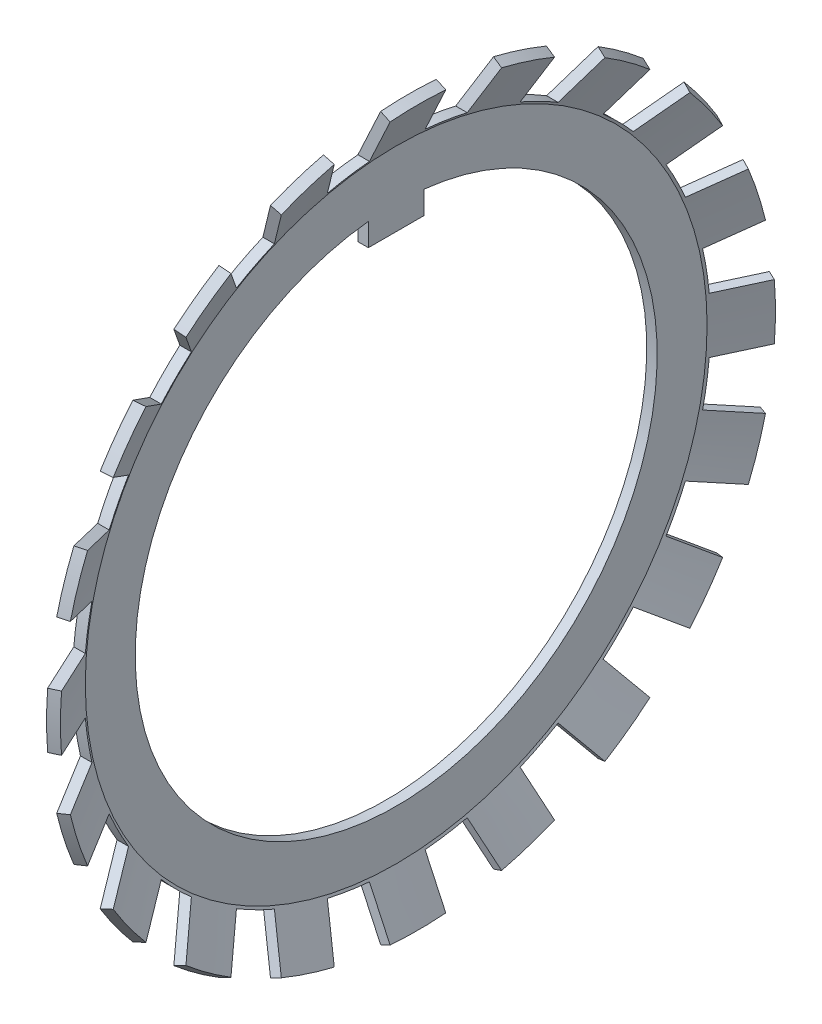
ISO-10303-21;
HEADER;
FILE_DESCRIPTION(('STEP AP214'),'2;1');
FILE_NAME('part.step','',(''),(''),'','','');
FILE_SCHEMA(('AUTOMOTIVE_DESIGN { 1 0 10303 214 1 1 1 1 }'));
ENDSEC;
DATA;
#1=APPLICATION_CONTEXT('core data for automotive mechanical design processes');
#2=APPLICATION_PROTOCOL_DEFINITION('international standard','automotive_design',2000,#1);
#3=PRODUCT_CONTEXT('',#1,'mechanical');
#4=PRODUCT('Part','Part','',(#3));
#5=PRODUCT_RELATED_PRODUCT_CATEGORY('part','',(#4));
#6=PRODUCT_DEFINITION_FORMATION('','',#4);
#7=PRODUCT_DEFINITION_CONTEXT('part definition',#1,'design');
#8=PRODUCT_DEFINITION('design','',#6,#7);
#9=PRODUCT_DEFINITION_SHAPE('','',#8);
#10=(LENGTH_UNIT() NAMED_UNIT(*) SI_UNIT(.MILLI.,.METRE.));
#11=(NAMED_UNIT(*) PLANE_ANGLE_UNIT() SI_UNIT($,.RADIAN.));
#12=(NAMED_UNIT(*) SI_UNIT($,.STERADIAN.) SOLID_ANGLE_UNIT());
#13=UNCERTAINTY_MEASURE_WITH_UNIT(LENGTH_MEASURE(1.E-05),#10,'distance_accuracy_value','');
#14=(GEOMETRIC_REPRESENTATION_CONTEXT(3) GLOBAL_UNCERTAINTY_ASSIGNED_CONTEXT((#13)) GLOBAL_UNIT_ASSIGNED_CONTEXT((#10,
#11,#12)) REPRESENTATION_CONTEXT('',''));
#15=CARTESIAN_POINT('',(0.,0.,0.));
#16=DIRECTION('',(0.,0.,1.));
#17=DIRECTION('',(1.,0.,0.));
#18=AXIS2_PLACEMENT_3D('',#15,#16,#17);
#19=CARTESIAN_POINT('',(3.264153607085,0.,0.));
#20=DIRECTION('',(1.,0.,0.));
#21=DIRECTION('',(0.,0.,-1.));
#22=AXIS2_PLACEMENT_3D('',#19,#20,#21);
#23=CONICAL_SURFACE('',#22,52.,1.13446401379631);
#24=CARTESIAN_POINT('',(0.,0.,0.));
#25=DIRECTION('',(-1.,0.,0.));
#26=DIRECTION('',(0.,0.,1.));
#27=AXIS2_PLACEMENT_3D('',#24,#25,#26);
#28=CIRCLE('',#27,45.);
#29=CARTESIAN_POINT('',(0.,-3.99999999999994,44.8218696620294));
#30=VERTEX_POINT('',#29);
#31=CARTESIAN_POINT('',(0.,4.,44.82186966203));
#32=VERTEX_POINT('',#31);
#33=EDGE_CURVE('E581',#30,#32,#28,.T.);
#34=ORIENTED_EDGE('',*,*,#33,.F.);
#35=CARTESIAN_POINT('',(-6.02088857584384,-4.,31.8378735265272));
#36=CARTESIAN_POINT('',(-5.4801749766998,-4.,33.0065250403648));
#37=CARTESIAN_POINT('',(-4.93910321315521,-4.,34.1750107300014));
#38=CARTESIAN_POINT('',(-3.85639534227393,-4.,36.5117205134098));
#39=CARTESIAN_POINT('',(-3.31475923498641,-4.,37.6799446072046));
#40=CARTESIAN_POINT('',(-1.68923249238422,-4.,41.1843293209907));
#41=CARTESIAN_POINT('',(-0.60472317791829,-4.,43.5202029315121));
#42=CARTESIAN_POINT('',(1.5652924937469,-4.,48.1914863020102));
#43=CARTESIAN_POINT('',(2.65079885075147,-4.,50.5268960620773));
#44=CARTESIAN_POINT('',(4.82249737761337,-4.,55.1973973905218));
#45=CARTESIAN_POINT('',(5.90868954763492,-4.,57.5324889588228));
#46=CARTESIAN_POINT('',(6.99506864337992,-4.,59.8674934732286));
#47=B_SPLINE_CURVE_WITH_KNOTS('',3,(#35,#36,#37,#38,#39,#40,#41,#42,#43,#44,#45,#46),
.UNSPECIFIED.,.F.,.F.,(4,2,2,2,2,4),(0.,3.86303720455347,7.72607407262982,15.4521459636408,
23.1782163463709,30.9042885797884),.UNSPECIFIED.);
#48=CARTESIAN_POINT('',(3.26415360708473,-4.,51.845925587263));
#49=VERTEX_POINT('',#48);
#50=EDGE_CURVE('E556',#30,#49,#47,.T.);
#51=ORIENTED_EDGE('',*,*,#50,.T.);
#52=CARTESIAN_POINT('',(3.264153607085,0.,0.));
#53=DIRECTION('',(-1.,0.,0.));
#54=DIRECTION('',(0.,0.,1.));
#55=AXIS2_PLACEMENT_3D('',#52,#53,#54);
#56=CIRCLE('',#55,52.);
#57=CARTESIAN_POINT('',(3.26415360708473,4.,51.845925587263));
#58=VERTEX_POINT('',#57);
#59=EDGE_CURVE('E1398',#49,#58,#56,.T.);
#60=ORIENTED_EDGE('',*,*,#59,.T.);
#61=CARTESIAN_POINT('',(6.99506864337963,4.,59.8674934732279));
#62=CARTESIAN_POINT('',(5.90868954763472,4.,57.5324889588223));
#63=CARTESIAN_POINT('',(4.82249737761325,4.,55.1973973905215));
#64=CARTESIAN_POINT('',(2.65079885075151,4.,50.5268960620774));
#65=CARTESIAN_POINT('',(1.56529249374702,4.,48.1914863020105));
#66=CARTESIAN_POINT('',(-0.604723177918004,4.,43.5202029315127));
#67=CARTESIAN_POINT('',(-1.68923249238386,4.,41.1843293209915));
#68=CARTESIAN_POINT('',(-3.31475923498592,4.,37.6799446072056));
#69=CARTESIAN_POINT('',(-3.85639534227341,4.,36.511720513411));
#70=CARTESIAN_POINT('',(-4.9391032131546,4.,34.1750107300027));
#71=CARTESIAN_POINT('',(-5.48017497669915,4.,33.0065250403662));
#72=CARTESIAN_POINT('',(-6.02088857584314,4.,31.8378735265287));
#73=B_SPLINE_CURVE_WITH_KNOTS('',3,(#61,#62,#63,#64,#65,#66,#67,#68,#69,#70,#71,#72),
.UNSPECIFIED.,.F.,.F.,(4,2,2,2,2,4),(0.,7.72607223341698,15.4521426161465,23.1782145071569,
27.0412513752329,30.9042885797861),.UNSPECIFIED.);
#74=EDGE_CURVE('E582',#58,#32,#73,.T.);
#75=ORIENTED_EDGE('',*,*,#74,.T.);
#76=EDGE_LOOP('',(#34,#51,#60,#75));
#77=FACE_BOUND('',#76,.T.);
#78=ADVANCED_FACE('F30',(#77),#23,.T.);
#79=CARTESIAN_POINT('',(3.26415360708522,-19.825498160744,48.07233739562));
#80=VERTEX_POINT('',#79);
#81=CARTESIAN_POINT('',(3.26415360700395,-12.2170460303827,50.5444733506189));
#82=VERTEX_POINT('',#81);
#83=EDGE_CURVE('E1394',#80,#82,#56,.T.);
#84=ORIENTED_EDGE('',*,*,#83,.T.);
#85=CARTESIAN_POINT('',(3.26425137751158,-12.2171110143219,50.5446733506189));
#86=CARTESIAN_POINT('',(2.71997088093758,-11.8553625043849,49.4313259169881));
#87=CARTESIAN_POINT('',(2.17580154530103,-11.4935980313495,48.3179293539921));
#88=CARTESIAN_POINT('',(1.08768519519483,-10.7700371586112,46.091037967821));
#89=CARTESIAN_POINT('',(0.543738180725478,-10.4082407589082,44.9775431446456));
#90=CARTESIAN_POINT('',(-9.76728061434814E-05,-10.0464283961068,43.863999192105));
#91=B_SPLINE_CURVE_WITH_KNOTS('',3,(#85,#86,#87,#88,#89,#90),.UNSPECIFIED.,.F.,.F.,(4,2,4),(0.,
3.87295899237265,7.7459179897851),.UNSPECIFIED.);
#92=CARTESIAN_POINT('',(0.,-10.046493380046,43.864199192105));
#93=VERTEX_POINT('',#92);
#94=EDGE_CURVE('E1084',#82,#93,#91,.T.);
#95=ORIENTED_EDGE('',*,*,#94,.T.);
#96=CARTESIAN_POINT('',(0.,-17.6549455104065,41.3920632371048));
#97=VERTEX_POINT('',#96);
#98=EDGE_CURVE('E585',#97,#93,#28,.T.);
#99=ORIENTED_EDGE('',*,*,#98,.F.);
#100=CARTESIAN_POINT('',(-9.76728064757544E-05,-17.6548805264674,41.3918632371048));
#101=CARTESIAN_POINT('',(0.54373818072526,-18.0166928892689,42.5054071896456));
#102=CARTESIAN_POINT('',(1.08768519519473,-18.3784892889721,43.6189020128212));
#103=CARTESIAN_POINT('',(2.17580154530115,-19.1020501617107,45.8457933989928));
#104=CARTESIAN_POINT('',(2.71997088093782,-19.4638146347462,46.959189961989));
#105=CARTESIAN_POINT('',(3.26425137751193,-19.8255631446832,48.07253739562));
#106=B_SPLINE_CURVE_WITH_KNOTS('',3,(#100,#101,#102,#103,#104,#105),.UNSPECIFIED.,.F.,.F.,(4,2,
4),(0.,3.87295899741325,7.74591798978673),.UNSPECIFIED.);
#107=EDGE_CURVE('E1085',#97,#80,#106,.T.);
#108=ORIENTED_EDGE('',*,*,#107,.T.);
#109=EDGE_LOOP('',(#84,#95,#99,#108));
#110=FACE_BOUND('',#109,.T.);
#111=ADVANCED_FACE('F1380',(#110),#23,.T.);
#112=CARTESIAN_POINT('',(3.26415360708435,-33.710338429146,39.593093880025));
#113=VERTEX_POINT('',#112);
#114=CARTESIAN_POINT('',(3.26415360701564,-27.2382024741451,44.2953758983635));
#115=VERTEX_POINT('',#114);
#116=EDGE_CURVE('E1397',#113,#115,#56,.T.);
#117=ORIENTED_EDGE('',*,*,#116,.T.);
#118=CARTESIAN_POINT('',(3.26426854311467,-27.2383477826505,44.2955758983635));
#119=CARTESIAN_POINT('',(2.719982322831,-26.5502539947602,43.3484960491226));
#120=CARTESIAN_POINT('',(2.17580726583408,-25.8621298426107,42.4013744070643));
#121=CARTESIAN_POINT('',(1.08767947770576,-24.4858208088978,40.5070475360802));
#122=CARTESIAN_POINT('',(0.54372674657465,-23.7976359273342,39.5598423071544));
#123=CARTESIAN_POINT('',(-0.000114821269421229,-23.1094206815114,38.612595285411));
#124=B_SPLINE_CURVE_WITH_KNOTS('',3,(#118,#119,#120,#121,#122,#123),.UNSPECIFIED.,.F.,.F.,(4,2,
4),(0.,3.87299970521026,7.74599941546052),.UNSPECIFIED.);
#125=CARTESIAN_POINT('',(0.,-23.109565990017,38.612795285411));
#126=VERTEX_POINT('',#125);
#127=EDGE_CURVE('E1352',#115,#126,#124,.T.);
#128=ORIENTED_EDGE('',*,*,#127,.T.);
#129=CARTESIAN_POINT('',(0.,-29.5817019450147,33.9105132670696));
#130=VERTEX_POINT('',#129);
#131=EDGE_CURVE('E2185',#130,#126,#28,.T.);
#132=ORIENTED_EDGE('',*,*,#131,.F.);
#133=CARTESIAN_POINT('',(-0.000114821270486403,-29.5815566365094,33.9103132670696));
#134=CARTESIAN_POINT('',(0.543726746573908,-30.2697718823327,34.8575602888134));
#135=CARTESIAN_POINT('',(1.08767947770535,-30.9579567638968,35.8047655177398));
#136=CARTESIAN_POINT('',(2.17580726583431,-32.3342657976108,37.6990923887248));
#137=CARTESIAN_POINT('',(2.71998232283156,-33.0223899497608,38.6462140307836));
#138=CARTESIAN_POINT('',(3.26426854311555,-33.7104837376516,39.593293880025));
#139=B_SPLINE_CURVE_WITH_KNOTS('',3,(#133,#134,#135,#136,#137,#138),.UNSPECIFIED.,.F.,.F.,(4,2,
4),(0.,3.87299971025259,7.74599941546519),.UNSPECIFIED.);
#140=EDGE_CURVE('E1345',#130,#113,#139,.T.);
#141=ORIENTED_EDGE('',*,*,#140,.T.);
#142=EDGE_LOOP('',(#117,#128,#132,#141));
#143=FACE_BOUND('',#142,.T.);
#144=ADVANCED_FACE('F1384',(#143),#23,.T.);
#145=CARTESIAN_POINT('',(3.26415360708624,-44.295375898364,27.238202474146));
#146=VERTEX_POINT('',#145);
#147=CARTESIAN_POINT('',(3.26415360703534,-39.5930938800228,33.7103384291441));
#148=VERTEX_POINT('',#147);
#149=EDGE_CURVE('E1400',#146,#148,#56,.T.);
#150=ORIENTED_EDGE('',*,*,#149,.T.);
#151=CARTESIAN_POINT('',(3.26426854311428,-39.5932938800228,33.71048373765));
#152=CARTESIAN_POINT('',(2.71998232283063,-38.646214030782,33.0223899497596));
#153=CARTESIAN_POINT('',(2.17580726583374,-37.6990923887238,32.3342657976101));
#154=CARTESIAN_POINT('',(1.08767947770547,-35.80476551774,30.9579567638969));
#155=CARTESIAN_POINT('',(0.543726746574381,-34.8575602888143,30.2697718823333));
#156=CARTESIAN_POINT('',(-0.000114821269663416,-33.910313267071,29.5815566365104));
#157=B_SPLINE_CURVE_WITH_KNOTS('',3,(#151,#152,#153,#154,#155,#156),.UNSPECIFIED.,.F.,.F.,(4,2,
4),(0.,3.8729997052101,7.7459994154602),.UNSPECIFIED.);
#158=CARTESIAN_POINT('',(0.,-33.910513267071,29.581701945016));
#159=VERTEX_POINT('',#158);
#160=EDGE_CURVE('E1338',#148,#159,#157,.T.);
#161=ORIENTED_EDGE('',*,*,#160,.T.);
#162=CARTESIAN_POINT('',(0.,-38.612795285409,23.1095659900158));
#163=VERTEX_POINT('',#162);
#164=EDGE_CURVE('E2187',#163,#159,#28,.T.);
#165=ORIENTED_EDGE('',*,*,#164,.F.);
#166=CARTESIAN_POINT('',(-0.000114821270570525,-38.612595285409,23.1094206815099));
#167=CARTESIAN_POINT('',(0.543726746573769,-39.5598423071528,23.7976359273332));
#168=CARTESIAN_POINT('',(1.08767947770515,-40.5070475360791,24.4858208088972));
#169=CARTESIAN_POINT('',(2.17580726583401,-42.4013744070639,25.862129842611));
#170=CARTESIAN_POINT('',(2.7199823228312,-43.3484960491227,26.5502539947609));
#171=CARTESIAN_POINT('',(3.26426854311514,-44.295575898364,27.2383477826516));
#172=B_SPLINE_CURVE_WITH_KNOTS('',3,(#166,#167,#168,#169,#170,#171),.UNSPECIFIED.,.F.,.F.,(4,2,
4),(0.,3.87299971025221,7.74599941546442),.UNSPECIFIED.);
#173=EDGE_CURVE('E1331',#163,#146,#172,.T.);
#174=ORIENTED_EDGE('',*,*,#173,.T.);
#175=EDGE_LOOP('',(#150,#161,#165,#174));
#176=FACE_BOUND('',#175,.T.);
#177=ADVANCED_FACE('F1389',(#176),#23,.T.);
#178=CARTESIAN_POINT('',(3.26415360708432,-50.54447335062,12.217046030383));
#179=VERTEX_POINT('',#178);
#180=CARTESIAN_POINT('',(3.26415360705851,-48.0723373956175,19.825498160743));
#181=VERTEX_POINT('',#180);
#182=EDGE_CURVE('E2235',#179,#181,#56,.T.);
#183=ORIENTED_EDGE('',*,*,#182,.T.);
#184=CARTESIAN_POINT('',(3.2642513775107,-48.0725373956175,19.8255631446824));
#185=CARTESIAN_POINT('',(2.71997088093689,-46.9591899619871,19.4638146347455));
#186=CARTESIAN_POINT('',(2.17580154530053,-45.8457933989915,19.1020501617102));
#187=CARTESIAN_POINT('',(1.08768519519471,-43.6189020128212,18.3784892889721));
#188=CARTESIAN_POINT('',(0.543738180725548,-42.5054071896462,18.0166928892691));
#189=CARTESIAN_POINT('',(-9.76728058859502E-05,-41.391863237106,17.6548805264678));
#190=B_SPLINE_CURVE_WITH_KNOTS('',3,(#184,#185,#186,#187,#188,#189),.UNSPECIFIED.,.F.,.F.,(4,2,
4),(0.,3.87295899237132,7.74591798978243),.UNSPECIFIED.);
#191=CARTESIAN_POINT('',(0.,-41.392063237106,17.654945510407));
#192=VERTEX_POINT('',#191);
#193=EDGE_CURVE('E1324',#181,#192,#190,.T.);
#194=ORIENTED_EDGE('',*,*,#193,.T.);
#195=CARTESIAN_POINT('',(0.,-43.8641991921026,10.0464933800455));
#196=VERTEX_POINT('',#195);
#197=EDGE_CURVE('E2188',#196,#192,#28,.T.);
#198=ORIENTED_EDGE('',*,*,#197,.F.);
#199=CARTESIAN_POINT('',(-9.76728073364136E-05,-43.8639991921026,10.046428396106));
#200=CARTESIAN_POINT('',(0.543738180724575,-44.9775431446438,10.4082407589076));
#201=CARTESIAN_POINT('',(1.08768519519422,-46.0910379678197,10.7700371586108));
#202=CARTESIAN_POINT('',(2.17580154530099,-48.3179293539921,11.4935980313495));
#203=CARTESIAN_POINT('',(2.71997088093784,-49.4313259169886,11.8553625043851));
#204=CARTESIAN_POINT('',(3.26425137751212,-50.54467335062,12.2171110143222));
#205=B_SPLINE_CURVE_WITH_KNOTS('',3,(#199,#200,#201,#202,#203,#204),.UNSPECIFIED.,.F.,.F.,(4,2,
4),(0.,3.8729589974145,7.74591798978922),.UNSPECIFIED.);
#206=EDGE_CURVE('E1317',#196,#179,#205,.T.);
#207=ORIENTED_EDGE('',*,*,#206,.T.);
#208=EDGE_LOOP('',(#183,#194,#198,#207));
#209=FACE_BOUND('',#208,.T.);
#210=ADVANCED_FACE('F2365',(#209),#23,.T.);
#211=CARTESIAN_POINT('',(3.26415360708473,-51.845925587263,-4.));
#212=VERTEX_POINT('',#211);
#213=CARTESIAN_POINT('',(3.26415360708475,-51.8459255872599,3.99999999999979));
#214=VERTEX_POINT('',#213);
#215=EDGE_CURVE('E2234',#212,#214,#56,.T.);
#216=ORIENTED_EDGE('',*,*,#215,.T.);
#217=CARTESIAN_POINT('',(9.30085761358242,-64.8224567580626,4.));
#218=CARTESIAN_POINT('',(8.21417816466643,-62.4875922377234,4.));
#219=CARTESIAN_POINT('',(7.12765254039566,-60.1526560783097,4.));
#220=CARTESIAN_POINT('',(4.95512443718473,-55.482540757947,4.));
#221=CARTESIAN_POINT('',(3.86912195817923,-53.1473615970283,4.));
#222=CARTESIAN_POINT('',(1.69785526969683,-48.4766597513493,4.));
#223=CARTESIAN_POINT('',(0.612591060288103,-46.1411370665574,4.));
#224=CARTESIAN_POINT('',(-1.01443586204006,-42.6374491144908,4.));
#225=CARTESIAN_POINT('',(-1.55663330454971,-41.4694857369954,4.));
#226=CARTESIAN_POINT('',(-2.64064710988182,-39.1333821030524,4.));
#227=CARTESIAN_POINT('',(-3.1824634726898,-37.9652418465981,4.));
#228=CARTESIAN_POINT('',(-3.7240436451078,-36.7969920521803,4.));
#229=B_SPLINE_CURVE_WITH_KNOTS('',3,(#217,#218,#219,#220,#221,#222,#223,#224,#225,#226,#227,
#228),.UNSPECIFIED.,.F.,.F.,(4,2,2,2,2,4),(0.,7.72607156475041,15.4521421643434,
23.1782134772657,27.0412496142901,30.904285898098),.UNSPECIFIED.);
#230=CARTESIAN_POINT('',(0.,-44.82186966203,4.));
#231=VERTEX_POINT('',#230);
#232=EDGE_CURVE('E1310',#214,#231,#229,.T.);
#233=ORIENTED_EDGE('',*,*,#232,.T.);
#234=CARTESIAN_POINT('',(0.,-44.8218696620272,-3.99999999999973));
#235=VERTEX_POINT('',#234);
#236=EDGE_CURVE('E2190',#235,#231,#28,.T.);
#237=ORIENTED_EDGE('',*,*,#236,.F.);
#238=CARTESIAN_POINT('',(-3.7240436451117,-36.7969920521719,-4.));
#239=CARTESIAN_POINT('',(-3.18246347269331,-37.9652418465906,-4.));
#240=CARTESIAN_POINT('',(-2.64064710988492,-39.1333821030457,-4.));
#241=CARTESIAN_POINT('',(-1.55663330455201,-41.4694857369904,-4.));
#242=CARTESIAN_POINT('',(-1.01443586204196,-42.6374491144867,-4.));
#243=CARTESIAN_POINT('',(0.612591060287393,-46.1411370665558,-4.));
#244=CARTESIAN_POINT('',(1.69785526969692,-48.4766597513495,-4.));
#245=CARTESIAN_POINT('',(3.86912195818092,-53.1473615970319,-4.));
#246=CARTESIAN_POINT('',(4.95512443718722,-55.4825407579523,-4.));
#247=CARTESIAN_POINT('',(7.12765254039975,-60.1526560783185,-4.));
#248=CARTESIAN_POINT('',(8.21417816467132,-62.4875922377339,-4.));
#249=CARTESIAN_POINT('',(9.30085761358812,-64.8224567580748,-4.));
#250=B_SPLINE_CURVE_WITH_KNOTS('',3,(#238,#239,#240,#241,#242,#243,#244,#245,#246,#247,#248,
#249),.UNSPECIFIED.,.F.,.F.,(4,2,2,2,2,4),(0.,3.86303628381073,7.72607242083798,15.452143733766,
23.1782143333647,30.9042858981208),.UNSPECIFIED.);
#251=EDGE_CURVE('E1303',#235,#212,#250,.T.);
#252=ORIENTED_EDGE('',*,*,#251,.T.);
#253=EDGE_LOOP('',(#216,#233,#237,#252));
#254=FACE_BOUND('',#253,.T.);
#255=ADVANCED_FACE('F2357',(#254),#23,.T.);
#256=CARTESIAN_POINT('',(3.26415360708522,-48.07233739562,-19.825498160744));
#257=VERTEX_POINT('',#256);
#258=CARTESIAN_POINT('',(3.26415360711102,-50.544473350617,-12.2170460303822));
#259=VERTEX_POINT('',#258);
#260=EDGE_CURVE('E2233',#257,#259,#56,.T.);
#261=ORIENTED_EDGE('',*,*,#260,.T.);
#262=CARTESIAN_POINT('',(3.26425137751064,-50.544673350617,-12.2171110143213));
#263=CARTESIAN_POINT('',(2.7199708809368,-49.4313259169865,-11.8553625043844));
#264=CARTESIAN_POINT('',(2.1758015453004,-48.3179293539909,-11.4935980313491));
#265=CARTESIAN_POINT('',(1.08768519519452,-46.0910379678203,-10.770037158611));
#266=CARTESIAN_POINT('',(0.543738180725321,-44.9775431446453,-10.4082407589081));
#267=CARTESIAN_POINT('',(-9.76728061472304E-05,-43.863999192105,-10.0464283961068));
#268=B_SPLINE_CURVE_WITH_KNOTS('',3,(#262,#263,#264,#265,#266,#267),.UNSPECIFIED.,.F.,.F.,(4,2,
4),(0.,3.87295899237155,7.74591798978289),.UNSPECIFIED.);
#269=CARTESIAN_POINT('',(0.,-43.864199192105,-10.046493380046));
#270=VERTEX_POINT('',#269);
#271=EDGE_CURVE('E1296',#259,#270,#268,.T.);
#272=ORIENTED_EDGE('',*,*,#271,.T.);
#273=CARTESIAN_POINT('',(0.,-41.3920632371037,-17.654945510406));
#274=VERTEX_POINT('',#273);
#275=EDGE_CURVE('E2192',#274,#270,#28,.T.);
#276=ORIENTED_EDGE('',*,*,#275,.F.);
#277=CARTESIAN_POINT('',(-9.76728070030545E-05,-41.3918632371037,-17.654880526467));
#278=CARTESIAN_POINT('',(0.543738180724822,-42.5054071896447,-18.0166928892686));
#279=CARTESIAN_POINT('',(1.08768519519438,-43.6189020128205,-18.3784892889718));
#280=CARTESIAN_POINT('',(2.17580154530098,-45.8457933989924,-19.1020501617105));
#281=CARTESIAN_POINT('',(2.71997088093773,-46.9591899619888,-19.4638146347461));
#282=CARTESIAN_POINT('',(3.26425137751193,-48.07253739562,-19.8255631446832));
#283=B_SPLINE_CURVE_WITH_KNOTS('',3,(#277,#278,#279,#280,#281,#282),.UNSPECIFIED.,.F.,.F.,(4,2,
4),(0.,3.87295899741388,7.74591798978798),.UNSPECIFIED.);
#284=EDGE_CURVE('E1289',#274,#257,#283,.T.);
#285=ORIENTED_EDGE('',*,*,#284,.T.);
#286=EDGE_LOOP('',(#261,#272,#276,#285));
#287=FACE_BOUND('',#286,.T.);
#288=ADVANCED_FACE('F2349',(#287),#23,.T.);
#289=CARTESIAN_POINT('',(3.26415360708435,-39.593093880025,-33.710338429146));
#290=VERTEX_POINT('',#289);
#291=CARTESIAN_POINT('',(3.26415360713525,-44.2953758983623,-27.2382024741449));
#292=VERTEX_POINT('',#291);
#293=EDGE_CURVE('E2232',#290,#292,#56,.T.);
#294=ORIENTED_EDGE('',*,*,#293,.T.);
#295=CARTESIAN_POINT('',(3.26426854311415,-44.2955758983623,-27.2383477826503));
#296=CARTESIAN_POINT('',(2.71998232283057,-43.3484960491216,-26.5502539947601));
#297=CARTESIAN_POINT('',(2.17580726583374,-42.4013744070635,-25.8621298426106));
#298=CARTESIAN_POINT('',(1.08767947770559,-40.5070475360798,-24.4858208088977));
#299=CARTESIAN_POINT('',(0.543726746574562,-39.5598423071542,-23.7976359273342));
#300=CARTESIAN_POINT('',(-0.000114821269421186,-38.612595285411,-23.1094206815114));
#301=B_SPLINE_CURVE_WITH_KNOTS('',3,(#295,#296,#297,#298,#299,#300),.UNSPECIFIED.,.F.,.F.,(4,2,
4),(0.,3.87299970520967,7.74599941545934),.UNSPECIFIED.);
#302=CARTESIAN_POINT('',(0.,-38.612795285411,-23.109565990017));
#303=VERTEX_POINT('',#302);
#304=EDGE_CURVE('E1282',#292,#303,#301,.T.);
#305=ORIENTED_EDGE('',*,*,#304,.T.);
#306=CARTESIAN_POINT('',(0.,-33.9105132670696,-29.5817019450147));
#307=VERTEX_POINT('',#306);
#308=EDGE_CURVE('E2194',#307,#303,#28,.T.);
#309=ORIENTED_EDGE('',*,*,#308,.F.);
#310=CARTESIAN_POINT('',(-0.000114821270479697,-33.9103132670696,-29.5815566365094));
#311=CARTESIAN_POINT('',(0.543726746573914,-34.8575602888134,-30.2697718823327));
#312=CARTESIAN_POINT('',(1.08767947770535,-35.8047655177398,-30.9579567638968));
#313=CARTESIAN_POINT('',(2.17580726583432,-37.6990923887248,-32.3342657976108));
#314=CARTESIAN_POINT('',(2.71998232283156,-38.6462140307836,-33.0223899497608));
#315=CARTESIAN_POINT('',(3.26426854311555,-39.593293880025,-33.7104837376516));
#316=B_SPLINE_CURVE_WITH_KNOTS('',3,(#310,#311,#312,#313,#314,#315),.UNSPECIFIED.,.F.,.F.,(4,2,
4),(0.,3.87299971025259,7.74599941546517),.UNSPECIFIED.);
#317=EDGE_CURVE('E1275',#307,#290,#316,.T.);
#318=ORIENTED_EDGE('',*,*,#317,.T.);
#319=EDGE_LOOP('',(#294,#305,#309,#318));
#320=FACE_BOUND('',#319,.T.);
#321=ADVANCED_FACE('F2341',(#320),#23,.T.);
#322=CARTESIAN_POINT('',(3.26415360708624,-27.238202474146,-44.295375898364));
#323=VERTEX_POINT('',#322);
#324=CARTESIAN_POINT('',(3.26415360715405,-33.7103384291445,-39.5930938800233));
#325=VERTEX_POINT('',#324);
#326=EDGE_CURVE('E2231',#323,#325,#56,.T.);
#327=ORIENTED_EDGE('',*,*,#326,.T.);
#328=CARTESIAN_POINT('',(3.26426854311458,-33.7104837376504,-39.5932938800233));
#329=CARTESIAN_POINT('',(2.71998232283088,-33.0223899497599,-38.6462140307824));
#330=CARTESIAN_POINT('',(2.17580726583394,-32.3342657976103,-37.6990923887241));
#331=CARTESIAN_POINT('',(1.08767947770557,-30.9579567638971,-35.8047655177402));
#332=CARTESIAN_POINT('',(0.543726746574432,-30.2697718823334,-34.8575602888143));
#333=CARTESIAN_POINT('',(-0.000114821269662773,-29.5815566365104,-33.910313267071));
#334=B_SPLINE_CURVE_WITH_KNOTS('',3,(#328,#329,#330,#331,#332,#333),.UNSPECIFIED.,.F.,.F.,(4,2,
4),(0.,3.87299970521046,7.74599941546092),.UNSPECIFIED.);
#335=CARTESIAN_POINT('',(0.,-29.581701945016,-33.910513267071));
#336=VERTEX_POINT('',#335);
#337=EDGE_CURVE('E1268',#325,#336,#334,.T.);
#338=ORIENTED_EDGE('',*,*,#337,.T.);
#339=CARTESIAN_POINT('',(0.,-23.1095659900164,-38.61279528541));
#340=VERTEX_POINT('',#339);
#341=EDGE_CURVE('E2196',#340,#336,#28,.T.);
#342=ORIENTED_EDGE('',*,*,#341,.F.);
#343=CARTESIAN_POINT('',(-0.000114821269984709,-23.1094206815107,-38.61259528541));
#344=CARTESIAN_POINT('',(0.543726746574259,-23.7976359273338,-39.5598423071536));
#345=CARTESIAN_POINT('',(1.08767947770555,-24.4858208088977,-40.5070475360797));
#346=CARTESIAN_POINT('',(2.17580726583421,-25.8621298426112,-42.4013744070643));
#347=CARTESIAN_POINT('',(2.7199823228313,-26.550253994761,-43.3484960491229));
#348=CARTESIAN_POINT('',(3.26426854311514,-27.2383477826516,-44.295575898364));
#349=B_SPLINE_CURVE_WITH_KNOTS('',3,(#343,#344,#345,#346,#347,#348),.UNSPECIFIED.,.F.,.F.,(4,2,
4),(0.,3.87299971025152,7.74599941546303),.UNSPECIFIED.);
#350=EDGE_CURVE('E1261',#340,#323,#349,.T.);
#351=ORIENTED_EDGE('',*,*,#350,.T.);
#352=EDGE_LOOP('',(#327,#338,#342,#351));
#353=FACE_BOUND('',#352,.T.);
#354=ADVANCED_FACE('F2333',(#353),#23,.T.);
#355=CARTESIAN_POINT('',(3.26415360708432,-12.217046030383,-50.54447335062));
#356=VERTEX_POINT('',#355);
#357=CARTESIAN_POINT('',(3.2641536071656,-19.8254981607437,-48.0723373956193));
#358=VERTEX_POINT('',#357);
#359=EDGE_CURVE('E2230',#356,#358,#56,.T.);
#360=ORIENTED_EDGE('',*,*,#359,.T.);
#361=CARTESIAN_POINT('',(3.26425137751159,-19.825563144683,-48.0725373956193));
#362=CARTESIAN_POINT('',(2.71997088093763,-19.463814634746,-46.9591899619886));
#363=CARTESIAN_POINT('',(2.17580154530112,-19.1020501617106,-45.8457933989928));
#364=CARTESIAN_POINT('',(1.08768519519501,-18.3784892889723,-43.6189020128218));
#365=CARTESIAN_POINT('',(0.543738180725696,-18.0166928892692,-42.5054071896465));
#366=CARTESIAN_POINT('',(-9.76728058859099E-05,-17.6548805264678,-41.391863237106));
#367=B_SPLINE_CURVE_WITH_KNOTS('',3,(#361,#362,#363,#364,#365,#366),.UNSPECIFIED.,.F.,.F.,(4,2,
4),(0.,3.87295899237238,7.74591798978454),.UNSPECIFIED.);
#368=CARTESIAN_POINT('',(0.,-17.654945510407,-41.392063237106));
#369=VERTEX_POINT('',#368);
#370=EDGE_CURVE('E1254',#358,#369,#367,.T.);
#371=ORIENTED_EDGE('',*,*,#370,.T.);
#372=CARTESIAN_POINT('',(0.,-10.046493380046,-43.8641991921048));
#373=VERTEX_POINT('',#372);
#374=EDGE_CURVE('E2198',#373,#369,#28,.T.);
#375=ORIENTED_EDGE('',*,*,#374,.F.);
#376=CARTESIAN_POINT('',(-9.76728062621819E-05,-10.0464283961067,-43.8639991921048));
#377=CARTESIAN_POINT('',(0.543738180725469,-10.4082407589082,-44.9775431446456));
#378=CARTESIAN_POINT('',(1.08768519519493,-10.7700371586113,-46.0910379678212));
#379=CARTESIAN_POINT('',(2.17580154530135,-11.4935980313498,-48.3179293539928));
#380=CARTESIAN_POINT('',(2.71997088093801,-11.8553625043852,-49.431325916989));
#381=CARTESIAN_POINT('',(3.26425137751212,-12.2171110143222,-50.54467335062));
#382=B_SPLINE_CURVE_WITH_KNOTS('',3,(#376,#377,#378,#379,#380,#381),.UNSPECIFIED.,.F.,.F.,(4,2,
4),(0.,3.87295899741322,7.74591798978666),.UNSPECIFIED.);
#383=EDGE_CURVE('E1247',#373,#356,#382,.T.);
#384=ORIENTED_EDGE('',*,*,#383,.T.);
#385=EDGE_LOOP('',(#360,#371,#375,#384));
#386=FACE_BOUND('',#385,.T.);
#387=ADVANCED_FACE('F2325',(#386),#23,.T.);
#388=CARTESIAN_POINT('',(3.26415360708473,4.,-51.845925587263));
#389=VERTEX_POINT('',#388);
#390=CARTESIAN_POINT('',(3.26415360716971,-4.00000000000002,-51.845925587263));
#391=VERTEX_POINT('',#390);
#392=EDGE_CURVE('E2229',#389,#391,#56,.T.);
#393=ORIENTED_EDGE('',*,*,#392,.T.);
#394=CARTESIAN_POINT('',(9.30085761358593,-4.,-64.8224567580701));
#395=CARTESIAN_POINT('',(8.21417816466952,-4.,-62.4875922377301));
#396=CARTESIAN_POINT('',(7.12765254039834,-4.,-60.1526560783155));
#397=CARTESIAN_POINT('',(4.95512443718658,-4.,-55.4825407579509));
#398=CARTESIAN_POINT('',(3.86912195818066,-4.,-53.1473615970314));
#399=CARTESIAN_POINT('',(1.69785526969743,-4.,-48.4766597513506));
#400=CARTESIAN_POINT('',(0.612591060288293,-4.,-46.1411370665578));
#401=CARTESIAN_POINT('',(-1.01443586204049,-4.,-42.6374491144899));
#402=CARTESIAN_POINT('',(-1.55663330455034,-4.,-41.469485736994));
#403=CARTESIAN_POINT('',(-2.64064710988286,-4.,-39.1333821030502));
#404=CARTESIAN_POINT('',(-3.18246347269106,-4.,-37.9652418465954));
#405=CARTESIAN_POINT('',(-3.72404364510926,-4.,-36.7969920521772));
#406=B_SPLINE_CURVE_WITH_KNOTS('',3,(#394,#395,#396,#397,#398,#399,#400,#401,#402,#403,#404,
#405),.UNSPECIFIED.,.F.,.F.,(4,2,2,2,2,4),(0.,7.72607156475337,15.4521421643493,
23.1782134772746,27.0412496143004,30.9042858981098),.UNSPECIFIED.);
#407=CARTESIAN_POINT('',(0.,-4.,-44.82186966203));
#408=VERTEX_POINT('',#407);
#409=EDGE_CURVE('E1240',#391,#408,#406,.T.);
#410=ORIENTED_EDGE('',*,*,#409,.T.);
#411=CARTESIAN_POINT('',(0.,4.00000000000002,-44.8218696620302));
#412=VERTEX_POINT('',#411);
#413=EDGE_CURVE('E2200',#412,#408,#28,.T.);
#414=ORIENTED_EDGE('',*,*,#413,.F.);
#415=CARTESIAN_POINT('',(-3.72404364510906,4.,-36.7969920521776));
#416=CARTESIAN_POINT('',(-3.18246347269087,4.,-37.9652418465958));
#417=CARTESIAN_POINT('',(-2.6406471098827,4.,-39.1333821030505));
#418=CARTESIAN_POINT('',(-1.55663330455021,4.,-41.4694857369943));
#419=CARTESIAN_POINT('',(-1.01443586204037,4.,-42.6374491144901));
#420=CARTESIAN_POINT('',(0.612591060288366,4.,-46.1411370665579));
#421=CARTESIAN_POINT('',(1.69785526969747,4.,-48.4766597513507));
#422=CARTESIAN_POINT('',(3.86912195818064,4.,-53.1473615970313));
#423=CARTESIAN_POINT('',(4.95512443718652,4.,-55.4825407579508));
#424=CARTESIAN_POINT('',(7.12765254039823,4.,-60.1526560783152));
#425=CARTESIAN_POINT('',(8.21417816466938,4.,-62.4875922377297));
#426=CARTESIAN_POINT('',(9.30085761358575,4.,-64.8224567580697));
#427=B_SPLINE_CURVE_WITH_KNOTS('',3,(#415,#416,#417,#418,#419,#420,#421,#422,#423,#424,#425,
#426),.UNSPECIFIED.,.F.,.F.,(4,2,2,2,2,4),(0.,3.86303628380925,7.726072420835,15.45214373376,
23.1782143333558,30.9042858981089),.UNSPECIFIED.);
#428=EDGE_CURVE('E1233',#412,#389,#427,.T.);
#429=ORIENTED_EDGE('',*,*,#428,.T.);
#430=EDGE_LOOP('',(#393,#410,#414,#429));
#431=FACE_BOUND('',#430,.T.);
#432=ADVANCED_FACE('F2317',(#431),#23,.T.);
#433=CARTESIAN_POINT('',(3.26415360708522,19.825498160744,-48.07233739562));
#434=VERTEX_POINT('',#433);
#435=CARTESIAN_POINT('',(3.2641536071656,12.2170460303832,-50.5444733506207));
#436=VERTEX_POINT('',#435);
#437=EDGE_CURVE('E2228',#434,#436,#56,.T.);
#438=ORIENTED_EDGE('',*,*,#437,.T.);
#439=CARTESIAN_POINT('',(3.26425137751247,12.2171110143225,-50.5446733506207));
#440=CARTESIAN_POINT('',(2.71997088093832,11.8553625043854,-49.4313259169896));
#441=CARTESIAN_POINT('',(2.17580154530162,11.4935980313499,-48.3179293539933));
#442=CARTESIAN_POINT('',(1.08768519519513,10.7700371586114,-46.0910379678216));
#443=CARTESIAN_POINT('',(0.543738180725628,10.4082407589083,-44.9775431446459));
#444=CARTESIAN_POINT('',(-9.76728061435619E-05,10.0464283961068,-43.863999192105));
#445=B_SPLINE_CURVE_WITH_KNOTS('',3,(#439,#440,#441,#442,#443,#444),.UNSPECIFIED.,.F.,.F.,(4,2,
4),(0.,3.87295899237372,7.74591798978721),.UNSPECIFIED.);
#446=CARTESIAN_POINT('',(0.,10.046493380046,-43.864199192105));
#447=VERTEX_POINT('',#446);
#448=EDGE_CURVE('E1226',#436,#447,#445,.T.);
#449=ORIENTED_EDGE('',*,*,#448,.T.);
#450=CARTESIAN_POINT('',(0.,17.6549455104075,-41.3920632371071));
#451=VERTEX_POINT('',#450);
#452=EDGE_CURVE('E2202',#451,#447,#28,.T.);
#453=ORIENTED_EDGE('',*,*,#452,.F.);
#454=CARTESIAN_POINT('',(-9.76728053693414E-05,17.6548805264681,-41.3918632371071));
#455=CARTESIAN_POINT('',(0.543738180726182,18.0166928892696,-42.5054071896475));
#456=CARTESIAN_POINT('',(1.08768519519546,18.3784892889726,-43.6189020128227));
#457=CARTESIAN_POINT('',(2.17580154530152,19.1020501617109,-45.8457933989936));
#458=CARTESIAN_POINT('',(2.719970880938,19.4638146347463,-46.9591899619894));
#459=CARTESIAN_POINT('',(3.26425137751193,19.8255631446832,-48.07253739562));
#460=B_SPLINE_CURVE_WITH_KNOTS('',3,(#454,#455,#456,#457,#458,#459),.UNSPECIFIED.,.F.,.F.,(4,2,
4),(0.,3.87295899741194,7.7459179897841),.UNSPECIFIED.);
#461=EDGE_CURVE('E1219',#451,#434,#460,.T.);
#462=ORIENTED_EDGE('',*,*,#461,.T.);
#463=EDGE_LOOP('',(#438,#449,#453,#462));
#464=FACE_BOUND('',#463,.T.);
#465=ADVANCED_FACE('F2309',(#464),#23,.T.);
#466=CARTESIAN_POINT('',(3.26415360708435,33.710338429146,-39.593093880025));
#467=VERTEX_POINT('',#466);
#468=CARTESIAN_POINT('',(3.26415360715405,27.2382024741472,-44.2953758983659));
#469=VERTEX_POINT('',#468);
#470=EDGE_CURVE('E2227',#467,#469,#56,.T.);
#471=ORIENTED_EDGE('',*,*,#470,.T.);
#472=CARTESIAN_POINT('',(3.26426854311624,27.238347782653,-44.2955758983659));
#473=CARTESIAN_POINT('',(2.7199823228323,26.5502539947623,-43.3484960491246));
#474=CARTESIAN_POINT('',(2.17580726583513,25.8621298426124,-42.4013744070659));
#475=CARTESIAN_POINT('',(1.08767947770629,24.4858208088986,-40.507047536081));
#476=CARTESIAN_POINT('',(0.54372674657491,23.7976359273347,-39.5598423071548));
#477=CARTESIAN_POINT('',(-0.000114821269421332,23.1094206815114,-38.612595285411));
#478=B_SPLINE_CURVE_WITH_KNOTS('',3,(#472,#473,#474,#475,#476,#477),.UNSPECIFIED.,.F.,.F.,(4,2,
4),(0.,3.87299970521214,7.74599941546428),.UNSPECIFIED.);
#479=CARTESIAN_POINT('',(0.,23.109565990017,-38.612795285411));
#480=VERTEX_POINT('',#479);
#481=EDGE_CURVE('E1212',#469,#480,#478,.T.);
#482=ORIENTED_EDGE('',*,*,#481,.T.);
#483=CARTESIAN_POINT('',(0.,29.5817019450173,-33.9105132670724));
#484=VERTEX_POINT('',#483);
#485=EDGE_CURVE('E2204',#484,#480,#28,.T.);
#486=ORIENTED_EDGE('',*,*,#485,.F.);
#487=CARTESIAN_POINT('',(-0.000114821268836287,29.5815566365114,-33.9103132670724));
#488=CARTESIAN_POINT('',(0.543726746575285,30.2697718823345,-34.8575602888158));
#489=CARTESIAN_POINT('',(1.08767947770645,30.9579567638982,-35.8047655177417));
#490=CARTESIAN_POINT('',(2.17580726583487,32.3342657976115,-37.6990923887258));
#491=CARTESIAN_POINT('',(2.71998232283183,33.0223899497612,-38.6462140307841));
#492=CARTESIAN_POINT('',(3.26426854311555,33.7104837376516,-39.593293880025));
#493=B_SPLINE_CURVE_WITH_KNOTS('',3,(#487,#488,#489,#490,#491,#492),.UNSPECIFIED.,.F.,.F.,(4,2,
4),(0.,3.87299971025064,7.74599941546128),.UNSPECIFIED.);
#494=EDGE_CURVE('E1205',#484,#467,#493,.T.);
#495=ORIENTED_EDGE('',*,*,#494,.T.);
#496=EDGE_LOOP('',(#471,#482,#486,#495));
#497=FACE_BOUND('',#496,.T.);
#498=ADVANCED_FACE('F2301',(#497),#23,.T.);
#499=CARTESIAN_POINT('',(3.26415360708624,44.295375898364,-27.238202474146));
#500=VERTEX_POINT('',#499);
#501=CARTESIAN_POINT('',(3.26415360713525,39.5930938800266,-33.7103384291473));
#502=VERTEX_POINT('',#501);
#503=EDGE_CURVE('E2226',#500,#502,#56,.T.);
#504=ORIENTED_EDGE('',*,*,#503,.T.);
#505=CARTESIAN_POINT('',(3.26426854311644,39.5932938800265,-33.7104837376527));
#506=CARTESIAN_POINT('',(2.71998232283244,38.6462140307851,-33.0223899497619));
#507=CARTESIAN_POINT('',(2.17580726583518,37.6990923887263,-32.3342657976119));
#508=CARTESIAN_POINT('',(1.08767947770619,35.8047655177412,-30.9579567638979));
#509=CARTESIAN_POINT('',(0.543726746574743,34.8575602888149,-30.2697718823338));
#510=CARTESIAN_POINT('',(-0.000114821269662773,33.910313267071,-29.5815566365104));
#511=B_SPLINE_CURVE_WITH_KNOTS('',3,(#505,#506,#507,#508,#509,#510),.UNSPECIFIED.,.F.,.F.,(4,2,
4),(0.,3.87299970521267,7.74599941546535),.UNSPECIFIED.);
#512=CARTESIAN_POINT('',(0.,33.910513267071,-29.581701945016));
#513=VERTEX_POINT('',#512);
#514=EDGE_CURVE('E1198',#502,#513,#511,.T.);
#515=ORIENTED_EDGE('',*,*,#514,.T.);
#516=CARTESIAN_POINT('',(0.,38.6127952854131,-23.1095659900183));
#517=VERTEX_POINT('',#516);
#518=EDGE_CURVE('E2206',#517,#513,#28,.T.);
#519=ORIENTED_EDGE('',*,*,#518,.F.);
#520=CARTESIAN_POINT('',(-0.000114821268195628,38.6125952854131,-23.109420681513));
#521=CARTESIAN_POINT('',(0.54372674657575,39.5598423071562,-23.7976359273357));
#522=CARTESIAN_POINT('',(1.08767947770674,40.5070475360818,-24.4858208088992));
#523=CARTESIAN_POINT('',(2.17580726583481,42.4013744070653,-25.862129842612));
#524=CARTESIAN_POINT('',(2.7199823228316,43.3484960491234,-26.5502539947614));
#525=CARTESIAN_POINT('',(3.26426854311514,44.295575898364,-27.2383477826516));
#526=B_SPLINE_CURVE_WITH_KNOTS('',3,(#520,#521,#522,#523,#524,#525),.UNSPECIFIED.,.F.,.F.,(4,2,
4),(0.,3.87299971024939,7.74599941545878),.UNSPECIFIED.);
#527=EDGE_CURVE('E1191',#517,#500,#526,.T.);
#528=ORIENTED_EDGE('',*,*,#527,.T.);
#529=EDGE_LOOP('',(#504,#515,#519,#528));
#530=FACE_BOUND('',#529,.T.);
#531=ADVANCED_FACE('F2293',(#530),#23,.T.);
#532=CARTESIAN_POINT('',(3.26415360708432,50.54447335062,-12.217046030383));
#533=VERTEX_POINT('',#532);
#534=CARTESIAN_POINT('',(3.26415360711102,48.0723373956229,-19.8254981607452));
#535=VERTEX_POINT('',#534);
#536=EDGE_CURVE('E2225',#533,#535,#56,.T.);
#537=ORIENTED_EDGE('',*,*,#536,.T.);
#538=CARTESIAN_POINT('',(3.26425137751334,48.0725373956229,-19.8255631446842));
#539=CARTESIAN_POINT('',(2.71997088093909,46.9591899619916,-19.463814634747));
#540=CARTESIAN_POINT('',(2.17580154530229,45.8457933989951,-19.1020501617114));
#541=CARTESIAN_POINT('',(1.08768519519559,43.618902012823,-18.3784892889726));
#542=CARTESIAN_POINT('',(0.543738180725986,42.5054071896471,-18.0166928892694));
#543=CARTESIAN_POINT('',(-9.76728058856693E-05,41.391863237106,-17.6548805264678));
#544=B_SPLINE_CURVE_WITH_KNOTS('',3,(#538,#539,#540,#541,#542,#543),.UNSPECIFIED.,.F.,.F.,(4,2,
4),(0.,3.87295899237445,7.74591798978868),.UNSPECIFIED.);
#545=CARTESIAN_POINT('',(0.,41.392063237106,-17.654945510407));
#546=VERTEX_POINT('',#545);
#547=EDGE_CURVE('E1184',#535,#546,#544,.T.);
#548=ORIENTED_EDGE('',*,*,#547,.T.);
#549=CARTESIAN_POINT('',(0.,43.8641991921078,-10.0464933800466));
#550=VERTEX_POINT('',#549);
#551=EDGE_CURVE('E2208',#550,#546,#28,.T.);
#552=ORIENTED_EDGE('',*,*,#551,.F.);
#553=CARTESIAN_POINT('',(-9.76728047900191E-05,43.8639991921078,-10.0464283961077));
#554=CARTESIAN_POINT('',(0.543738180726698,44.9775431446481,-10.408240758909));
#555=CARTESIAN_POINT('',(1.08768519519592,46.0910379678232,-10.7700371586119));
#556=CARTESIAN_POINT('',(2.17580154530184,48.3179293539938,-11.4935980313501));
#557=CARTESIAN_POINT('',(2.71997088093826,49.4313259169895,-11.8553625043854));
#558=CARTESIAN_POINT('',(3.26425137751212,50.54467335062,-12.2171110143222));
#559=B_SPLINE_CURVE_WITH_KNOTS('',3,(#553,#554,#555,#556,#557,#558),.UNSPECIFIED.,.F.,.F.,(4,2,
4),(0.,3.87295899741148,7.74591798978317),.UNSPECIFIED.);
#560=EDGE_CURVE('E1177',#550,#533,#559,.T.);
#561=ORIENTED_EDGE('',*,*,#560,.T.);
#562=EDGE_LOOP('',(#537,#548,#552,#561));
#563=FACE_BOUND('',#562,.T.);
#564=ADVANCED_FACE('F2285',(#563),#23,.T.);
#565=CARTESIAN_POINT('',(3.26415360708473,51.845925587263,4.));
#566=VERTEX_POINT('',#565);
#567=CARTESIAN_POINT('',(3.26415360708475,51.845925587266,-4.00000000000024));
#568=VERTEX_POINT('',#567);
#569=EDGE_CURVE('E2224',#566,#568,#56,.T.);
#570=ORIENTED_EDGE('',*,*,#569,.T.);
#571=CARTESIAN_POINT('',(6.99506864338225,59.8674934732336,-4.));
#572=CARTESIAN_POINT('',(5.90868954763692,57.5324889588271,-4.));
#573=CARTESIAN_POINT('',(4.82249737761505,55.1973973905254,-4.));
#574=CARTESIAN_POINT('',(2.65079885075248,50.5268960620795,-4.));
#575=CARTESIAN_POINT('',(1.56529249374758,48.1914863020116,-4.));
#576=CARTESIAN_POINT('',(-0.604723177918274,43.5202029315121,-4.));
#577=CARTESIAN_POINT('',(-1.68923249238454,41.18432932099,-4.));
#578=CARTESIAN_POINT('',(-3.31475923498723,37.6799446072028,-4.));
#579=CARTESIAN_POINT('',(-3.85639534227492,36.5117205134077,-4.));
#580=CARTESIAN_POINT('',(-4.93910321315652,34.1750107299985,-4.));
#581=CARTESIAN_POINT('',(-5.48017497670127,33.0065250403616,-4.));
#582=CARTESIAN_POINT('',(-6.02088857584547,31.8378735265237,-4.));
#583=B_SPLINE_CURVE_WITH_KNOTS('',3,(#571,#572,#573,#574,#575,#576,#577,#578,#579,#580,#581,
#582),.UNSPECIFIED.,.F.,.F.,(4,2,2,2,2,4),(0.,7.72607223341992,15.4521426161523,
23.1782145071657,27.0412513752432,30.9042885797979),.UNSPECIFIED.);
#584=CARTESIAN_POINT('',(0.,44.82186966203,-4.));
#585=VERTEX_POINT('',#584);
#586=EDGE_CURVE('E1170',#568,#585,#583,.T.);
#587=ORIENTED_EDGE('',*,*,#586,.T.);
#588=CARTESIAN_POINT('',(0.,44.8218696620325,4.00000000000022));
#589=VERTEX_POINT('',#588);
#590=EDGE_CURVE('E2210',#589,#585,#28,.T.);
#591=ORIENTED_EDGE('',*,*,#590,.F.);
#592=CARTESIAN_POINT('',(-6.02088857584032,31.8378735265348,4.));
#593=CARTESIAN_POINT('',(-5.48017497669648,33.006525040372,4.));
#594=CARTESIAN_POINT('',(-4.9391032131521,34.1750107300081,4.));
#595=CARTESIAN_POINT('',(-3.85639534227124,36.5117205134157,4.));
#596=CARTESIAN_POINT('',(-3.31475923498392,37.6799446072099,4.));
#597=CARTESIAN_POINT('',(-1.68923249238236,41.1843293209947,4.));
#598=CARTESIAN_POINT('',(-0.604723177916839,43.5202029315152,4.));
#599=CARTESIAN_POINT('',(1.56529249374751,48.1914863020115,4.));
#600=CARTESIAN_POINT('',(2.65079885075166,50.5268960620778,4.));
#601=CARTESIAN_POINT('',(4.82249737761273,55.1973973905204,4.));
#602=CARTESIAN_POINT('',(5.90868954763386,57.5324889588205,4.));
#603=CARTESIAN_POINT('',(6.99506864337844,59.8674934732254,4.));
#604=B_SPLINE_CURVE_WITH_KNOTS('',3,(#592,#593,#594,#595,#596,#597,#598,#599,#600,#601,#602,
#603),.UNSPECIFIED.,.F.,.F.,(4,2,2,2,2,4),(0.,3.86303720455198,7.72607407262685,
15.4521459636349,23.1782163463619,30.9042885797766),.UNSPECIFIED.);
#605=EDGE_CURVE('E1163',#589,#566,#604,.T.);
#606=ORIENTED_EDGE('',*,*,#605,.T.);
#607=EDGE_LOOP('',(#570,#587,#591,#606));
#608=FACE_BOUND('',#607,.T.);
#609=ADVANCED_FACE('F2277',(#608),#23,.T.);
#610=CARTESIAN_POINT('',(3.26415360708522,48.07233739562,19.825498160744));
#611=VERTEX_POINT('',#610);
#612=CARTESIAN_POINT('',(3.26415360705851,50.5444733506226,12.2170460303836));
#613=VERTEX_POINT('',#612);
#614=EDGE_CURVE('E2223',#611,#613,#56,.T.);
#615=ORIENTED_EDGE('',*,*,#614,.T.);
#616=CARTESIAN_POINT('',(3.2642513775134,50.5446733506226,12.2171110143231));
#617=CARTESIAN_POINT('',(2.7199708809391,49.4313259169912,11.8553625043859));
#618=CARTESIAN_POINT('',(2.17580154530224,48.3179293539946,11.4935980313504));
#619=CARTESIAN_POINT('',(1.08768519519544,46.0910379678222,10.7700371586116));
#620=CARTESIAN_POINT('',(0.543738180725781,44.9775431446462,10.4082407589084));
#621=CARTESIAN_POINT('',(-9.76728061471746E-05,43.863999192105,10.0464283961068));
#622=B_SPLINE_CURVE_WITH_KNOTS('',3,(#616,#617,#618,#619,#620,#621),.UNSPECIFIED.,.F.,.F.,(4,2,
4),(0.,3.87295899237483,7.74591798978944),.UNSPECIFIED.);
#623=CARTESIAN_POINT('',(0.,43.864199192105,10.046493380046));
#624=VERTEX_POINT('',#623);
#625=EDGE_CURVE('E1156',#613,#624,#622,.T.);
#626=ORIENTED_EDGE('',*,*,#625,.T.);
#627=CARTESIAN_POINT('',(0.,41.3920632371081,17.6549455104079));
#628=VERTEX_POINT('',#627);
#629=EDGE_CURVE('E2212',#628,#624,#28,.T.);
#630=ORIENTED_EDGE('',*,*,#629,.F.);
#631=CARTESIAN_POINT('',(-9.76728048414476E-05,41.3918632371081,17.6548805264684));
#632=CARTESIAN_POINT('',(0.543738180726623,42.5054071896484,18.0166928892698));
#633=CARTESIAN_POINT('',(1.08768519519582,43.6189020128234,18.3784892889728));
#634=CARTESIAN_POINT('',(2.1758015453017,45.8457933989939,19.102050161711));
#635=CARTESIAN_POINT('',(2.71997088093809,46.9591899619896,19.4638146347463));
#636=CARTESIAN_POINT('',(3.26425137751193,48.07253739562,19.8255631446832));
#637=B_SPLINE_CURVE_WITH_KNOTS('',3,(#631,#632,#633,#634,#635,#636),.UNSPECIFIED.,.F.,.F.,(4,2,
4),(0.,3.87295899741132,7.74591798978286),.UNSPECIFIED.);
#638=EDGE_CURVE('E1149',#628,#611,#637,.T.);
#639=ORIENTED_EDGE('',*,*,#638,.T.);
#640=EDGE_LOOP('',(#615,#626,#630,#639));
#641=FACE_BOUND('',#640,.T.);
#642=ADVANCED_FACE('F2269',(#641),#23,.T.);
#643=CARTESIAN_POINT('',(3.26415360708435,39.593093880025,33.710338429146));
#644=VERTEX_POINT('',#643);
#645=CARTESIAN_POINT('',(3.26415360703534,44.2953758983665,27.2382024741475));
#646=VERTEX_POINT('',#645);
#647=EDGE_CURVE('E2222',#644,#646,#56,.T.);
#648=ORIENTED_EDGE('',*,*,#647,.T.);
#649=CARTESIAN_POINT('',(3.26426854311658,44.2955758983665,27.2383477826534));
#650=CARTESIAN_POINT('',(2.71998232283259,43.3484960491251,26.5502539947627));
#651=CARTESIAN_POINT('',(2.17580726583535,42.4013744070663,25.8621298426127));
#652=CARTESIAN_POINT('',(1.0876794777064,40.5070475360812,24.4858208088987));
#653=CARTESIAN_POINT('',(0.543726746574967,39.5598423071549,23.7976359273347));
#654=CARTESIAN_POINT('',(-0.000114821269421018,38.612595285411,23.1094206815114));
#655=B_SPLINE_CURVE_WITH_KNOTS('',3,(#649,#650,#651,#652,#653,#654),.UNSPECIFIED.,.F.,.F.,(4,2,
4),(0.,3.87299970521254,7.74599941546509),.UNSPECIFIED.);
#656=CARTESIAN_POINT('',(0.,38.612795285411,23.109565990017));
#657=VERTEX_POINT('',#656);
#658=EDGE_CURVE('E1142',#646,#657,#655,.T.);
#659=ORIENTED_EDGE('',*,*,#658,.T.);
#660=CARTESIAN_POINT('',(0.,33.9105132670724,29.5817019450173));
#661=VERTEX_POINT('',#660);
#662=EDGE_CURVE('E2214',#661,#657,#28,.T.);
#663=ORIENTED_EDGE('',*,*,#662,.F.);
#664=CARTESIAN_POINT('',(-0.000114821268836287,33.9103132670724,29.5815566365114));
#665=CARTESIAN_POINT('',(0.543726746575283,34.8575602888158,30.2697718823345));
#666=CARTESIAN_POINT('',(1.08767947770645,35.8047655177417,30.9579567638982));
#667=CARTESIAN_POINT('',(2.17580726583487,37.6990923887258,32.3342657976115));
#668=CARTESIAN_POINT('',(2.71998232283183,38.6462140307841,33.0223899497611));
#669=CARTESIAN_POINT('',(3.26426854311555,39.593293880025,33.7104837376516));
#670=B_SPLINE_CURVE_WITH_KNOTS('',3,(#664,#665,#666,#667,#668,#669),.UNSPECIFIED.,.F.,.F.,(4,2,
4),(0.,3.87299971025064,7.74599941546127),.UNSPECIFIED.);
#671=EDGE_CURVE('E1135',#661,#644,#670,.T.);
#672=ORIENTED_EDGE('',*,*,#671,.T.);
#673=EDGE_LOOP('',(#648,#659,#663,#672));
#674=FACE_BOUND('',#673,.T.);
#675=ADVANCED_FACE('F1504',(#674),#23,.T.);
#676=CARTESIAN_POINT('',(3.26415360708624,27.238202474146,44.295375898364));
#677=VERTEX_POINT('',#676);
#678=CARTESIAN_POINT('',(3.26415360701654,33.7103384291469,39.593093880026));
#679=VERTEX_POINT('',#678);
#680=EDGE_CURVE('E2221',#677,#679,#56,.T.);
#681=ORIENTED_EDGE('',*,*,#680,.T.);
#682=CARTESIAN_POINT('',(3.26426854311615,33.7104837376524,39.593293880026));
#683=CARTESIAN_POINT('',(2.71998232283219,33.0223899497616,38.6462140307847));
#684=CARTESIAN_POINT('',(2.17580726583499,32.3342657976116,37.699092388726));
#685=CARTESIAN_POINT('',(1.08767947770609,30.9579567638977,35.8047655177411));
#686=CARTESIAN_POINT('',(0.543726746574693,30.2697718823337,34.8575602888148));
#687=CARTESIAN_POINT('',(-0.000114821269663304,29.5815566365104,33.910313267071));
#688=B_SPLINE_CURVE_WITH_KNOTS('',3,(#682,#683,#684,#685,#686,#687),.UNSPECIFIED.,.F.,.F.,(4,2,
4),(0.,3.87299970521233,7.74599941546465),.UNSPECIFIED.);
#689=CARTESIAN_POINT('',(0.,29.581701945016,33.910513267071));
#690=VERTEX_POINT('',#689);
#691=EDGE_CURVE('E1128',#679,#690,#688,.T.);
#692=ORIENTED_EDGE('',*,*,#691,.T.);
#693=CARTESIAN_POINT('',(0.,23.1095659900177,38.6127952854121));
#694=VERTEX_POINT('',#693);
#695=EDGE_CURVE('E2216',#694,#690,#28,.T.);
#696=ORIENTED_EDGE('',*,*,#695,.F.);
#697=CARTESIAN_POINT('',(-0.000114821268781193,23.1094206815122,38.6125952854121));
#698=CARTESIAN_POINT('',(0.543726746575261,23.7976359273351,39.5598423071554));
#699=CARTESIAN_POINT('',(1.08767947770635,24.4858208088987,40.5070475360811));
#700=CARTESIAN_POINT('',(2.17580726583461,25.8621298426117,42.401374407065));
#701=CARTESIAN_POINT('',(2.7199823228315,26.5502539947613,43.3484960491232));
#702=CARTESIAN_POINT('',(3.26426854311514,27.2383477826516,44.295575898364));
#703=B_SPLINE_CURVE_WITH_KNOTS('',3,(#697,#698,#699,#700,#701,#702),.UNSPECIFIED.,.F.,.F.,(4,2,
4),(0.,3.87299971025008,7.74599941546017),.UNSPECIFIED.);
#704=EDGE_CURVE('E1121',#694,#677,#703,.T.);
#705=ORIENTED_EDGE('',*,*,#704,.T.);
#706=EDGE_LOOP('',(#681,#692,#696,#705));
#707=FACE_BOUND('',#706,.T.);
#708=ADVANCED_FACE('F1101',(#707),#23,.T.);
#709=CARTESIAN_POINT('',(4.62361528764,0.,0.));
#710=DIRECTION('',(-1.,0.,0.));
#711=DIRECTION('',(0.,0.,1.));
#712=AXIS2_PLACEMENT_3D('',#709,#710,#711);
#713=CONICAL_SURFACE('',#712,51.366072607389,0.436332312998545);
#714=ORIENTED_EDGE('',*,*,#59,.F.);
#715=CARTESIAN_POINT('',(-7.87544966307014,-4.,57.0544372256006));
#716=CARTESIAN_POINT('',(-5.86963914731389,-4.,56.1168152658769));
#717=CARTESIAN_POINT('',(-3.86387099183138,-4.,55.1791026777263));
#718=CARTESIAN_POINT('',(0.1475640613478,-4.,53.3034610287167));
#719=CARTESIAN_POINT('',(2.15323095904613,-4.,52.3655319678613));
#720=CARTESIAN_POINT('',(6.16444703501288,-4.,50.489422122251));
#721=CARTESIAN_POINT('',(8.16999621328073,-4.,49.5512413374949));
#722=CARTESIAN_POINT('',(12.1809538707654,-4.,47.6745789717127));
#723=CARTESIAN_POINT('',(14.1863623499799,-4.,46.7360973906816));
#724=CARTESIAN_POINT('',(16.191688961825,-4.,45.7974408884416));
#725=B_SPLINE_CURVE_WITH_KNOTS('',3,(#715,#716,#717,#718,#719,#720,#721,#722,#723,#724),
.UNSPECIFIED.,.F.,.F.,(4,2,2,2,4),(0.,6.64241649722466,13.2848328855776,19.9272493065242,
26.5696658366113),.UNSPECIFIED.);
#726=CARTESIAN_POINT('',(4.62361528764,-4.,51.2100909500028));
#727=VERTEX_POINT('',#726);
#728=EDGE_CURVE('E561',#49,#727,#725,.T.);
#729=ORIENTED_EDGE('',*,*,#728,.T.);
#730=CARTESIAN_POINT('',(4.62361528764,0.,0.));
#731=DIRECTION('',(-1.,0.,0.));
#732=DIRECTION('',(0.,0.,1.));
#733=AXIS2_PLACEMENT_3D('',#730,#731,#732);
#734=CIRCLE('',#733,51.366072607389);
#735=CARTESIAN_POINT('',(4.62361528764,4.,51.2100909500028));
#736=VERTEX_POINT('',#735);
#737=EDGE_CURVE('E1403',#727,#736,#734,.T.);
#738=ORIENTED_EDGE('',*,*,#737,.T.);
#739=CARTESIAN_POINT('',(16.191688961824,4.,45.797440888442));
#740=CARTESIAN_POINT('',(14.1863623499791,4.,46.736097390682));
#741=CARTESIAN_POINT('',(12.1809538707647,4.,47.674578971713));
#742=CARTESIAN_POINT('',(8.16999621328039,4.,49.551241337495));
#743=CARTESIAN_POINT('',(6.16444703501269,4.,50.4894221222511));
#744=CARTESIAN_POINT('',(2.15323095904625,4.,52.3655319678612));
#745=CARTESIAN_POINT('',(0.147564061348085,4.,53.3034610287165));
#746=CARTESIAN_POINT('',(-3.86387099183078,4.,55.179102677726));
#747=CARTESIAN_POINT('',(-5.86963914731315,4.,56.1168152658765));
#748=CARTESIAN_POINT('',(-7.87544966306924,4.,57.0544372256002));
#749=B_SPLINE_CURVE_WITH_KNOTS('',3,(#739,#740,#741,#742,#743,#744,#745,#746,#747,#748),
.UNSPECIFIED.,.F.,.F.,(4,2,2,2,4),(0.,6.64241653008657,13.2848329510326,19.9272493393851,
26.5696658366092),.UNSPECIFIED.);
#750=EDGE_CURVE('E576',#736,#58,#749,.T.);
#751=ORIENTED_EDGE('',*,*,#750,.T.);
#752=EDGE_LOOP('',(#714,#729,#738,#751));
#753=FACE_BOUND('',#752,.T.);
#754=ADVANCED_FACE('F1492',(#753),#713,.T.);
#755=CARTESIAN_POINT('',(4.62361528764,-19.6290144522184,47.4676227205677));
#756=VERTEX_POINT('',#755);
#757=CARTESIAN_POINT('',(4.62361528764,-12.0205623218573,49.9397586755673));
#758=VERTEX_POINT('',#757);
#759=EDGE_CURVE('E1406',#756,#758,#734,.T.);
#760=ORIENTED_EDGE('',*,*,#759,.T.);
#761=CARTESIAN_POINT('',(4.62381528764,-12.0205334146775,49.9396697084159));
#762=CARTESIAN_POINT('',(4.39717317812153,-12.0532913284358,50.0404882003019));
#763=CARTESIAN_POINT('',(4.17053031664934,-12.0860487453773,50.1413051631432));
#764=CARTESIAN_POINT('',(3.71724308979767,-12.1515625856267,50.3429360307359));
#765=CARTESIAN_POINT('',(3.49059872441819,-12.1843190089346,50.4437499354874));
#766=CARTESIAN_POINT('',(3.263953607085,-12.2170749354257,50.5445623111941));
#767=B_SPLINE_CURVE_WITH_KNOTS('',3,(#761,#762,#763,#764,#765,#766),.UNSPECIFIED.,.F.,.F.,(4,2,
4),(0.,0.75062431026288,1.5012486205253),.UNSPECIFIED.);
#768=EDGE_CURVE('E50',#758,#82,#767,.T.);
#769=ORIENTED_EDGE('',*,*,#768,.T.);
#770=ORIENTED_EDGE('',*,*,#83,.F.);
#771=CARTESIAN_POINT('',(3.263953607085,-19.8255270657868,48.0724263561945));
#772=CARTESIAN_POINT('',(3.49059872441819,-19.7927711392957,47.9716139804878));
#773=CARTESIAN_POINT('',(3.71724308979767,-19.7600147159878,47.8708000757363));
#774=CARTESIAN_POINT('',(4.17053031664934,-19.6945008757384,47.6691692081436));
#775=CARTESIAN_POINT('',(4.39717317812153,-19.6617434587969,47.5683522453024));
#776=CARTESIAN_POINT('',(4.62381528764,-19.6289855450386,47.4675337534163));
#777=B_SPLINE_CURVE_WITH_KNOTS('',3,(#771,#772,#773,#774,#775,#776),.UNSPECIFIED.,.F.,.F.,(4,2,
4),(0.,0.750624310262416,1.5012486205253),.UNSPECIFIED.);
#778=EDGE_CURVE('E1357',#80,#756,#777,.T.);
#779=ORIENTED_EDGE('',*,*,#778,.T.);
#780=EDGE_LOOP('',(#760,#769,#770,#779));
#781=FACE_BOUND('',#780,.T.);
#782=ADVANCED_FACE('F1497',(#781),#713,.T.);
#783=CARTESIAN_POINT('',(4.62361528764,-33.3366042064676,39.0786928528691));
#784=VERTEX_POINT('',#783);
#785=CARTESIAN_POINT('',(4.62361528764,-26.8644682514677,43.7809748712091));
#786=VERTEX_POINT('',#785);
#787=EDGE_CURVE('E1620',#784,#786,#734,.T.);
#788=ORIENTED_EDGE('',*,*,#787,.T.);
#789=CARTESIAN_POINT('',(4.62381528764,-26.8644132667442,43.7808991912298));
#790=CARTESIAN_POINT('',(4.39717317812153,-26.9267225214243,43.8666605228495));
#791=CARTESIAN_POINT('',(4.17053031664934,-26.9890308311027,43.952420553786));
#792=CARTESIAN_POINT('',(3.71724308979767,-27.1136455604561,44.1239380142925));
#793=CARTESIAN_POINT('',(3.49059872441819,-27.1759519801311,44.2096954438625));
#794=CARTESIAN_POINT('',(3.263953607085,-27.2382574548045,44.2954515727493));
#795=B_SPLINE_CURVE_WITH_KNOTS('',3,(#789,#790,#791,#792,#793,#794),.UNSPECIFIED.,.F.,.F.,(4,2,
4),(0.,0.750624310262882,1.5012486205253),.UNSPECIFIED.);
#796=EDGE_CURVE('E58',#786,#115,#795,.T.);
#797=ORIENTED_EDGE('',*,*,#796,.T.);
#798=ORIENTED_EDGE('',*,*,#116,.F.);
#799=CARTESIAN_POINT('',(3.263953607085,-33.7103934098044,39.5931695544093));
#800=CARTESIAN_POINT('',(3.4905987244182,-33.6480879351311,39.5074134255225));
#801=CARTESIAN_POINT('',(3.71724308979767,-33.5857815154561,39.4216559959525));
#802=CARTESIAN_POINT('',(4.17053031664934,-33.4611667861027,39.250138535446));
#803=CARTESIAN_POINT('',(4.39717317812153,-33.3988584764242,39.1643785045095));
#804=CARTESIAN_POINT('',(4.62381528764,-33.3365492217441,39.0786171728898));
#805=B_SPLINE_CURVE_WITH_KNOTS('',3,(#799,#800,#801,#802,#803,#804),.UNSPECIFIED.,.F.,.F.,(4,2,
4),(0.,0.750624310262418,1.5012486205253),.UNSPECIFIED.);
#806=EDGE_CURVE('E2174',#113,#784,#805,.T.);
#807=ORIENTED_EDGE('',*,*,#806,.T.);
#808=EDGE_LOOP('',(#788,#797,#798,#807));
#809=FACE_BOUND('',#808,.T.);
#810=ADVANCED_FACE('F1503',(#809),#713,.T.);
#811=CARTESIAN_POINT('',(4.62361528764,-43.7809748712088,26.8644682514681));
#812=VERTEX_POINT('',#811);
#813=CARTESIAN_POINT('',(4.62361528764,-39.0786928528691,33.3366042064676));
#814=VERTEX_POINT('',#813);
#815=EDGE_CURVE('E1621',#812,#814,#734,.T.);
#816=ORIENTED_EDGE('',*,*,#815,.T.);
#817=CARTESIAN_POINT('',(4.62381528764,-39.0786171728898,33.3365492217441));
#818=CARTESIAN_POINT('',(4.39717317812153,-39.1643785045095,33.3988584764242));
#819=CARTESIAN_POINT('',(4.17053031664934,-39.250138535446,33.4611667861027));
#820=CARTESIAN_POINT('',(3.71724308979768,-39.4216559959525,33.5857815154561));
#821=CARTESIAN_POINT('',(3.4905987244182,-39.5074134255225,33.6480879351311));
#822=CARTESIAN_POINT('',(3.263953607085,-39.5931695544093,33.7103934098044));
#823=B_SPLINE_CURVE_WITH_KNOTS('',3,(#817,#818,#819,#820,#821,#822),.UNSPECIFIED.,.F.,.F.,(4,2,
4),(0.,0.750624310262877,1.50124862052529),.UNSPECIFIED.);
#824=EDGE_CURVE('E2152',#814,#148,#823,.T.);
#825=ORIENTED_EDGE('',*,*,#824,.T.);
#826=ORIENTED_EDGE('',*,*,#149,.F.);
#827=CARTESIAN_POINT('',(3.263953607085,-44.295451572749,27.238257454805));
#828=CARTESIAN_POINT('',(3.49059872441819,-44.2096954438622,27.1759519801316));
#829=CARTESIAN_POINT('',(3.71724308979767,-44.1239380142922,27.1136455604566));
#830=CARTESIAN_POINT('',(4.17053031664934,-43.9524205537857,26.9890308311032));
#831=CARTESIAN_POINT('',(4.39717317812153,-43.8666605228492,26.9267225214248));
#832=CARTESIAN_POINT('',(4.62381528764,-43.7808991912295,26.8644132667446));
#833=B_SPLINE_CURVE_WITH_KNOTS('',3,(#827,#828,#829,#830,#831,#832),.UNSPECIFIED.,.F.,.F.,(4,2,
4),(0.,0.750624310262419,1.5012486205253),.UNSPECIFIED.);
#834=EDGE_CURVE('E2146',#146,#812,#833,.T.);
#835=ORIENTED_EDGE('',*,*,#834,.T.);
#836=EDGE_LOOP('',(#816,#825,#826,#835));
#837=FACE_BOUND('',#836,.T.);
#838=ADVANCED_FACE('F2236',(#837),#713,.T.);
#839=CARTESIAN_POINT('',(4.62361528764,-49.9397586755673,12.0205623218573));
#840=VERTEX_POINT('',#839);
#841=CARTESIAN_POINT('',(4.62361528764,-47.4676227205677,19.6290144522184));
#842=VERTEX_POINT('',#841);
#843=EDGE_CURVE('E1624',#840,#842,#734,.T.);
#844=ORIENTED_EDGE('',*,*,#843,.T.);
#845=CARTESIAN_POINT('',(4.62381528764,-47.4675337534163,19.6289855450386));
#846=CARTESIAN_POINT('',(4.39717317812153,-47.5683522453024,19.6617434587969));
#847=CARTESIAN_POINT('',(4.17053031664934,-47.6691692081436,19.6945008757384));
#848=CARTESIAN_POINT('',(3.71724308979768,-47.8708000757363,19.7600147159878));
#849=CARTESIAN_POINT('',(3.4905987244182,-47.9716139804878,19.7927711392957));
#850=CARTESIAN_POINT('',(3.263953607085,-48.0724263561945,19.8255270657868));
#851=B_SPLINE_CURVE_WITH_KNOTS('',3,(#845,#846,#847,#848,#849,#850),.UNSPECIFIED.,.F.,.F.,(4,2,
4),(0.,0.750624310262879,1.5012486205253),.UNSPECIFIED.);
#852=EDGE_CURVE('E2123',#842,#181,#851,.T.);
#853=ORIENTED_EDGE('',*,*,#852,.T.);
#854=ORIENTED_EDGE('',*,*,#182,.F.);
#855=CARTESIAN_POINT('',(3.263953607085,-50.5445623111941,12.2170749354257));
#856=CARTESIAN_POINT('',(3.49059872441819,-50.4437499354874,12.1843190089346));
#857=CARTESIAN_POINT('',(3.71724308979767,-50.3429360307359,12.1515625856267));
#858=CARTESIAN_POINT('',(4.17053031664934,-50.1413051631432,12.0860487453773));
#859=CARTESIAN_POINT('',(4.39717317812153,-50.0404882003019,12.0532913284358));
#860=CARTESIAN_POINT('',(4.62381528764,-49.9396697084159,12.0205334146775));
#861=B_SPLINE_CURVE_WITH_KNOTS('',3,(#855,#856,#857,#858,#859,#860),.UNSPECIFIED.,.F.,.F.,(4,2,
4),(0.,0.750624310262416,1.50124862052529),.UNSPECIFIED.);
#862=EDGE_CURVE('E2117',#179,#840,#861,.T.);
#863=ORIENTED_EDGE('',*,*,#862,.T.);
#864=EDGE_LOOP('',(#844,#853,#854,#863));
#865=FACE_BOUND('',#864,.T.);
#866=ADVANCED_FACE('F2238',(#865),#713,.T.);
#867=CARTESIAN_POINT('',(4.62361528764,-51.2100909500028,-4.));
#868=VERTEX_POINT('',#867);
#869=CARTESIAN_POINT('',(4.62361528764,-51.2100909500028,4.));
#870=VERTEX_POINT('',#869);
#871=EDGE_CURVE('E1628',#868,#870,#734,.T.);
#872=ORIENTED_EDGE('',*,*,#871,.T.);
#873=CARTESIAN_POINT('',(16.1916889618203,-45.7974408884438,4.));
#874=CARTESIAN_POINT('',(14.1863623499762,-46.7360973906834,4.));
#875=CARTESIAN_POINT('',(12.1809538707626,-47.674578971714,4.));
#876=CARTESIAN_POINT('',(8.16999621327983,-49.5512413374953,4.));
#877=CARTESIAN_POINT('',(6.16444703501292,-50.489422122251,4.));
#878=CARTESIAN_POINT('',(2.15323095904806,-52.3655319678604,4.));
#879=CARTESIAN_POINT('',(0.147564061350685,-53.3034610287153,4.));
#880=CARTESIAN_POINT('',(-3.8638709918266,-55.179102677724,4.));
#881=CARTESIAN_POINT('',(-5.86963914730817,-56.1168152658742,4.));
#882=CARTESIAN_POINT('',(-7.87544966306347,-57.0544372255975,4.));
#883=B_SPLINE_CURVE_WITH_KNOTS('',3,(#873,#874,#875,#876,#877,#878,#879,#880,#881,#882),
.UNSPECIFIED.,.F.,.F.,(4,2,2,2,4),(0.,6.64241653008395,13.2848329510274,19.9272493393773,
26.5696658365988),.UNSPECIFIED.);
#884=EDGE_CURVE('E2094',#870,#214,#883,.T.);
#885=ORIENTED_EDGE('',*,*,#884,.T.);
#886=ORIENTED_EDGE('',*,*,#215,.F.);
#887=CARTESIAN_POINT('',(-7.87544966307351,-57.0544372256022,-4.));
#888=CARTESIAN_POINT('',(-5.86963914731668,-56.1168152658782,-4.));
#889=CARTESIAN_POINT('',(-3.86387099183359,-55.1791026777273,-4.));
#890=CARTESIAN_POINT('',(0.147564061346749,-53.3034610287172,-4.));
#891=CARTESIAN_POINT('',(2.15323095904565,-52.3655319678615,-4.));
#892=CARTESIAN_POINT('',(6.16444703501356,-50.4894221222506,-4.));
#893=CARTESIAN_POINT('',(8.16999621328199,-49.5512413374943,-4.));
#894=CARTESIAN_POINT('',(12.1809538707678,-47.6745789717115,-4.));
#895=CARTESIAN_POINT('',(14.1863623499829,-46.7360973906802,-4.));
#896=CARTESIAN_POINT('',(16.1916889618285,-45.7974408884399,-4.));
#897=B_SPLINE_CURVE_WITH_KNOTS('',3,(#887,#888,#889,#890,#891,#892,#893,#894,#895,#896),
.UNSPECIFIED.,.F.,.F.,(4,2,2,2,4),(0.,6.64241649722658,13.2848328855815,19.92724930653,
26.569665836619),.UNSPECIFIED.);
#898=EDGE_CURVE('E2088',#212,#868,#897,.T.);
#899=ORIENTED_EDGE('',*,*,#898,.T.);
#900=EDGE_LOOP('',(#872,#885,#886,#899));
#901=FACE_BOUND('',#900,.T.);
#902=ADVANCED_FACE('F2243',(#901),#713,.T.);
#903=CARTESIAN_POINT('',(4.62361528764,-47.4676227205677,-19.6290144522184));
#904=VERTEX_POINT('',#903);
#905=CARTESIAN_POINT('',(4.62361528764,-49.9397586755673,-12.0205623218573));
#906=VERTEX_POINT('',#905);
#907=EDGE_CURVE('E1632',#904,#906,#734,.T.);
#908=ORIENTED_EDGE('',*,*,#907,.T.);
#909=CARTESIAN_POINT('',(4.62381528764,-49.9396697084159,-12.0205334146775));
#910=CARTESIAN_POINT('',(4.39717317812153,-50.0404882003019,-12.0532913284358));
#911=CARTESIAN_POINT('',(4.17053031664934,-50.1413051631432,-12.0860487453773));
#912=CARTESIAN_POINT('',(3.71724308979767,-50.3429360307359,-12.1515625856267));
#913=CARTESIAN_POINT('',(3.49059872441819,-50.4437499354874,-12.1843190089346));
#914=CARTESIAN_POINT('',(3.263953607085,-50.5445623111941,-12.2170749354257));
#915=B_SPLINE_CURVE_WITH_KNOTS('',3,(#909,#910,#911,#912,#913,#914),.UNSPECIFIED.,.F.,.F.,(4,2,
4),(0.,0.75062431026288,1.5012486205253),.UNSPECIFIED.);
#916=EDGE_CURVE('E2065',#906,#259,#915,.T.);
#917=ORIENTED_EDGE('',*,*,#916,.T.);
#918=ORIENTED_EDGE('',*,*,#260,.F.);
#919=CARTESIAN_POINT('',(3.263953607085,-48.0724263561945,-19.8255270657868));
#920=CARTESIAN_POINT('',(3.49059872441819,-47.9716139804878,-19.7927711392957));
#921=CARTESIAN_POINT('',(3.71724308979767,-47.8708000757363,-19.7600147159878));
#922=CARTESIAN_POINT('',(4.17053031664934,-47.6691692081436,-19.6945008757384));
#923=CARTESIAN_POINT('',(4.39717317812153,-47.5683522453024,-19.6617434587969));
#924=CARTESIAN_POINT('',(4.62381528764,-47.4675337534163,-19.6289855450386));
#925=B_SPLINE_CURVE_WITH_KNOTS('',3,(#919,#920,#921,#922,#923,#924),.UNSPECIFIED.,.F.,.F.,(4,2,
4),(0.,0.750624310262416,1.5012486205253),.UNSPECIFIED.);
#926=EDGE_CURVE('E2059',#257,#904,#925,.T.);
#927=ORIENTED_EDGE('',*,*,#926,.T.);
#928=EDGE_LOOP('',(#908,#917,#918,#927));
#929=FACE_BOUND('',#928,.T.);
#930=ADVANCED_FACE('F2850',(#929),#713,.T.);
#931=CARTESIAN_POINT('',(4.62361528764,-39.0786928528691,-33.3366042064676));
#932=VERTEX_POINT('',#931);
#933=CARTESIAN_POINT('',(4.62361528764,-43.7809748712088,-26.8644682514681));
#934=VERTEX_POINT('',#933);
#935=EDGE_CURVE('E1636',#932,#934,#734,.T.);
#936=ORIENTED_EDGE('',*,*,#935,.T.);
#937=CARTESIAN_POINT('',(4.62381528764,-43.7808991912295,-26.8644132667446));
#938=CARTESIAN_POINT('',(4.39717317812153,-43.8666605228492,-26.9267225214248));
#939=CARTESIAN_POINT('',(4.17053031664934,-43.9524205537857,-26.9890308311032));
#940=CARTESIAN_POINT('',(3.71724308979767,-44.1239380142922,-27.1136455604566));
#941=CARTESIAN_POINT('',(3.49059872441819,-44.2096954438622,-27.1759519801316));
#942=CARTESIAN_POINT('',(3.263953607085,-44.295451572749,-27.238257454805));
#943=B_SPLINE_CURVE_WITH_KNOTS('',3,(#937,#938,#939,#940,#941,#942),.UNSPECIFIED.,.F.,.F.,(4,2,
4),(0.,0.75062431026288,1.5012486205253),.UNSPECIFIED.);
#944=EDGE_CURVE('E2036',#934,#292,#943,.T.);
#945=ORIENTED_EDGE('',*,*,#944,.T.);
#946=ORIENTED_EDGE('',*,*,#293,.F.);
#947=CARTESIAN_POINT('',(3.263953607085,-39.5931695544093,-33.7103934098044));
#948=CARTESIAN_POINT('',(3.4905987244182,-39.5074134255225,-33.6480879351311));
#949=CARTESIAN_POINT('',(3.71724308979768,-39.4216559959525,-33.5857815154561));
#950=CARTESIAN_POINT('',(4.17053031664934,-39.250138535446,-33.4611667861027));
#951=CARTESIAN_POINT('',(4.39717317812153,-39.1643785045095,-33.3988584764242));
#952=CARTESIAN_POINT('',(4.62381528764,-39.0786171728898,-33.3365492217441));
#953=B_SPLINE_CURVE_WITH_KNOTS('',3,(#947,#948,#949,#950,#951,#952),.UNSPECIFIED.,.F.,.F.,(4,2,
4),(0.,0.750624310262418,1.5012486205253),.UNSPECIFIED.);
#954=EDGE_CURVE('E2030',#290,#932,#953,.T.);
#955=ORIENTED_EDGE('',*,*,#954,.T.);
#956=EDGE_LOOP('',(#936,#945,#946,#955));
#957=FACE_BOUND('',#956,.T.);
#958=ADVANCED_FACE('F2854',(#957),#713,.T.);
#959=CARTESIAN_POINT('',(4.62361528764,-26.8644682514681,-43.7809748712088));
#960=VERTEX_POINT('',#959);
#961=CARTESIAN_POINT('',(4.62361528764,-33.3366042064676,-39.0786928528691));
#962=VERTEX_POINT('',#961);
#963=EDGE_CURVE('E1640',#960,#962,#734,.T.);
#964=ORIENTED_EDGE('',*,*,#963,.T.);
#965=CARTESIAN_POINT('',(4.62381528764,-33.3365492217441,-39.0786171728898));
#966=CARTESIAN_POINT('',(4.39717317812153,-33.3988584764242,-39.1643785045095));
#967=CARTESIAN_POINT('',(4.17053031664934,-33.4611667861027,-39.250138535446));
#968=CARTESIAN_POINT('',(3.71724308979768,-33.5857815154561,-39.4216559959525));
#969=CARTESIAN_POINT('',(3.4905987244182,-33.6480879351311,-39.5074134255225));
#970=CARTESIAN_POINT('',(3.263953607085,-33.7103934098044,-39.5931695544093));
#971=B_SPLINE_CURVE_WITH_KNOTS('',3,(#965,#966,#967,#968,#969,#970),.UNSPECIFIED.,.F.,.F.,(4,2,
4),(0.,0.75062431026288,1.5012486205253),.UNSPECIFIED.);
#972=EDGE_CURVE('E2007',#962,#325,#971,.T.);
#973=ORIENTED_EDGE('',*,*,#972,.T.);
#974=ORIENTED_EDGE('',*,*,#326,.F.);
#975=CARTESIAN_POINT('',(3.263953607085,-27.238257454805,-44.295451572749));
#976=CARTESIAN_POINT('',(3.4905987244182,-27.1759519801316,-44.2096954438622));
#977=CARTESIAN_POINT('',(3.71724308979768,-27.1136455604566,-44.1239380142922));
#978=CARTESIAN_POINT('',(4.17053031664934,-26.9890308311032,-43.9524205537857));
#979=CARTESIAN_POINT('',(4.39717317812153,-26.9267225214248,-43.8666605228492));
#980=CARTESIAN_POINT('',(4.62381528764,-26.8644132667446,-43.7808991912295));
#981=B_SPLINE_CURVE_WITH_KNOTS('',3,(#975,#976,#977,#978,#979,#980),.UNSPECIFIED.,.F.,.F.,(4,2,
4),(0.,0.750624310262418,1.5012486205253),.UNSPECIFIED.);
#982=EDGE_CURVE('E2001',#323,#960,#981,.T.);
#983=ORIENTED_EDGE('',*,*,#982,.T.);
#984=EDGE_LOOP('',(#964,#973,#974,#983));
#985=FACE_BOUND('',#984,.T.);
#986=ADVANCED_FACE('F2858',(#985),#713,.T.);
#987=CARTESIAN_POINT('',(4.62361528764,-12.0205623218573,-49.9397586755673));
#988=VERTEX_POINT('',#987);
#989=CARTESIAN_POINT('',(4.62361528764,-19.6290144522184,-47.4676227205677));
#990=VERTEX_POINT('',#989);
#991=EDGE_CURVE('E1644',#988,#990,#734,.T.);
#992=ORIENTED_EDGE('',*,*,#991,.T.);
#993=CARTESIAN_POINT('',(4.62381528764,-19.6289855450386,-47.4675337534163));
#994=CARTESIAN_POINT('',(4.39717317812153,-19.6617434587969,-47.5683522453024));
#995=CARTESIAN_POINT('',(4.17053031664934,-19.6945008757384,-47.6691692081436));
#996=CARTESIAN_POINT('',(3.71724308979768,-19.7600147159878,-47.8708000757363));
#997=CARTESIAN_POINT('',(3.4905987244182,-19.7927711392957,-47.9716139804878));
#998=CARTESIAN_POINT('',(3.263953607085,-19.8255270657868,-48.0724263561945));
#999=B_SPLINE_CURVE_WITH_KNOTS('',3,(#993,#994,#995,#996,#997,#998),.UNSPECIFIED.,.F.,.F.,(4,2,
4),(0.,0.750624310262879,1.5012486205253),.UNSPECIFIED.);
#1000=EDGE_CURVE('E1978',#990,#358,#999,.T.);
#1001=ORIENTED_EDGE('',*,*,#1000,.T.);
#1002=ORIENTED_EDGE('',*,*,#359,.F.);
#1003=CARTESIAN_POINT('',(3.263953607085,-12.2170749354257,-50.5445623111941));
#1004=CARTESIAN_POINT('',(3.49059872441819,-12.1843190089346,-50.4437499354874));
#1005=CARTESIAN_POINT('',(3.71724308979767,-12.1515625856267,-50.3429360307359));
#1006=CARTESIAN_POINT('',(4.17053031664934,-12.0860487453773,-50.1413051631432));
#1007=CARTESIAN_POINT('',(4.39717317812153,-12.0532913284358,-50.0404882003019));
#1008=CARTESIAN_POINT('',(4.62381528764,-12.0205334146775,-49.9396697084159));
#1009=B_SPLINE_CURVE_WITH_KNOTS('',3,(#1003,#1004,#1005,#1006,#1007,#1008),.UNSPECIFIED.,.F.,
.F.,(4,2,4),(0.,0.750624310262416,1.50124862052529),.UNSPECIFIED.);
#1010=EDGE_CURVE('E1972',#356,#988,#1009,.T.);
#1011=ORIENTED_EDGE('',*,*,#1010,.T.);
#1012=EDGE_LOOP('',(#992,#1001,#1002,#1011));
#1013=FACE_BOUND('',#1012,.T.);
#1014=ADVANCED_FACE('F2862',(#1013),#713,.T.);
#1015=CARTESIAN_POINT('',(4.62361528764,4.,-51.2100909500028));
#1016=VERTEX_POINT('',#1015);
#1017=CARTESIAN_POINT('',(4.62361528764,-4.,-51.2100909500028));
#1018=VERTEX_POINT('',#1017);
#1019=EDGE_CURVE('E1648',#1016,#1018,#734,.T.);
#1020=ORIENTED_EDGE('',*,*,#1019,.T.);
#1021=CARTESIAN_POINT('',(16.191688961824,-4.,-45.797440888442));
#1022=CARTESIAN_POINT('',(14.1863623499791,-4.,-46.736097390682));
#1023=CARTESIAN_POINT('',(12.1809538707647,-4.,-47.674578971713));
#1024=CARTESIAN_POINT('',(8.16999621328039,-4.,-49.551241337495));
#1025=CARTESIAN_POINT('',(6.16444703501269,-4.,-50.4894221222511));
#1026=CARTESIAN_POINT('',(2.15323095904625,-4.,-52.3655319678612));
#1027=CARTESIAN_POINT('',(0.147564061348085,-4.,-53.3034610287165));
#1028=CARTESIAN_POINT('',(-3.86387099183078,-4.,-55.179102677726));
#1029=CARTESIAN_POINT('',(-5.86963914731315,-4.,-56.1168152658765));
#1030=CARTESIAN_POINT('',(-7.87544966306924,-4.,-57.0544372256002));
#1031=B_SPLINE_CURVE_WITH_KNOTS('',3,(#1021,#1022,#1023,#1024,#1025,#1026,#1027,#1028,#1029,
#1030),.UNSPECIFIED.,.F.,.F.,(4,2,2,2,4),(0.,6.64241653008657,13.2848329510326,19.9272493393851,
26.5696658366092),.UNSPECIFIED.);
#1032=EDGE_CURVE('E1949',#1018,#391,#1031,.T.);
#1033=ORIENTED_EDGE('',*,*,#1032,.T.);
#1034=ORIENTED_EDGE('',*,*,#392,.F.);
#1035=CARTESIAN_POINT('',(-7.87544966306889,4.,-57.0544372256));
#1036=CARTESIAN_POINT('',(-5.86963914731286,4.,-56.1168152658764));
#1037=CARTESIAN_POINT('',(-3.86387099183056,4.,-55.1791026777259));
#1038=CARTESIAN_POINT('',(0.147564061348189,4.,-53.3034610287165));
#1039=CARTESIAN_POINT('',(2.1532309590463,4.,-52.3655319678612));
#1040=CARTESIAN_POINT('',(6.16444703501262,4.,-50.4894221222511));
#1041=CARTESIAN_POINT('',(8.16999621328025,4.,-49.5512413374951));
#1042=CARTESIAN_POINT('',(12.1809538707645,4.,-47.6745789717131));
#1043=CARTESIAN_POINT('',(14.1863623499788,4.,-46.7360973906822));
#1044=CARTESIAN_POINT('',(16.1916889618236,4.,-45.7974408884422));
#1045=B_SPLINE_CURVE_WITH_KNOTS('',3,(#1035,#1036,#1037,#1038,#1039,#1040,#1041,#1042,#1043,
#1044),.UNSPECIFIED.,.F.,.F.,(4,2,2,2,4),(0.,6.64241649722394,13.2848328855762,19.9272493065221,
26.5696658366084),.UNSPECIFIED.);
#1046=EDGE_CURVE('E1943',#389,#1016,#1045,.T.);
#1047=ORIENTED_EDGE('',*,*,#1046,.T.);
#1048=EDGE_LOOP('',(#1020,#1033,#1034,#1047));
#1049=FACE_BOUND('',#1048,.T.);
#1050=ADVANCED_FACE('F2866',(#1049),#713,.T.);
#1051=CARTESIAN_POINT('',(4.62361528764,19.6290144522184,-47.4676227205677));
#1052=VERTEX_POINT('',#1051);
#1053=CARTESIAN_POINT('',(4.62361528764,12.0205623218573,-49.9397586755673));
#1054=VERTEX_POINT('',#1053);
#1055=EDGE_CURVE('E1652',#1052,#1054,#734,.T.);
#1056=ORIENTED_EDGE('',*,*,#1055,.T.);
#1057=CARTESIAN_POINT('',(4.62381528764,12.0205334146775,-49.9396697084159));
#1058=CARTESIAN_POINT('',(4.39717317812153,12.0532913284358,-50.0404882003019));
#1059=CARTESIAN_POINT('',(4.17053031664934,12.0860487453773,-50.1413051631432));
#1060=CARTESIAN_POINT('',(3.71724308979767,12.1515625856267,-50.3429360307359));
#1061=CARTESIAN_POINT('',(3.49059872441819,12.1843190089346,-50.4437499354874));
#1062=CARTESIAN_POINT('',(3.263953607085,12.2170749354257,-50.5445623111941));
#1063=B_SPLINE_CURVE_WITH_KNOTS('',3,(#1057,#1058,#1059,#1060,#1061,#1062),.UNSPECIFIED.,.F.,
.F.,(4,2,4),(0.,0.75062431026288,1.5012486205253),.UNSPECIFIED.);
#1064=EDGE_CURVE('E1920',#1054,#436,#1063,.T.);
#1065=ORIENTED_EDGE('',*,*,#1064,.T.);
#1066=ORIENTED_EDGE('',*,*,#437,.F.);
#1067=CARTESIAN_POINT('',(3.263953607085,19.8255270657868,-48.0724263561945));
#1068=CARTESIAN_POINT('',(3.49059872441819,19.7927711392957,-47.9716139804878));
#1069=CARTESIAN_POINT('',(3.71724308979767,19.7600147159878,-47.8708000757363));
#1070=CARTESIAN_POINT('',(4.17053031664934,19.6945008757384,-47.6691692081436));
#1071=CARTESIAN_POINT('',(4.39717317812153,19.6617434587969,-47.5683522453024));
#1072=CARTESIAN_POINT('',(4.62381528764,19.6289855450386,-47.4675337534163));
#1073=B_SPLINE_CURVE_WITH_KNOTS('',3,(#1067,#1068,#1069,#1070,#1071,#1072),.UNSPECIFIED.,.F.,
.F.,(4,2,4),(0.,0.750624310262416,1.5012486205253),.UNSPECIFIED.);
#1074=EDGE_CURVE('E1914',#434,#1052,#1073,.T.);
#1075=ORIENTED_EDGE('',*,*,#1074,.T.);
#1076=EDGE_LOOP('',(#1056,#1065,#1066,#1075));
#1077=FACE_BOUND('',#1076,.T.);
#1078=ADVANCED_FACE('F2870',(#1077),#713,.T.);
#1079=CARTESIAN_POINT('',(4.62361528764,33.3366042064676,-39.0786928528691));
#1080=VERTEX_POINT('',#1079);
#1081=CARTESIAN_POINT('',(4.62361528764,26.8644682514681,-43.7809748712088));
#1082=VERTEX_POINT('',#1081);
#1083=EDGE_CURVE('E1656',#1080,#1082,#734,.T.);
#1084=ORIENTED_EDGE('',*,*,#1083,.T.);
#1085=CARTESIAN_POINT('',(4.62381528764,26.8644132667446,-43.7808991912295));
#1086=CARTESIAN_POINT('',(4.39717317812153,26.9267225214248,-43.8666605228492));
#1087=CARTESIAN_POINT('',(4.17053031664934,26.9890308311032,-43.9524205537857));
#1088=CARTESIAN_POINT('',(3.71724308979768,27.1136455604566,-44.1239380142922));
#1089=CARTESIAN_POINT('',(3.4905987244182,27.1759519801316,-44.2096954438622));
#1090=CARTESIAN_POINT('',(3.263953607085,27.238257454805,-44.295451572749));
#1091=B_SPLINE_CURVE_WITH_KNOTS('',3,(#1085,#1086,#1087,#1088,#1089,#1090),.UNSPECIFIED.,.F.,
.F.,(4,2,4),(0.,0.750624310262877,1.50124862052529),.UNSPECIFIED.);
#1092=EDGE_CURVE('E1891',#1082,#469,#1091,.T.);
#1093=ORIENTED_EDGE('',*,*,#1092,.T.);
#1094=ORIENTED_EDGE('',*,*,#470,.F.);
#1095=CARTESIAN_POINT('',(3.263953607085,33.7103934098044,-39.5931695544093));
#1096=CARTESIAN_POINT('',(3.4905987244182,33.6480879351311,-39.5074134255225));
#1097=CARTESIAN_POINT('',(3.71724308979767,33.5857815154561,-39.4216559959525));
#1098=CARTESIAN_POINT('',(4.17053031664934,33.4611667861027,-39.250138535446));
#1099=CARTESIAN_POINT('',(4.39717317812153,33.3988584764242,-39.1643785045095));
#1100=CARTESIAN_POINT('',(4.62381528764,33.3365492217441,-39.0786171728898));
#1101=B_SPLINE_CURVE_WITH_KNOTS('',3,(#1095,#1096,#1097,#1098,#1099,#1100),.UNSPECIFIED.,.F.,
.F.,(4,2,4),(0.,0.750624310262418,1.5012486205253),.UNSPECIFIED.);
#1102=EDGE_CURVE('E1885',#467,#1080,#1101,.T.);
#1103=ORIENTED_EDGE('',*,*,#1102,.T.);
#1104=EDGE_LOOP('',(#1084,#1093,#1094,#1103));
#1105=FACE_BOUND('',#1104,.T.);
#1106=ADVANCED_FACE('F2874',(#1105),#713,.T.);
#1107=CARTESIAN_POINT('',(4.62361528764,43.7809748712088,-26.8644682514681));
#1108=VERTEX_POINT('',#1107);
#1109=CARTESIAN_POINT('',(4.62361528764,39.0786928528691,-33.3366042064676));
#1110=VERTEX_POINT('',#1109);
#1111=EDGE_CURVE('E1660',#1108,#1110,#734,.T.);
#1112=ORIENTED_EDGE('',*,*,#1111,.T.);
#1113=CARTESIAN_POINT('',(4.62381528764,39.0786171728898,-33.3365492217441));
#1114=CARTESIAN_POINT('',(4.39717317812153,39.1643785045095,-33.3988584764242));
#1115=CARTESIAN_POINT('',(4.17053031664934,39.250138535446,-33.4611667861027));
#1116=CARTESIAN_POINT('',(3.71724308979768,39.4216559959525,-33.5857815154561));
#1117=CARTESIAN_POINT('',(3.4905987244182,39.5074134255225,-33.6480879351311));
#1118=CARTESIAN_POINT('',(3.263953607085,39.5931695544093,-33.7103934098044));
#1119=B_SPLINE_CURVE_WITH_KNOTS('',3,(#1113,#1114,#1115,#1116,#1117,#1118),.UNSPECIFIED.,.F.,
.F.,(4,2,4),(0.,0.750624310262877,1.50124862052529),.UNSPECIFIED.);
#1120=EDGE_CURVE('E1862',#1110,#502,#1119,.T.);
#1121=ORIENTED_EDGE('',*,*,#1120,.T.);
#1122=ORIENTED_EDGE('',*,*,#503,.F.);
#1123=CARTESIAN_POINT('',(3.263953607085,44.295451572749,-27.238257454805));
#1124=CARTESIAN_POINT('',(3.4905987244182,44.2096954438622,-27.1759519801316));
#1125=CARTESIAN_POINT('',(3.71724308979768,44.1239380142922,-27.1136455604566));
#1126=CARTESIAN_POINT('',(4.17053031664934,43.9524205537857,-26.9890308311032));
#1127=CARTESIAN_POINT('',(4.39717317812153,43.8666605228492,-26.9267225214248));
#1128=CARTESIAN_POINT('',(4.62381528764,43.7808991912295,-26.8644132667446));
#1129=B_SPLINE_CURVE_WITH_KNOTS('',3,(#1123,#1124,#1125,#1126,#1127,#1128),.UNSPECIFIED.,.F.,
.F.,(4,2,4),(0.,0.750624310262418,1.5012486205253),.UNSPECIFIED.);
#1130=EDGE_CURVE('E1856',#500,#1108,#1129,.T.);
#1131=ORIENTED_EDGE('',*,*,#1130,.T.);
#1132=EDGE_LOOP('',(#1112,#1121,#1122,#1131));
#1133=FACE_BOUND('',#1132,.T.);
#1134=ADVANCED_FACE('F2878',(#1133),#713,.T.);
#1135=CARTESIAN_POINT('',(4.62361528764,49.9397586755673,-12.0205623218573));
#1136=VERTEX_POINT('',#1135);
#1137=CARTESIAN_POINT('',(4.62361528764,47.4676227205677,-19.6290144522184));
#1138=VERTEX_POINT('',#1137);
#1139=EDGE_CURVE('E1664',#1136,#1138,#734,.T.);
#1140=ORIENTED_EDGE('',*,*,#1139,.T.);
#1141=CARTESIAN_POINT('',(4.62381528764,47.4675337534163,-19.6289855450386));
#1142=CARTESIAN_POINT('',(4.39717317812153,47.5683522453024,-19.6617434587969));
#1143=CARTESIAN_POINT('',(4.17053031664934,47.6691692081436,-19.6945008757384));
#1144=CARTESIAN_POINT('',(3.71724308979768,47.8708000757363,-19.7600147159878));
#1145=CARTESIAN_POINT('',(3.4905987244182,47.9716139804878,-19.7927711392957));
#1146=CARTESIAN_POINT('',(3.263953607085,48.0724263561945,-19.8255270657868));
#1147=B_SPLINE_CURVE_WITH_KNOTS('',3,(#1141,#1142,#1143,#1144,#1145,#1146),.UNSPECIFIED.,.F.,
.F.,(4,2,4),(0.,0.750624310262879,1.5012486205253),.UNSPECIFIED.);
#1148=EDGE_CURVE('E1833',#1138,#535,#1147,.T.);
#1149=ORIENTED_EDGE('',*,*,#1148,.T.);
#1150=ORIENTED_EDGE('',*,*,#536,.F.);
#1151=CARTESIAN_POINT('',(3.263953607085,50.5445623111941,-12.2170749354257));
#1152=CARTESIAN_POINT('',(3.49059872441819,50.4437499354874,-12.1843190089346));
#1153=CARTESIAN_POINT('',(3.71724308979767,50.3429360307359,-12.1515625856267));
#1154=CARTESIAN_POINT('',(4.17053031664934,50.1413051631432,-12.0860487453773));
#1155=CARTESIAN_POINT('',(4.39717317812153,50.0404882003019,-12.0532913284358));
#1156=CARTESIAN_POINT('',(4.62381528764,49.9396697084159,-12.0205334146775));
#1157=B_SPLINE_CURVE_WITH_KNOTS('',3,(#1151,#1152,#1153,#1154,#1155,#1156),.UNSPECIFIED.,.F.,
.F.,(4,2,4),(0.,0.750624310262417,1.5012486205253),.UNSPECIFIED.);
#1158=EDGE_CURVE('E1827',#533,#1136,#1157,.T.);
#1159=ORIENTED_EDGE('',*,*,#1158,.T.);
#1160=EDGE_LOOP('',(#1140,#1149,#1150,#1159));
#1161=FACE_BOUND('',#1160,.T.);
#1162=ADVANCED_FACE('F2882',(#1161),#713,.T.);
#1163=CARTESIAN_POINT('',(4.62361528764,51.2100909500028,4.));
#1164=VERTEX_POINT('',#1163);
#1165=CARTESIAN_POINT('',(4.62361528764,51.2100909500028,-4.));
#1166=VERTEX_POINT('',#1165);
#1167=EDGE_CURVE('E1668',#1164,#1166,#734,.T.);
#1168=ORIENTED_EDGE('',*,*,#1167,.T.);
#1169=CARTESIAN_POINT('',(16.1916889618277,45.7974408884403,-4.));
#1170=CARTESIAN_POINT('',(14.186362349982,46.7360973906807,-4.));
#1171=CARTESIAN_POINT('',(12.1809538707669,47.674578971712,-4.));
#1172=CARTESIAN_POINT('',(8.16999621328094,49.5512413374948,-4.));
#1173=CARTESIAN_POINT('',(6.16444703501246,50.4894221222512,-4.));
#1174=CARTESIAN_POINT('',(2.15323095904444,52.365531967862,-4.));
#1175=CARTESIAN_POINT('',(0.147564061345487,53.3034610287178,-4.));
#1176=CARTESIAN_POINT('',(-3.86387099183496,55.1791026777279,-4.));
#1177=CARTESIAN_POINT('',(-5.8696391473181,56.1168152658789,-4.));
#1178=CARTESIAN_POINT('',(-7.87544966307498,57.0544372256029,-4.));
#1179=B_SPLINE_CURVE_WITH_KNOTS('',3,(#1169,#1170,#1171,#1172,#1173,#1174,#1175,#1176,#1177,
#1178),.UNSPECIFIED.,.F.,.F.,(4,2,2,2,4),(0.,6.64241653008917,13.2848329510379,19.9272493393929,
26.5696658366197),.UNSPECIFIED.);
#1180=EDGE_CURVE('E1804',#1166,#568,#1179,.T.);
#1181=ORIENTED_EDGE('',*,*,#1180,.T.);
#1182=ORIENTED_EDGE('',*,*,#569,.F.);
#1183=CARTESIAN_POINT('',(-7.87544966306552,57.0544372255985,4.));
#1184=CARTESIAN_POINT('',(-5.86963914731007,56.1168152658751,4.));
#1185=CARTESIAN_POINT('',(-3.86387099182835,55.1791026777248,4.));
#1186=CARTESIAN_POINT('',(0.147564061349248,53.303461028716,4.));
#1187=CARTESIAN_POINT('',(2.15323095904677,52.365531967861,4.));
#1188=CARTESIAN_POINT('',(6.16444703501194,50.4894221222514,4.));
#1189=CARTESIAN_POINT('',(8.16999621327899,49.5512413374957,4.));
#1190=CARTESIAN_POINT('',(12.1809538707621,47.6745789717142,4.));
#1191=CARTESIAN_POINT('',(14.1863623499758,46.7360973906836,4.));
#1192=CARTESIAN_POINT('',(16.19168896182,45.7974408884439,4.));
#1193=B_SPLINE_CURVE_WITH_KNOTS('',3,(#1183,#1184,#1185,#1186,#1187,#1188,#1189,#1190,#1191,
#1192),.UNSPECIFIED.,.F.,.F.,(4,2,2,2,4),(0.,6.64241649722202,13.2848328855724,19.9272493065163,
26.5696658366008),.UNSPECIFIED.);
#1194=EDGE_CURVE('E1798',#566,#1164,#1193,.T.);
#1195=ORIENTED_EDGE('',*,*,#1194,.T.);
#1196=EDGE_LOOP('',(#1168,#1181,#1182,#1195));
#1197=FACE_BOUND('',#1196,.T.);
#1198=ADVANCED_FACE('F2886',(#1197),#713,.T.);
#1199=CARTESIAN_POINT('',(4.62361528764,47.4676227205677,19.6290144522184));
#1200=VERTEX_POINT('',#1199);
#1201=CARTESIAN_POINT('',(4.62361528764,49.9397586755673,12.0205623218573));
#1202=VERTEX_POINT('',#1201);
#1203=EDGE_CURVE('E1672',#1200,#1202,#734,.T.);
#1204=ORIENTED_EDGE('',*,*,#1203,.T.);
#1205=CARTESIAN_POINT('',(4.62381528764,49.9396697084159,12.0205334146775));
#1206=CARTESIAN_POINT('',(4.39717317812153,50.0404882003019,12.0532913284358));
#1207=CARTESIAN_POINT('',(4.17053031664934,50.1413051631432,12.0860487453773));
#1208=CARTESIAN_POINT('',(3.71724308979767,50.3429360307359,12.1515625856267));
#1209=CARTESIAN_POINT('',(3.49059872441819,50.4437499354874,12.1843190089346));
#1210=CARTESIAN_POINT('',(3.263953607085,50.5445623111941,12.2170749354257));
#1211=B_SPLINE_CURVE_WITH_KNOTS('',3,(#1205,#1206,#1207,#1208,#1209,#1210),.UNSPECIFIED.,.F.,
.F.,(4,2,4),(0.,0.750624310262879,1.50124862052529),.UNSPECIFIED.);
#1212=EDGE_CURVE('E1775',#1202,#613,#1211,.T.);
#1213=ORIENTED_EDGE('',*,*,#1212,.T.);
#1214=ORIENTED_EDGE('',*,*,#614,.F.);
#1215=CARTESIAN_POINT('',(3.263953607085,48.0724263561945,19.8255270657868));
#1216=CARTESIAN_POINT('',(3.49059872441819,47.9716139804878,19.7927711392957));
#1217=CARTESIAN_POINT('',(3.71724308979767,47.8708000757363,19.7600147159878));
#1218=CARTESIAN_POINT('',(4.17053031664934,47.6691692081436,19.6945008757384));
#1219=CARTESIAN_POINT('',(4.39717317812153,47.5683522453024,19.6617434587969));
#1220=CARTESIAN_POINT('',(4.62381528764,47.4675337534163,19.6289855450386));
#1221=B_SPLINE_CURVE_WITH_KNOTS('',3,(#1215,#1216,#1217,#1218,#1219,#1220),.UNSPECIFIED.,.F.,
.F.,(4,2,4),(0.,0.750624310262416,1.5012486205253),.UNSPECIFIED.);
#1222=EDGE_CURVE('E1769',#611,#1200,#1221,.T.);
#1223=ORIENTED_EDGE('',*,*,#1222,.T.);
#1224=EDGE_LOOP('',(#1204,#1213,#1214,#1223));
#1225=FACE_BOUND('',#1224,.T.);
#1226=ADVANCED_FACE('F1487',(#1225),#713,.T.);
#1227=CARTESIAN_POINT('',(4.62361528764,39.0786928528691,33.3366042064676));
#1228=VERTEX_POINT('',#1227);
#1229=CARTESIAN_POINT('',(4.62361528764,43.7809748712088,26.8644682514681));
#1230=VERTEX_POINT('',#1229);
#1231=EDGE_CURVE('E1676',#1228,#1230,#734,.T.);
#1232=ORIENTED_EDGE('',*,*,#1231,.T.);
#1233=CARTESIAN_POINT('',(4.62381528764,43.7808991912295,26.8644132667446));
#1234=CARTESIAN_POINT('',(4.39717317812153,43.8666605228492,26.9267225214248));
#1235=CARTESIAN_POINT('',(4.17053031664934,43.9524205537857,26.9890308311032));
#1236=CARTESIAN_POINT('',(3.71724308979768,44.1239380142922,27.1136455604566));
#1237=CARTESIAN_POINT('',(3.4905987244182,44.2096954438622,27.1759519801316));
#1238=CARTESIAN_POINT('',(3.263953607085,44.295451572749,27.238257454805));
#1239=B_SPLINE_CURVE_WITH_KNOTS('',3,(#1233,#1234,#1235,#1236,#1237,#1238),.UNSPECIFIED.,.F.,
.F.,(4,2,4),(0.,0.750624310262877,1.50124862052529),.UNSPECIFIED.);
#1240=EDGE_CURVE('E1746',#1230,#646,#1239,.T.);
#1241=ORIENTED_EDGE('',*,*,#1240,.T.);
#1242=ORIENTED_EDGE('',*,*,#647,.F.);
#1243=CARTESIAN_POINT('',(3.263953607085,39.5931695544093,33.7103934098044));
#1244=CARTESIAN_POINT('',(3.4905987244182,39.5074134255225,33.6480879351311));
#1245=CARTESIAN_POINT('',(3.71724308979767,39.4216559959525,33.5857815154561));
#1246=CARTESIAN_POINT('',(4.17053031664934,39.250138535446,33.4611667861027));
#1247=CARTESIAN_POINT('',(4.39717317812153,39.1643785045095,33.3988584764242));
#1248=CARTESIAN_POINT('',(4.62381528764,39.0786171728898,33.3365492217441));
#1249=B_SPLINE_CURVE_WITH_KNOTS('',3,(#1243,#1244,#1245,#1246,#1247,#1248),.UNSPECIFIED.,.F.,
.F.,(4,2,4),(0.,0.750624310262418,1.5012486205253),.UNSPECIFIED.);
#1250=EDGE_CURVE('E1741',#644,#1228,#1249,.T.);
#1251=ORIENTED_EDGE('',*,*,#1250,.T.);
#1252=EDGE_LOOP('',(#1232,#1241,#1242,#1251));
#1253=FACE_BOUND('',#1252,.T.);
#1254=ADVANCED_FACE('F1482',(#1253),#713,.T.);
#1255=CARTESIAN_POINT('',(4.62361528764,26.8644682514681,43.7809748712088));
#1256=VERTEX_POINT('',#1255);
#1257=CARTESIAN_POINT('',(4.62361528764,33.3366042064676,39.0786928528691));
#1258=VERTEX_POINT('',#1257);
#1259=EDGE_CURVE('E1680',#1256,#1258,#734,.T.);
#1260=ORIENTED_EDGE('',*,*,#1259,.T.);
#1261=CARTESIAN_POINT('',(4.62381528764,33.3365492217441,39.0786171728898));
#1262=CARTESIAN_POINT('',(4.39717317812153,33.3988584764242,39.1643785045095));
#1263=CARTESIAN_POINT('',(4.17053031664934,33.4611667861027,39.250138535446));
#1264=CARTESIAN_POINT('',(3.71724308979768,33.5857815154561,39.4216559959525));
#1265=CARTESIAN_POINT('',(3.4905987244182,33.6480879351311,39.5074134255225));
#1266=CARTESIAN_POINT('',(3.263953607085,33.7103934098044,39.5931695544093));
#1267=B_SPLINE_CURVE_WITH_KNOTS('',3,(#1261,#1262,#1263,#1264,#1265,#1266),.UNSPECIFIED.,.F.,
.F.,(4,2,4),(0.,0.75062431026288,1.5012486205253),.UNSPECIFIED.);
#1268=EDGE_CURVE('E1718',#1258,#679,#1267,.T.);
#1269=ORIENTED_EDGE('',*,*,#1268,.T.);
#1270=ORIENTED_EDGE('',*,*,#680,.F.);
#1271=CARTESIAN_POINT('',(3.263953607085,27.238257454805,44.295451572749));
#1272=CARTESIAN_POINT('',(3.4905987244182,27.1759519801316,44.2096954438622));
#1273=CARTESIAN_POINT('',(3.71724308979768,27.1136455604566,44.1239380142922));
#1274=CARTESIAN_POINT('',(4.17053031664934,26.9890308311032,43.9524205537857));
#1275=CARTESIAN_POINT('',(4.39717317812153,26.9267225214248,43.8666605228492));
#1276=CARTESIAN_POINT('',(4.62381528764,26.8644132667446,43.7808991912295));
#1277=B_SPLINE_CURVE_WITH_KNOTS('',3,(#1271,#1272,#1273,#1274,#1275,#1276),.UNSPECIFIED.,.F.,
.F.,(4,2,4),(0.,0.750624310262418,1.5012486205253),.UNSPECIFIED.);
#1278=EDGE_CURVE('E1713',#677,#1256,#1277,.T.);
#1279=ORIENTED_EDGE('',*,*,#1278,.T.);
#1280=EDGE_LOOP('',(#1260,#1269,#1270,#1279));
#1281=FACE_BOUND('',#1280,.T.);
#1282=ADVANCED_FACE('F1476',(#1281),#713,.T.);
#1283=CARTESIAN_POINT('',(0.,0.,0.));
#1284=DIRECTION('',(1.,0.,0.));
#1285=DIRECTION('',(0.,0.,-1.));
#1286=AXIS2_PLACEMENT_3D('',#1283,#1284,#1285);
#1287=PLANE('',#1286);
#1288=CARTESIAN_POINT('',(0.,10.0464933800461,43.8641991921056));
#1289=VERTEX_POINT('',#1288);
#1290=EDGE_CURVE('E588',#32,#1289,#28,.T.);
#1291=ORIENTED_EDGE('',*,*,#1290,.T.);
#1292=CARTESIAN_POINT('',(0.,17.654945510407,41.392063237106));
#1293=VERTEX_POINT('',#1292);
#1294=EDGE_CURVE('E2218',#1289,#1293,#28,.T.);
#1295=ORIENTED_EDGE('',*,*,#1294,.T.);
#1296=CARTESIAN_POINT('',(0.,0.,-3.97459842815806E-11));
#1297=DIRECTION('',(1.,0.,0.));
#1298=DIRECTION('',(0.,0.,-1.));
#1299=AXIS2_PLACEMENT_3D('',#1296,#1297,#1298);
#1300=CIRCLE('',#1299,45.0000000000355);
#1301=EDGE_CURVE('E646',#694,#1293,#1300,.T.);
#1302=ORIENTED_EDGE('',*,*,#1301,.F.);
#1303=ORIENTED_EDGE('',*,*,#695,.T.);
#1304=CARTESIAN_POINT('',(0.,0.,-3.97459842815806E-11));
#1305=DIRECTION('',(1.,0.,0.));
#1306=DIRECTION('',(0.,0.,-1.));
#1307=AXIS2_PLACEMENT_3D('',#1304,#1305,#1306);
#1308=CIRCLE('',#1307,45.0000000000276);
#1309=EDGE_CURVE('E643',#661,#690,#1308,.T.);
#1310=ORIENTED_EDGE('',*,*,#1309,.F.);
#1311=ORIENTED_EDGE('',*,*,#662,.T.);
#1312=CARTESIAN_POINT('',(0.,0.,-3.97459842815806E-11));
#1313=DIRECTION('',(1.,0.,0.));
#1314=DIRECTION('',(0.,0.,-1.));
#1315=AXIS2_PLACEMENT_3D('',#1312,#1313,#1314);
#1316=CIRCLE('',#1315,45.0000000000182);
#1317=EDGE_CURVE('E640',#628,#657,#1316,.T.);
#1318=ORIENTED_EDGE('',*,*,#1317,.F.);
#1319=ORIENTED_EDGE('',*,*,#629,.T.);
#1320=CARTESIAN_POINT('',(0.,0.,-3.97459842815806E-11));
#1321=DIRECTION('',(1.,0.,0.));
#1322=DIRECTION('',(0.,0.,-1.));
#1323=AXIS2_PLACEMENT_3D('',#1320,#1321,#1322);
#1324=CIRCLE('',#1323,45.0000000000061);
#1325=EDGE_CURVE('E637',#589,#624,#1324,.T.);
#1326=ORIENTED_EDGE('',*,*,#1325,.F.);
#1327=ORIENTED_EDGE('',*,*,#590,.T.);
#1328=CARTESIAN_POINT('',(0.,0.,-3.97459842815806E-11));
#1329=DIRECTION('',(1.,0.,0.));
#1330=DIRECTION('',(0.,0.,-1.));
#1331=AXIS2_PLACEMENT_3D('',#1328,#1329,#1330);
#1332=CIRCLE('',#1331,44.9999999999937);
#1333=EDGE_CURVE('E634',#550,#585,#1332,.T.);
#1334=ORIENTED_EDGE('',*,*,#1333,.F.);
#1335=ORIENTED_EDGE('',*,*,#551,.T.);
#1336=CARTESIAN_POINT('',(0.,0.,-3.97459842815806E-11));
#1337=DIRECTION('',(1.,0.,0.));
#1338=DIRECTION('',(0.,0.,-1.));
#1339=AXIS2_PLACEMENT_3D('',#1336,#1337,#1338);
#1340=CIRCLE('',#1339,44.9999999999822);
#1341=EDGE_CURVE('E631',#517,#546,#1340,.T.);
#1342=ORIENTED_EDGE('',*,*,#1341,.F.);
#1343=ORIENTED_EDGE('',*,*,#518,.T.);
#1344=CARTESIAN_POINT('',(0.,0.,-3.97459842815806E-11));
#1345=DIRECTION('',(1.,0.,0.));
#1346=DIRECTION('',(0.,0.,-1.));
#1347=AXIS2_PLACEMENT_3D('',#1344,#1345,#1346);
#1348=CIRCLE('',#1347,44.9999999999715);
#1349=EDGE_CURVE('E628',#484,#513,#1348,.T.);
#1350=ORIENTED_EDGE('',*,*,#1349,.F.);
#1351=ORIENTED_EDGE('',*,*,#485,.T.);
#1352=CARTESIAN_POINT('',(0.,0.,-3.97459842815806E-11));
#1353=DIRECTION('',(1.,0.,0.));
#1354=DIRECTION('',(0.,0.,-1.));
#1355=AXIS2_PLACEMENT_3D('',#1352,#1353,#1354);
#1356=CIRCLE('',#1355,44.9999999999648);
#1357=EDGE_CURVE('E625',#451,#480,#1356,.T.);
#1358=ORIENTED_EDGE('',*,*,#1357,.F.);
#1359=ORIENTED_EDGE('',*,*,#452,.T.);
#1360=CARTESIAN_POINT('',(0.,0.,-3.97459842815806E-11));
#1361=DIRECTION('',(1.,0.,0.));
#1362=DIRECTION('',(0.,0.,-1.));
#1363=AXIS2_PLACEMENT_3D('',#1360,#1361,#1362);
#1364=CIRCLE('',#1363,44.9999999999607);
#1365=EDGE_CURVE('E622',#412,#447,#1364,.T.);
#1366=ORIENTED_EDGE('',*,*,#1365,.F.);
#1367=ORIENTED_EDGE('',*,*,#413,.T.);
#1368=CARTESIAN_POINT('',(0.,0.,-3.97459842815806E-11));
#1369=DIRECTION('',(1.,0.,0.));
#1370=DIRECTION('',(0.,0.,-1.));
#1371=AXIS2_PLACEMENT_3D('',#1368,#1369,#1370);
#1372=CIRCLE('',#1371,44.9999999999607);
#1373=EDGE_CURVE('E619',#373,#408,#1372,.T.);
#1374=ORIENTED_EDGE('',*,*,#1373,.F.);
#1375=ORIENTED_EDGE('',*,*,#374,.T.);
#1376=CARTESIAN_POINT('',(0.,0.,-3.97459842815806E-11));
#1377=DIRECTION('',(1.,0.,0.));
#1378=DIRECTION('',(0.,0.,-1.));
#1379=AXIS2_PLACEMENT_3D('',#1376,#1377,#1378);
#1380=CIRCLE('',#1379,44.9999999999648);
#1381=EDGE_CURVE('E616',#340,#369,#1380,.T.);
#1382=ORIENTED_EDGE('',*,*,#1381,.F.);
#1383=ORIENTED_EDGE('',*,*,#341,.T.);
#1384=CARTESIAN_POINT('',(0.,0.,-3.97459842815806E-11));
#1385=DIRECTION('',(1.,0.,0.));
#1386=DIRECTION('',(0.,0.,-1.));
#1387=AXIS2_PLACEMENT_3D('',#1384,#1385,#1386);
#1388=CIRCLE('',#1387,44.9999999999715);
#1389=EDGE_CURVE('E613',#307,#336,#1388,.T.);
#1390=ORIENTED_EDGE('',*,*,#1389,.F.);
#1391=ORIENTED_EDGE('',*,*,#308,.T.);
#1392=CARTESIAN_POINT('',(0.,0.,-3.97459842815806E-11));
#1393=DIRECTION('',(1.,0.,0.));
#1394=DIRECTION('',(0.,0.,-1.));
#1395=AXIS2_PLACEMENT_3D('',#1392,#1393,#1394);
#1396=CIRCLE('',#1395,44.9999999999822);
#1397=EDGE_CURVE('E610',#274,#303,#1396,.T.);
#1398=ORIENTED_EDGE('',*,*,#1397,.F.);
#1399=ORIENTED_EDGE('',*,*,#275,.T.);
#1400=CARTESIAN_POINT('',(0.,0.,-3.97459842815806E-11));
#1401=DIRECTION('',(1.,0.,0.));
#1402=DIRECTION('',(0.,0.,-1.));
#1403=AXIS2_PLACEMENT_3D('',#1400,#1401,#1402);
#1404=CIRCLE('',#1403,44.9999999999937);
#1405=EDGE_CURVE('E607',#235,#270,#1404,.T.);
#1406=ORIENTED_EDGE('',*,*,#1405,.F.);
#1407=ORIENTED_EDGE('',*,*,#236,.T.);
#1408=CARTESIAN_POINT('',(0.,0.,-3.97459842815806E-11));
#1409=DIRECTION('',(1.,0.,0.));
#1410=DIRECTION('',(0.,0.,-1.));
#1411=AXIS2_PLACEMENT_3D('',#1408,#1409,#1410);
#1412=CIRCLE('',#1411,45.0000000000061);
#1413=EDGE_CURVE('E604',#196,#231,#1412,.T.);
#1414=ORIENTED_EDGE('',*,*,#1413,.F.);
#1415=ORIENTED_EDGE('',*,*,#197,.T.);
#1416=CARTESIAN_POINT('',(0.,0.,-3.97459842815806E-11));
#1417=DIRECTION('',(1.,0.,0.));
#1418=DIRECTION('',(0.,0.,-1.));
#1419=AXIS2_PLACEMENT_3D('',#1416,#1417,#1418);
#1420=CIRCLE('',#1419,45.0000000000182);
#1421=EDGE_CURVE('E601',#163,#192,#1420,.T.);
#1422=ORIENTED_EDGE('',*,*,#1421,.F.);
#1423=ORIENTED_EDGE('',*,*,#164,.T.);
#1424=CARTESIAN_POINT('',(0.,0.,-3.97459842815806E-11));
#1425=DIRECTION('',(1.,0.,0.));
#1426=DIRECTION('',(0.,0.,-1.));
#1427=AXIS2_PLACEMENT_3D('',#1424,#1425,#1426);
#1428=CIRCLE('',#1427,45.0000000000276);
#1429=EDGE_CURVE('E596',#130,#159,#1428,.T.);
#1430=ORIENTED_EDGE('',*,*,#1429,.F.);
#1431=ORIENTED_EDGE('',*,*,#131,.T.);
#1432=CARTESIAN_POINT('',(0.,0.,-3.97459842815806E-11));
#1433=DIRECTION('',(1.,0.,0.));
#1434=DIRECTION('',(0.,0.,-1.));
#1435=AXIS2_PLACEMENT_3D('',#1432,#1433,#1434);
#1436=CIRCLE('',#1435,45.0000000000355);
#1437=EDGE_CURVE('E593',#97,#126,#1436,.T.);
#1438=ORIENTED_EDGE('',*,*,#1437,.F.);
#1439=ORIENTED_EDGE('',*,*,#98,.T.);
#1440=CARTESIAN_POINT('',(0.,0.,-3.97459842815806E-11));
#1441=DIRECTION('',(1.,0.,0.));
#1442=DIRECTION('',(0.,0.,-1.));
#1443=AXIS2_PLACEMENT_3D('',#1440,#1441,#1442);
#1444=CIRCLE('',#1443,45.000000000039);
#1445=EDGE_CURVE('E573',#30,#93,#1444,.T.);
#1446=ORIENTED_EDGE('',*,*,#1445,.F.);
#1447=ORIENTED_EDGE('',*,*,#33,.T.);
#1448=EDGE_LOOP('',(#1291,#1295,#1302,#1303,#1310,#1311,#1318,#1319,#1326,#1327,#1334,#1335,
#1342,#1343,#1350,#1351,#1358,#1359,#1366,#1367,#1374,#1375,#1382,#1383,#1390,#1391,#1398,#1399,
#1406,#1407,#1414,#1415,#1422,#1423,#1430,#1431,#1438,#1439,#1446,#1447));
#1449=FACE_BOUND('',#1448,.T.);
#1450=CARTESIAN_POINT('',(0.,-1.52655665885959E-13,0.));
#1451=DIRECTION('',(1.,0.,0.));
#1452=DIRECTION('',(0.,0.,-1.));
#1453=AXIS2_PLACEMENT_3D('',#1450,#1451,#1452);
#1454=CIRCLE('',#1453,37.4999999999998);
#1455=CARTESIAN_POINT('',(0.,37.286056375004,4.));
#1456=VERTEX_POINT('',#1455);
#1457=CARTESIAN_POINT('',(0.,37.286056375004,-4.));
#1458=VERTEX_POINT('',#1457);
#1459=EDGE_CURVE('E566',#1456,#1458,#1454,.T.);
#1460=ORIENTED_EDGE('',*,*,#1459,.T.);
#1461=DIRECTION('',(0.,-1.,0.));
#1462=VECTOR('',#1461,1.);
#1463=CARTESIAN_POINT('',(0.,37.286056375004,-4.));
#1464=LINE('',#1463,#1462);
#1465=CARTESIAN_POINT('',(0.,34.,-4.));
#1466=VERTEX_POINT('',#1465);
#1467=EDGE_CURVE('E1435',#1458,#1466,#1464,.T.);
#1468=ORIENTED_EDGE('',*,*,#1467,.T.);
#1469=DIRECTION('',(0.,0.,1.));
#1470=VECTOR('',#1469,1.);
#1471=CARTESIAN_POINT('',(0.,34.,-4.));
#1472=LINE('',#1471,#1470);
#1473=CARTESIAN_POINT('',(0.,34.,4.));
#1474=VERTEX_POINT('',#1473);
#1475=EDGE_CURVE('E1432',#1466,#1474,#1472,.T.);
#1476=ORIENTED_EDGE('',*,*,#1475,.T.);
#1477=DIRECTION('',(0.,1.,0.));
#1478=VECTOR('',#1477,1.);
#1479=CARTESIAN_POINT('',(0.,34.,4.));
#1480=LINE('',#1479,#1478);
#1481=EDGE_CURVE('E1429',#1474,#1456,#1480,.T.);
#1482=ORIENTED_EDGE('',*,*,#1481,.T.);
#1483=EDGE_LOOP('',(#1460,#1468,#1476,#1482));
#1484=FACE_BOUND('',#1483,.T.);
#1485=ADVANCED_FACE('F32',(#1449,#1484),#1287,.F.);
#1486=CARTESIAN_POINT('',(1.5,44.667458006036,0.));
#1487=DIRECTION('',(-1.,0.,0.));
#1488=DIRECTION('',(0.,0.,1.));
#1489=AXIS2_PLACEMENT_3D('',#1486,#1487,#1488);
#1490=PLANE('',#1489);
#1491=CARTESIAN_POINT('',(1.5,0.,0.));
#1492=DIRECTION('',(-1.,0.,0.));
#1493=DIRECTION('',(0.,0.,1.));
#1494=AXIS2_PLACEMENT_3D('',#1491,#1492,#1493);
#1495=CIRCLE('',#1494,44.667458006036);
#1496=CARTESIAN_POINT('',(1.5,0.,44.667458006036));
#1497=VERTEX_POINT('',#1496);
#1498=EDGE_CURVE('E1407',#1497,#1497,#1495,.T.);
#1499=ORIENTED_EDGE('',*,*,#1498,.F.);
#1500=EDGE_LOOP('',(#1499));
#1501=FACE_BOUND('',#1500,.T.);
#1502=CARTESIAN_POINT('',(1.5,-1.52655665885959E-13,0.));
#1503=DIRECTION('',(1.,0.,0.));
#1504=DIRECTION('',(0.,0.,-1.));
#1505=AXIS2_PLACEMENT_3D('',#1502,#1503,#1504);
#1506=CIRCLE('',#1505,37.4999999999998);
#1507=CARTESIAN_POINT('',(1.5,37.286056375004,4.));
#1508=VERTEX_POINT('',#1507);
#1509=CARTESIAN_POINT('',(1.5,37.286056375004,-4.));
#1510=VERTEX_POINT('',#1509);
#1511=EDGE_CURVE('E1427',#1508,#1510,#1506,.T.);
#1512=ORIENTED_EDGE('',*,*,#1511,.F.);
#1513=DIRECTION('',(0.,1.,0.));
#1514=VECTOR('',#1513,1.);
#1515=CARTESIAN_POINT('',(1.5,34.,4.));
#1516=LINE('',#1515,#1514);
#1517=CARTESIAN_POINT('',(1.5,34.,4.));
#1518=VERTEX_POINT('',#1517);
#1519=EDGE_CURVE('E1420',#1518,#1508,#1516,.T.);
#1520=ORIENTED_EDGE('',*,*,#1519,.F.);
#1521=DIRECTION('',(0.,0.,1.));
#1522=VECTOR('',#1521,1.);
#1523=CARTESIAN_POINT('',(1.5,34.,-4.));
#1524=LINE('',#1523,#1522);
#1525=CARTESIAN_POINT('',(1.5,34.,-4.));
#1526=VERTEX_POINT('',#1525);
#1527=EDGE_CURVE('E1422',#1526,#1518,#1524,.T.);
#1528=ORIENTED_EDGE('',*,*,#1527,.F.);
#1529=DIRECTION('',(0.,-1.,0.));
#1530=VECTOR('',#1529,1.);
#1531=CARTESIAN_POINT('',(1.5,37.286056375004,-4.));
#1532=LINE('',#1531,#1530);
#1533=EDGE_CURVE('E1425',#1510,#1526,#1532,.T.);
#1534=ORIENTED_EDGE('',*,*,#1533,.F.);
#1535=EDGE_LOOP('',(#1512,#1520,#1528,#1534));
#1536=FACE_BOUND('',#1535,.T.);
#1537=ADVANCED_FACE('F784',(#1501,#1536),#1490,.F.);
#1538=CARTESIAN_POINT('',(3.26415360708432,12.217046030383,50.54447335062));
#1539=VERTEX_POINT('',#1538);
#1540=CARTESIAN_POINT('',(3.26415360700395,19.8254981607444,48.0723373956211));
#1541=VERTEX_POINT('',#1540);
#1542=EDGE_CURVE('E586',#1539,#1541,#56,.T.);
#1543=ORIENTED_EDGE('',*,*,#1542,.T.);
#1544=CARTESIAN_POINT('',(3.26425137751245,19.8255631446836,48.0725373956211));
#1545=CARTESIAN_POINT('',(2.71997088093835,19.4638146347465,46.9591899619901));
#1546=CARTESIAN_POINT('',(2.17580154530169,19.102050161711,45.8457933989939));
#1547=CARTESIAN_POINT('',(1.08768519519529,18.3784892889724,43.6189020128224));
#1548=CARTESIAN_POINT('',(0.543738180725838,18.0166928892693,42.5054071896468));
#1549=CARTESIAN_POINT('',(-9.76728058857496E-05,17.6548805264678,41.391863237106));
#1550=B_SPLINE_CURVE_WITH_KNOTS('',3,(#1544,#1545,#1546,#1547,#1548,#1549),.UNSPECIFIED.,.F.,
.F.,(4,2,4),(0.,3.8729589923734,7.74591798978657),.UNSPECIFIED.);
#1551=EDGE_CURVE('E1114',#1541,#1293,#1550,.T.);
#1552=ORIENTED_EDGE('',*,*,#1551,.T.);
#1553=ORIENTED_EDGE('',*,*,#1294,.F.);
#1554=CARTESIAN_POINT('',(-9.76728058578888E-05,10.0464283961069,43.8639991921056));
#1555=CARTESIAN_POINT('',(0.543738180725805,10.4082407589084,44.9775431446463));
#1556=CARTESIAN_POINT('',(1.0876851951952,10.7700371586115,46.0910379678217));
#1557=CARTESIAN_POINT('',(2.17580154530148,11.4935980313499,48.3179293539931));
#1558=CARTESIAN_POINT('',(2.71997088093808,11.8553625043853,49.4313259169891));
#1559=CARTESIAN_POINT('',(3.26425137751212,12.2171110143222,50.54467335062));
#1560=B_SPLINE_CURVE_WITH_KNOTS('',3,(#1554,#1555,#1556,#1557,#1558,#1559),.UNSPECIFIED.,.F.,
.F.,(4,2,4),(0.,3.87295899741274,7.7459179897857),.UNSPECIFIED.);
#1561=EDGE_CURVE('E1107',#1289,#1539,#1560,.T.);
#1562=ORIENTED_EDGE('',*,*,#1561,.T.);
#1563=EDGE_LOOP('',(#1543,#1552,#1553,#1562));
#1564=FACE_BOUND('',#1563,.T.);
#1565=ADVANCED_FACE('F1097',(#1564),#23,.T.);
#1566=CARTESIAN_POINT('',(4.62361528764,12.0205623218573,49.9397586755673));
#1567=VERTEX_POINT('',#1566);
#1568=CARTESIAN_POINT('',(4.62361528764,19.6290144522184,47.4676227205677));
#1569=VERTEX_POINT('',#1568);
#1570=EDGE_CURVE('E1401',#1567,#1569,#734,.T.);
#1571=ORIENTED_EDGE('',*,*,#1570,.T.);
#1572=CARTESIAN_POINT('',(4.62381528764,19.6289855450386,47.4675337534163));
#1573=CARTESIAN_POINT('',(4.39717317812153,19.6617434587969,47.5683522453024));
#1574=CARTESIAN_POINT('',(4.17053031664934,19.6945008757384,47.6691692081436));
#1575=CARTESIAN_POINT('',(3.71724308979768,19.7600147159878,47.8708000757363));
#1576=CARTESIAN_POINT('',(3.4905987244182,19.7927711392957,47.9716139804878));
#1577=CARTESIAN_POINT('',(3.263953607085,19.8255270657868,48.0724263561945));
#1578=B_SPLINE_CURVE_WITH_KNOTS('',3,(#1572,#1573,#1574,#1575,#1576,#1577),.UNSPECIFIED.,.F.,
.F.,(4,2,4),(0.,0.750624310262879,1.5012486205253),.UNSPECIFIED.);
#1579=EDGE_CURVE('E1688',#1569,#1541,#1578,.T.);
#1580=ORIENTED_EDGE('',*,*,#1579,.T.);
#1581=ORIENTED_EDGE('',*,*,#1542,.F.);
#1582=CARTESIAN_POINT('',(3.263953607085,12.2170749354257,50.5445623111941));
#1583=CARTESIAN_POINT('',(3.49059872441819,12.1843190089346,50.4437499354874));
#1584=CARTESIAN_POINT('',(3.71724308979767,12.1515625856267,50.3429360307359));
#1585=CARTESIAN_POINT('',(4.17053031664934,12.0860487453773,50.1413051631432));
#1586=CARTESIAN_POINT('',(4.39717317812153,12.0532913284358,50.0404882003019));
#1587=CARTESIAN_POINT('',(4.62381528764,12.0205334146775,49.9396697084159));
#1588=B_SPLINE_CURVE_WITH_KNOTS('',3,(#1582,#1583,#1584,#1585,#1586,#1587),.UNSPECIFIED.,.F.,
.F.,(4,2,4),(0.,0.750624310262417,1.5012486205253),.UNSPECIFIED.);
#1589=EDGE_CURVE('E1690',#1539,#1567,#1588,.T.);
#1590=ORIENTED_EDGE('',*,*,#1589,.T.);
#1591=EDGE_LOOP('',(#1571,#1580,#1581,#1590));
#1592=FACE_BOUND('',#1591,.T.);
#1593=ADVANCED_FACE('F756',(#1592),#713,.T.);
#1594=CARTESIAN_POINT('',(1.5,0.,0.));
#1595=DIRECTION('',(1.,0.,0.));
#1596=DIRECTION('',(0.,0.,-1.));
#1597=AXIS2_PLACEMENT_3D('',#1594,#1595,#1596);
#1598=CONICAL_SURFACE('',#1597,44.667458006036,1.13446401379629);
#1599=ORIENTED_EDGE('',*,*,#737,.F.);
#1600=CARTESIAN_POINT('',(8.16815393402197,-4.,58.8315355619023));
#1601=CARTESIAN_POINT('',(7.15271052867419,-4.,56.6488319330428));
#1602=CARTESIAN_POINT('',(6.13744418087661,-4.,54.4660458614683));
#1603=CARTESIAN_POINT('',(4.10752958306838,-4.,50.1001868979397));
#1604=CARTESIAN_POINT('',(3.09288133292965,-4.,47.9171140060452));
#1605=CARTESIAN_POINT('',(1.06446633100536,-4.,43.5505582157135));
#1606=CARTESIAN_POINT('',(0.0506995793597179,-4.,41.3670753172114));
#1607=CARTESIAN_POINT('',(-1.46889333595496,-4.,38.0913602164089));
#1608=CARTESIAN_POINT('',(-1.97524815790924,-4.,36.9993732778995));
#1609=CARTESIAN_POINT('',(-2.98748803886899,-4.,34.8151816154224));
#1610=CARTESIAN_POINT('',(-3.49337309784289,-4.,33.7229768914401));
#1611=CARTESIAN_POINT('',(-3.99896457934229,-4.,32.6306362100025));
#1612=B_SPLINE_CURVE_WITH_KNOTS('',3,(#1600,#1601,#1602,#1603,#1604,#1605,#1606,#1607,#1608,
#1609,#1610,#1611),.UNSPECIFIED.,.F.,.F.,(4,2,2,2,2,4),(0.,7.22204162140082,14.444081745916,
21.6661230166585,25.2771443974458,28.8881660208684),.UNSPECIFIED.);
#1613=CARTESIAN_POINT('',(1.65506687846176,-3.99999999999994,44.8218696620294));
#1614=VERTEX_POINT('',#1613);
#1615=EDGE_CURVE('E11',#727,#1614,#1612,.T.);
#1616=ORIENTED_EDGE('',*,*,#1615,.T.);
#1617=CARTESIAN_POINT('',(1.65506687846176,0.,0.));
#1618=DIRECTION('',(1.,0.,0.));
#1619=DIRECTION('',(0.,0.,-1.));
#1620=AXIS2_PLACEMENT_3D('',#1617,#1618,#1619);
#1621=CIRCLE('',#1620,45.000000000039);
#1622=CARTESIAN_POINT('',(1.65506687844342,-10.046493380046,43.864199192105));
#1623=VERTEX_POINT('',#1622);
#1624=EDGE_CURVE('E43',#1614,#1623,#1621,.T.);
#1625=ORIENTED_EDGE('',*,*,#1624,.T.);
#1626=CARTESIAN_POINT('',(1.65496920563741,-10.0464283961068,43.863999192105));
#1627=CARTESIAN_POINT('',(2.14958948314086,-10.3754997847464,44.8767767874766));
#1628=CARTESIAN_POINT('',(2.64430346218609,-10.7045577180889,45.889512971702));
#1629=CARTESIAN_POINT('',(3.63391882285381,-11.3626466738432,47.914902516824));
#1630=CARTESIAN_POINT('',(4.12882020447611,-11.6916776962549,48.9275558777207));
#1631=CARTESIAN_POINT('',(4.62381528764,-12.0206952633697,49.9401678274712));
#1632=B_SPLINE_CURVE_WITH_KNOTS('',3,(#1626,#1627,#1628,#1629,#1630,#1631),.UNSPECIFIED.,.F.,
.F.,(4,2,4),(0.,3.52248500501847,7.0449700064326),.UNSPECIFIED.);
#1633=EDGE_CURVE('E1064',#1623,#758,#1632,.T.);
#1634=ORIENTED_EDGE('',*,*,#1633,.T.);
#1635=ORIENTED_EDGE('',*,*,#759,.F.);
#1636=CARTESIAN_POINT('',(4.62381528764,-19.6291473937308,47.4680318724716));
#1637=CARTESIAN_POINT('',(4.12882020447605,-19.3001298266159,46.455419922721));
#1638=CARTESIAN_POINT('',(3.6339188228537,-18.9710988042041,45.4427665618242));
#1639=CARTESIAN_POINT('',(2.64430346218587,-18.3130098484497,43.417377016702));
#1640=CARTESIAN_POINT('',(2.14958948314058,-17.983951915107,42.4046408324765));
#1641=CARTESIAN_POINT('',(1.65496920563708,-17.6548805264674,41.3918632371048));
#1642=B_SPLINE_CURVE_WITH_KNOTS('',3,(#1636,#1637,#1638,#1639,#1640,#1641),.UNSPECIFIED.,.F.,
.F.,(4,2,4),(0.,3.52248500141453,7.04497000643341),.UNSPECIFIED.);
#1643=CARTESIAN_POINT('',(1.65506687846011,-17.6549455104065,41.3920632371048));
#1644=VERTEX_POINT('',#1643);
#1645=EDGE_CURVE('E1058',#756,#1644,#1642,.T.);
#1646=ORIENTED_EDGE('',*,*,#1645,.T.);
#1647=CARTESIAN_POINT('',(1.65506687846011,0.,0.));
#1648=DIRECTION('',(1.,0.,0.));
#1649=DIRECTION('',(0.,0.,-1.));
#1650=AXIS2_PLACEMENT_3D('',#1647,#1648,#1649);
#1651=CIRCLE('',#1650,45.0000000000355);
#1652=CARTESIAN_POINT('',(1.6550668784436,-23.109565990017,38.612795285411));
#1653=VERTEX_POINT('',#1652);
#1654=EDGE_CURVE('E1613',#1644,#1653,#1651,.T.);
#1655=ORIENTED_EDGE('',*,*,#1654,.T.);
#1656=CARTESIAN_POINT('',(1.65495205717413,-23.1094206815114,38.612595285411));
#1657=CARTESIAN_POINT('',(2.14957519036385,-23.7353552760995,39.4741203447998));
#1658=CARTESIAN_POINT('',(2.64429202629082,-24.3612642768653,40.3356101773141));
#1659=CARTESIAN_POINT('',(3.63391310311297,-25.6130310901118,42.0585193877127));
#1660=CARTESIAN_POINT('',(4.12881734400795,-26.2388889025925,42.9199387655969));
#1661=CARTESIAN_POINT('',(4.62381528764,-26.8647211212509,43.7813229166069));
#1662=B_SPLINE_CURVE_WITH_KNOTS('',3,(#1656,#1657,#1658,#1659,#1660,#1661),.UNSPECIFIED.,.F.,
.F.,(4,2,4),(0.,3.5225053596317,7.04501071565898),.UNSPECIFIED.);
#1663=EDGE_CURVE('E1051',#1653,#786,#1662,.T.);
#1664=ORIENTED_EDGE('',*,*,#1663,.T.);
#1665=ORIENTED_EDGE('',*,*,#787,.F.);
#1666=CARTESIAN_POINT('',(4.62381528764,-33.3368570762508,39.0790408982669));
#1667=CARTESIAN_POINT('',(4.12881734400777,-32.7110248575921,38.2176567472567));
#1668=CARTESIAN_POINT('',(3.63391310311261,-32.085167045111,37.3562373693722));
#1669=CARTESIAN_POINT('',(2.64429202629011,-30.8334002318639,35.6333281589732));
#1670=CARTESIAN_POINT('',(2.14957519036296,-30.2074912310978,34.7718383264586));
#1671=CARTESIAN_POINT('',(1.65495205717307,-29.5815566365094,33.9103132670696));
#1672=B_SPLINE_CURVE_WITH_KNOTS('',3,(#1666,#1667,#1668,#1669,#1670,#1671),.UNSPECIFIED.,.F.,
.F.,(4,2,4),(0.,3.52250535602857,7.04501071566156),.UNSPECIFIED.);
#1673=CARTESIAN_POINT('',(1.65506687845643,-29.5817019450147,33.9105132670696));
#1674=VERTEX_POINT('',#1673);
#1675=EDGE_CURVE('E1044',#784,#1674,#1672,.T.);
#1676=ORIENTED_EDGE('',*,*,#1675,.T.);
#1677=CARTESIAN_POINT('',(1.65506687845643,0.,0.));
#1678=DIRECTION('',(1.,0.,0.));
#1679=DIRECTION('',(0.,0.,-1.));
#1680=AXIS2_PLACEMENT_3D('',#1677,#1678,#1679);
#1681=CIRCLE('',#1680,45.0000000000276);
#1682=CARTESIAN_POINT('',(1.65506687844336,-33.910513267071,29.581701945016));
#1683=VERTEX_POINT('',#1682);
#1684=EDGE_CURVE('E1608',#1674,#1683,#1681,.T.);
#1685=ORIENTED_EDGE('',*,*,#1684,.T.);
#1686=CARTESIAN_POINT('',(1.65495205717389,-33.910313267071,29.5815566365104));
#1687=CARTESIAN_POINT('',(2.14957519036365,-34.7718383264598,30.2074912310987));
#1688=CARTESIAN_POINT('',(2.64429202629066,-35.6333281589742,30.8334002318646));
#1689=CARTESIAN_POINT('',(3.63391310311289,-37.3562373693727,32.0851670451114));
#1690=CARTESIAN_POINT('',(4.12881734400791,-38.217656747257,32.7110248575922));
#1691=CARTESIAN_POINT('',(4.62381528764,-39.0790408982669,33.3368570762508));
#1692=B_SPLINE_CURVE_WITH_KNOTS('',3,(#1686,#1687,#1688,#1689,#1690,#1691),.UNSPECIFIED.,.F.,
.F.,(4,2,4),(0.,3.52250535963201,7.04501071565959),.UNSPECIFIED.);
#1693=EDGE_CURVE('E1036',#1683,#814,#1692,.T.);
#1694=ORIENTED_EDGE('',*,*,#1693,.T.);
#1695=ORIENTED_EDGE('',*,*,#815,.F.);
#1696=CARTESIAN_POINT('',(4.62381528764,-43.7813229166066,26.8647211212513));
#1697=CARTESIAN_POINT('',(4.12881734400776,-42.9199387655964,26.2388889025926));
#1698=CARTESIAN_POINT('',(3.63391310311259,-42.0585193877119,25.6130310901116));
#1699=CARTESIAN_POINT('',(2.64429202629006,-40.3356101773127,24.3612642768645));
#1700=CARTESIAN_POINT('',(2.14957519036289,-39.474120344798,23.7353552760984));
#1701=CARTESIAN_POINT('',(1.65495205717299,-38.612595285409,23.10942068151));
#1702=B_SPLINE_CURVE_WITH_KNOTS('',3,(#1696,#1697,#1698,#1699,#1700,#1701),.UNSPECIFIED.,.F.,
.F.,(4,2,4),(0.,3.52250535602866,7.04501071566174),.UNSPECIFIED.);
#1703=CARTESIAN_POINT('',(1.65506687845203,-38.612795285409,23.1095659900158));
#1704=VERTEX_POINT('',#1703);
#1705=EDGE_CURVE('E1029',#812,#1704,#1702,.T.);
#1706=ORIENTED_EDGE('',*,*,#1705,.T.);
#1707=CARTESIAN_POINT('',(1.65506687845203,0.,0.));
#1708=DIRECTION('',(1.,0.,0.));
#1709=DIRECTION('',(0.,0.,-1.));
#1710=AXIS2_PLACEMENT_3D('',#1707,#1708,#1709);
#1711=CIRCLE('',#1710,45.0000000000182);
#1712=CARTESIAN_POINT('',(1.65506687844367,-41.392063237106,17.654945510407));
#1713=VERTEX_POINT('',#1712);
#1714=EDGE_CURVE('E1602',#1704,#1713,#1711,.T.);
#1715=ORIENTED_EDGE('',*,*,#1714,.T.);
#1716=CARTESIAN_POINT('',(1.65496920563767,-41.391863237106,17.6548805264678));
#1717=CARTESIAN_POINT('',(2.14958948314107,-42.4046408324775,17.9839519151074));
#1718=CARTESIAN_POINT('',(2.64430346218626,-43.4173770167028,18.3130098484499));
#1719=CARTESIAN_POINT('',(3.63391882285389,-45.4427665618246,18.9710988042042));
#1720=CARTESIAN_POINT('',(4.12882020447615,-46.4554199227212,19.300129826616));
#1721=CARTESIAN_POINT('',(4.62381528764,-47.4680318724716,19.6291473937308));
#1722=B_SPLINE_CURVE_WITH_KNOTS('',3,(#1716,#1717,#1718,#1719,#1720,#1721),.UNSPECIFIED.,.F.,
.F.,(4,2,4),(0.,3.52248500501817,7.04497000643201),.UNSPECIFIED.);
#1723=EDGE_CURVE('E1021',#1713,#842,#1722,.T.);
#1724=ORIENTED_EDGE('',*,*,#1723,.T.);
#1725=ORIENTED_EDGE('',*,*,#843,.F.);
#1726=CARTESIAN_POINT('',(4.62381528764,-49.9401678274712,12.0206952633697));
#1727=CARTESIAN_POINT('',(4.12882020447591,-48.9275558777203,11.6916776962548));
#1728=CARTESIAN_POINT('',(3.63391882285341,-47.9149025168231,11.3626466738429));
#1729=CARTESIAN_POINT('',(2.64430346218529,-45.8895129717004,10.7045577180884));
#1730=CARTESIAN_POINT('',(2.14958948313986,-44.8767767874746,10.3754997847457));
#1731=CARTESIAN_POINT('',(1.65496920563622,-43.8639991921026,10.046428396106));
#1732=B_SPLINE_CURVE_WITH_KNOTS('',3,(#1726,#1727,#1728,#1729,#1730,#1731),.UNSPECIFIED.,.F.,
.F.,(4,2,4),(0.,3.52248500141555,7.04497000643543),.UNSPECIFIED.);
#1733=CARTESIAN_POINT('',(1.6550668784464,-43.8641991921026,10.0464933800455));
#1734=VERTEX_POINT('',#1733);
#1735=EDGE_CURVE('E1014',#840,#1734,#1732,.T.);
#1736=ORIENTED_EDGE('',*,*,#1735,.T.);
#1737=CARTESIAN_POINT('',(1.65506687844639,0.,0.));
#1738=DIRECTION('',(1.,0.,0.));
#1739=DIRECTION('',(0.,0.,-1.));
#1740=AXIS2_PLACEMENT_3D('',#1737,#1738,#1739);
#1741=CIRCLE('',#1740,45.0000000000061);
#1742=CARTESIAN_POINT('',(1.65506687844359,-44.82186966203,4.));
#1743=VERTEX_POINT('',#1742);
#1744=EDGE_CURVE('E1596',#1734,#1743,#1741,.T.);
#1745=ORIENTED_EDGE('',*,*,#1744,.T.);
#1746=CARTESIAN_POINT('',(-1.85130126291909,-37.2665140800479,4.));
#1747=CARTESIAN_POINT('',(-1.34499267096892,-38.3585222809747,4.));
#1748=CARTESIAN_POINT('',(-0.838484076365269,-39.4504377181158,4.));
#1749=CARTESIAN_POINT('',(0.17485990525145,-41.6341169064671,4.));
#1750=CARTESIAN_POINT('',(0.68169529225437,-42.7258806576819,4.));
#1751=CARTESIAN_POINT('',(2.20258175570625,-46.0009950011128,4.));
#1752=CARTESIAN_POINT('',(3.21701324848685,-48.1841689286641,4.));
#1753=CARTESIAN_POINT('',(5.24654036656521,-52.5502078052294,4.));
#1754=CARTESIAN_POINT('',(6.26163599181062,-54.7330727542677,4.));
#1755=CARTESIAN_POINT('',(8.29230564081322,-59.0985804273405,4.));
#1756=CARTESIAN_POINT('',(9.30787966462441,-61.2812231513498,4.));
#1757=CARTESIAN_POINT('',(10.3235998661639,-63.4637978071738,4.));
#1758=B_SPLINE_CURVE_WITH_KNOTS('',3,(#1746,#1747,#1748,#1749,#1750,#1751,#1752,#1753,#1754,
#1755,#1756,#1757),.UNSPECIFIED.,.F.,.F.,(4,2,2,2,2,4),(0.,3.6110209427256,7.22204177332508,
14.4440826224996,21.6661229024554,28.8881639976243),.UNSPECIFIED.);
#1759=EDGE_CURVE('E1006',#1743,#870,#1758,.T.);
#1760=ORIENTED_EDGE('',*,*,#1759,.T.);
#1761=ORIENTED_EDGE('',*,*,#871,.F.);
#1762=CARTESIAN_POINT('',(10.3235998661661,-63.4637978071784,-4.));
#1763=CARTESIAN_POINT('',(9.30787966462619,-61.2812231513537,-4.));
#1764=CARTESIAN_POINT('',(8.29230564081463,-59.0985804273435,-4.));
#1765=CARTESIAN_POINT('',(6.26163599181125,-54.7330727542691,-4.));
#1766=CARTESIAN_POINT('',(5.24654036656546,-52.5502078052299,-4.));
#1767=CARTESIAN_POINT('',(3.21701324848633,-48.184168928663,-4.));
#1768=CARTESIAN_POINT('',(2.20258175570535,-46.0009950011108,-4.));
#1769=CARTESIAN_POINT('',(0.681695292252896,-42.7258806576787,-4.));
#1770=CARTESIAN_POINT('',(0.174859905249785,-41.6341169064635,-4.));
#1771=CARTESIAN_POINT('',(-0.838484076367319,-39.4504377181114,-4.));
#1772=CARTESIAN_POINT('',(-1.34499267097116,-38.3585222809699,-4.));
#1773=CARTESIAN_POINT('',(-1.85130126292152,-37.2665140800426,-4.));
#1774=B_SPLINE_CURVE_WITH_KNOTS('',3,(#1762,#1763,#1764,#1765,#1766,#1767,#1768,#1769,#1770,
#1771,#1772,#1773),.UNSPECIFIED.,.F.,.F.,(4,2,2,2,2,4),(0.,7.22204109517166,14.4440813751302,
21.6661222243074,25.2771430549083,28.8881639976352),.UNSPECIFIED.);
#1775=CARTESIAN_POINT('',(1.65506687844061,-44.8218696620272,-3.99999999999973));
#1776=VERTEX_POINT('',#1775);
#1777=EDGE_CURVE('E999',#868,#1776,#1774,.T.);
#1778=ORIENTED_EDGE('',*,*,#1777,.T.);
#1779=CARTESIAN_POINT('',(1.65506687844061,0.,0.));
#1780=DIRECTION('',(1.,0.,0.));
#1781=DIRECTION('',(0.,0.,-1.));
#1782=AXIS2_PLACEMENT_3D('',#1779,#1780,#1781);
#1783=CIRCLE('',#1782,44.9999999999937);
#1784=CARTESIAN_POINT('',(1.65506687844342,-43.864199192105,-10.046493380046));
#1785=VERTEX_POINT('',#1784);
#1786=EDGE_CURVE('E1590',#1776,#1785,#1783,.T.);
#1787=ORIENTED_EDGE('',*,*,#1786,.T.);
#1788=CARTESIAN_POINT('',(1.65496920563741,-43.863999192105,-10.0464283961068));
#1789=CARTESIAN_POINT('',(2.14958948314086,-44.8767767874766,-10.3754997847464));
#1790=CARTESIAN_POINT('',(2.64430346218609,-45.889512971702,-10.7045577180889));
#1791=CARTESIAN_POINT('',(3.63391882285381,-47.914902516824,-11.3626466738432));
#1792=CARTESIAN_POINT('',(4.12882020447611,-48.9275558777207,-11.6916776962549));
#1793=CARTESIAN_POINT('',(4.62381528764,-49.9401678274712,-12.0206952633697));
#1794=B_SPLINE_CURVE_WITH_KNOTS('',3,(#1788,#1789,#1790,#1791,#1792,#1793),.UNSPECIFIED.,.F.,
.F.,(4,2,4),(0.,3.52248500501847,7.0449700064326),.UNSPECIFIED.);
#1795=EDGE_CURVE('E991',#1785,#906,#1794,.T.);
#1796=ORIENTED_EDGE('',*,*,#1795,.T.);
#1797=ORIENTED_EDGE('',*,*,#907,.F.);
#1798=CARTESIAN_POINT('',(4.62381528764,-47.4680318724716,-19.6291473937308));
#1799=CARTESIAN_POINT('',(4.12882020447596,-46.4554199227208,-19.3001298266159));
#1800=CARTESIAN_POINT('',(3.63391882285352,-45.4427665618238,-18.971098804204));
#1801=CARTESIAN_POINT('',(2.64430346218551,-43.4173770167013,-18.3130098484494));
#1802=CARTESIAN_POINT('',(2.14958948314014,-42.4046408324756,-17.9839519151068));
#1803=CARTESIAN_POINT('',(1.65496920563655,-41.3918632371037,-17.654880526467));
#1804=B_SPLINE_CURVE_WITH_KNOTS('',3,(#1798,#1799,#1800,#1801,#1802,#1803),.UNSPECIFIED.,.F.,
.F.,(4,2,4),(0.,3.52248500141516,7.04497000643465),.UNSPECIFIED.);
#1805=CARTESIAN_POINT('',(1.65506687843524,-41.3920632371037,-17.654945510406));
#1806=VERTEX_POINT('',#1805);
#1807=EDGE_CURVE('E984',#904,#1806,#1804,.T.);
#1808=ORIENTED_EDGE('',*,*,#1807,.T.);
#1809=CARTESIAN_POINT('',(1.65506687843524,0.,0.));
#1810=DIRECTION('',(1.,0.,0.));
#1811=DIRECTION('',(0.,0.,-1.));
#1812=AXIS2_PLACEMENT_3D('',#1809,#1810,#1811);
#1813=CIRCLE('',#1812,44.9999999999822);
#1814=CARTESIAN_POINT('',(1.6550668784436,-38.612795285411,-23.109565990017));
#1815=VERTEX_POINT('',#1814);
#1816=EDGE_CURVE('E1584',#1806,#1815,#1813,.T.);
#1817=ORIENTED_EDGE('',*,*,#1816,.T.);
#1818=CARTESIAN_POINT('',(1.65495205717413,-38.612595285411,-23.1094206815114));
#1819=CARTESIAN_POINT('',(2.14957519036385,-39.4741203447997,-23.7353552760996));
#1820=CARTESIAN_POINT('',(2.64429202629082,-40.3356101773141,-24.3612642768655));
#1821=CARTESIAN_POINT('',(3.63391310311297,-42.0585193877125,-25.6130310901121));
#1822=CARTESIAN_POINT('',(4.12881734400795,-42.9199387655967,-26.2388889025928));
#1823=CARTESIAN_POINT('',(4.62381528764,-43.7813229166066,-26.8647211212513));
#1824=B_SPLINE_CURVE_WITH_KNOTS('',3,(#1818,#1819,#1820,#1821,#1822,#1823),.UNSPECIFIED.,.F.,
.F.,(4,2,4),(0.,3.52250535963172,7.04501071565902),.UNSPECIFIED.);
#1825=EDGE_CURVE('E976',#1815,#934,#1824,.T.);
#1826=ORIENTED_EDGE('',*,*,#1825,.T.);
#1827=ORIENTED_EDGE('',*,*,#935,.F.);
#1828=CARTESIAN_POINT('',(4.62381528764,-39.0790408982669,-33.3368570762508));
#1829=CARTESIAN_POINT('',(4.12881734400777,-38.2176567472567,-32.7110248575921));
#1830=CARTESIAN_POINT('',(3.63391310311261,-37.3562373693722,-32.085167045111));
#1831=CARTESIAN_POINT('',(2.64429202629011,-35.6333281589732,-30.833400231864));
#1832=CARTESIAN_POINT('',(2.14957519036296,-34.7718383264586,-30.2074912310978));
#1833=CARTESIAN_POINT('',(1.65495205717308,-33.9103132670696,-29.5815566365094));
#1834=B_SPLINE_CURVE_WITH_KNOTS('',3,(#1828,#1829,#1830,#1831,#1832,#1833),.UNSPECIFIED.,.F.,
.F.,(4,2,4),(0.,3.52250535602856,7.04501071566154),.UNSPECIFIED.);
#1835=CARTESIAN_POINT('',(1.65506687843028,-33.9105132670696,-29.5817019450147));
#1836=VERTEX_POINT('',#1835);
#1837=EDGE_CURVE('E969',#932,#1836,#1834,.T.);
#1838=ORIENTED_EDGE('',*,*,#1837,.T.);
#1839=CARTESIAN_POINT('',(1.65506687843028,0.,0.));
#1840=DIRECTION('',(1.,0.,0.));
#1841=DIRECTION('',(0.,0.,-1.));
#1842=AXIS2_PLACEMENT_3D('',#1839,#1840,#1841);
#1843=CIRCLE('',#1842,44.9999999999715);
#1844=CARTESIAN_POINT('',(1.65506687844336,-29.581701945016,-33.910513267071));
#1845=VERTEX_POINT('',#1844);
#1846=EDGE_CURVE('E1578',#1836,#1845,#1843,.T.);
#1847=ORIENTED_EDGE('',*,*,#1846,.T.);
#1848=CARTESIAN_POINT('',(1.65495205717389,-29.5815566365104,-33.910313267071));
#1849=CARTESIAN_POINT('',(2.14957519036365,-30.2074912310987,-34.7718383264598));
#1850=CARTESIAN_POINT('',(2.64429202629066,-30.8334002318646,-35.6333281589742));
#1851=CARTESIAN_POINT('',(3.63391310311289,-32.0851670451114,-37.3562373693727));
#1852=CARTESIAN_POINT('',(4.12881734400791,-32.7110248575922,-38.217656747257));
#1853=CARTESIAN_POINT('',(4.62381528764,-33.3368570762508,-39.0790408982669));
#1854=B_SPLINE_CURVE_WITH_KNOTS('',3,(#1848,#1849,#1850,#1851,#1852,#1853),.UNSPECIFIED.,.F.,
.F.,(4,2,4),(0.,3.52250535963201,7.04501071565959),.UNSPECIFIED.);
#1855=EDGE_CURVE('E961',#1845,#962,#1854,.T.);
#1856=ORIENTED_EDGE('',*,*,#1855,.T.);
#1857=ORIENTED_EDGE('',*,*,#963,.F.);
#1858=CARTESIAN_POINT('',(4.62381528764,-26.8647211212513,-43.7813229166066));
#1859=CARTESIAN_POINT('',(4.12881734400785,-26.2388889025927,-42.9199387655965));
#1860=CARTESIAN_POINT('',(3.63391310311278,-25.6130310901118,-42.0585193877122));
#1861=CARTESIAN_POINT('',(2.64429202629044,-24.361264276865,-40.3356101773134));
#1862=CARTESIAN_POINT('',(2.14957519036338,-23.735355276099,-39.4741203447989));
#1863=CARTESIAN_POINT('',(1.65495205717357,-23.1094206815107,-38.61259528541));
#1864=B_SPLINE_CURVE_WITH_KNOTS('',3,(#1858,#1859,#1860,#1861,#1862,#1863),.UNSPECIFIED.,.F.,
.F.,(4,2,4),(0.,3.52250535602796,7.04501071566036),.UNSPECIFIED.);
#1865=CARTESIAN_POINT('',(1.65506687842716,-23.1095659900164,-38.61279528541));
#1866=VERTEX_POINT('',#1865);
#1867=EDGE_CURVE('E954',#960,#1866,#1864,.T.);
#1868=ORIENTED_EDGE('',*,*,#1867,.T.);
#1869=CARTESIAN_POINT('',(1.65506687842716,0.,0.));
#1870=DIRECTION('',(1.,0.,0.));
#1871=DIRECTION('',(0.,0.,-1.));
#1872=AXIS2_PLACEMENT_3D('',#1869,#1870,#1871);
#1873=CIRCLE('',#1872,44.9999999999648);
#1874=CARTESIAN_POINT('',(1.65506687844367,-17.654945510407,-41.392063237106));
#1875=VERTEX_POINT('',#1874);
#1876=EDGE_CURVE('E1572',#1866,#1875,#1873,.T.);
#1877=ORIENTED_EDGE('',*,*,#1876,.T.);
#1878=CARTESIAN_POINT('',(1.65496920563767,-17.6548805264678,-41.391863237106));
#1879=CARTESIAN_POINT('',(2.14958948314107,-17.9839519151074,-42.4046408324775));
#1880=CARTESIAN_POINT('',(2.64430346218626,-18.3130098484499,-43.4173770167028));
#1881=CARTESIAN_POINT('',(3.63391882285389,-18.9710988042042,-45.4427665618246));
#1882=CARTESIAN_POINT('',(4.12882020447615,-19.300129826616,-46.4554199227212));
#1883=CARTESIAN_POINT('',(4.62381528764,-19.6291473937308,-47.4680318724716));
#1884=B_SPLINE_CURVE_WITH_KNOTS('',3,(#1878,#1879,#1880,#1881,#1882,#1883),.UNSPECIFIED.,.F.,
.F.,(4,2,4),(0.,3.52248500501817,7.04497000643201),.UNSPECIFIED.);
#1885=EDGE_CURVE('E946',#1875,#990,#1884,.T.);
#1886=ORIENTED_EDGE('',*,*,#1885,.T.);
#1887=ORIENTED_EDGE('',*,*,#991,.F.);
#1888=CARTESIAN_POINT('',(4.62381528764,-12.0206952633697,-49.9401678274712));
#1889=CARTESIAN_POINT('',(4.12882020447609,-11.6916776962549,-48.9275558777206));
#1890=CARTESIAN_POINT('',(3.63391882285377,-11.3626466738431,-47.9149025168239));
#1891=CARTESIAN_POINT('',(2.64430346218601,-10.7045577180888,-45.8895129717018));
#1892=CARTESIAN_POINT('',(2.14958948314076,-10.3754997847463,-44.8767767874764));
#1893=CARTESIAN_POINT('',(1.65496920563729,-10.0464283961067,-43.8639991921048));
#1894=B_SPLINE_CURVE_WITH_KNOTS('',3,(#1888,#1889,#1890,#1891,#1892,#1893),.UNSPECIFIED.,.F.,
.F.,(4,2,4),(0.,3.52248500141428,7.04497000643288),.UNSPECIFIED.);
#1895=CARTESIAN_POINT('',(1.65506687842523,-10.046493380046,-43.8641991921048));
#1896=VERTEX_POINT('',#1895);
#1897=EDGE_CURVE('E939',#988,#1896,#1894,.T.);
#1898=ORIENTED_EDGE('',*,*,#1897,.T.);
#1899=CARTESIAN_POINT('',(1.65506687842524,0.,0.));
#1900=DIRECTION('',(1.,0.,0.));
#1901=DIRECTION('',(0.,0.,-1.));
#1902=AXIS2_PLACEMENT_3D('',#1899,#1900,#1901);
#1903=CIRCLE('',#1902,44.9999999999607);
#1904=CARTESIAN_POINT('',(1.65506687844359,-4.,-44.82186966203));
#1905=VERTEX_POINT('',#1904);
#1906=EDGE_CURVE('E1566',#1896,#1905,#1903,.T.);
#1907=ORIENTED_EDGE('',*,*,#1906,.T.);
#1908=CARTESIAN_POINT('',(-1.85130126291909,-4.,-37.2665140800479));
#1909=CARTESIAN_POINT('',(-1.34499267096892,-4.,-38.3585222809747));
#1910=CARTESIAN_POINT('',(-0.838484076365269,-4.,-39.4504377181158));
#1911=CARTESIAN_POINT('',(0.17485990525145,-4.,-41.6341169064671));
#1912=CARTESIAN_POINT('',(0.68169529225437,-4.,-42.7258806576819));
#1913=CARTESIAN_POINT('',(2.20258175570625,-4.,-46.0009950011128));
#1914=CARTESIAN_POINT('',(3.21701324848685,-4.,-48.1841689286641));
#1915=CARTESIAN_POINT('',(5.24654036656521,-4.,-52.5502078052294));
#1916=CARTESIAN_POINT('',(6.26163599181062,-4.,-54.7330727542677));
#1917=CARTESIAN_POINT('',(8.29230564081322,-4.,-59.0985804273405));
#1918=CARTESIAN_POINT('',(9.30787966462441,-4.,-61.2812231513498));
#1919=CARTESIAN_POINT('',(10.3235998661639,-4.,-63.4637978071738));
#1920=B_SPLINE_CURVE_WITH_KNOTS('',3,(#1908,#1909,#1910,#1911,#1912,#1913,#1914,#1915,#1916,
#1917,#1918,#1919),.UNSPECIFIED.,.F.,.F.,(4,2,2,2,2,4),(0.,3.6110209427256,7.22204177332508,
14.4440826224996,21.6661229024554,28.8881639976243),.UNSPECIFIED.);
#1921=EDGE_CURVE('E931',#1905,#1018,#1920,.T.);
#1922=ORIENTED_EDGE('',*,*,#1921,.T.);
#1923=ORIENTED_EDGE('',*,*,#1019,.F.);
#1924=CARTESIAN_POINT('',(10.3235998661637,4.,-63.4637978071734));
#1925=CARTESIAN_POINT('',(9.30787966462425,4.,-61.2812231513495));
#1926=CARTESIAN_POINT('',(8.2923056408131,4.,-59.0985804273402));
#1927=CARTESIAN_POINT('',(6.26163599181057,4.,-54.7330727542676));
#1928=CARTESIAN_POINT('',(5.24654036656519,4.,-52.5502078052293));
#1929=CARTESIAN_POINT('',(3.21701324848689,4.,-48.1841689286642));
#1930=CARTESIAN_POINT('',(2.20258175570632,4.,-46.0009950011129));
#1931=CARTESIAN_POINT('',(0.681695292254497,4.,-42.7258806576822));
#1932=CARTESIAN_POINT('',(0.174859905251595,4.,-41.6341169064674));
#1933=CARTESIAN_POINT('',(-0.838484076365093,4.,-39.4504377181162));
#1934=CARTESIAN_POINT('',(-1.34499267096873,4.,-38.3585222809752));
#1935=CARTESIAN_POINT('',(-1.85130126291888,4.,-37.2665140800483));
#1936=B_SPLINE_CURVE_WITH_KNOTS('',3,(#1924,#1925,#1926,#1927,#1928,#1929,#1930,#1931,#1932,
#1933,#1934,#1935),.UNSPECIFIED.,.F.,.F.,(4,2,2,2,2,4),(0.,7.22204109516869,14.4440813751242,
21.6661222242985,25.2771430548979,28.8881639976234),.UNSPECIFIED.);
#1937=CARTESIAN_POINT('',(1.65506687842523,4.00000000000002,-44.8218696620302));
#1938=VERTEX_POINT('',#1937);
#1939=EDGE_CURVE('E924',#1016,#1938,#1936,.T.);
#1940=ORIENTED_EDGE('',*,*,#1939,.T.);
#1941=CARTESIAN_POINT('',(1.65506687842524,0.,0.));
#1942=DIRECTION('',(1.,0.,0.));
#1943=DIRECTION('',(0.,0.,-1.));
#1944=AXIS2_PLACEMENT_3D('',#1941,#1942,#1943);
#1945=CIRCLE('',#1944,44.9999999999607);
#1946=CARTESIAN_POINT('',(1.65506687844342,10.046493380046,-43.864199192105));
#1947=VERTEX_POINT('',#1946);
#1948=EDGE_CURVE('E1560',#1938,#1947,#1945,.T.);
#1949=ORIENTED_EDGE('',*,*,#1948,.T.);
#1950=CARTESIAN_POINT('',(1.65496920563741,10.0464283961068,-43.863999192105));
#1951=CARTESIAN_POINT('',(2.14958948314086,10.3754997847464,-44.8767767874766));
#1952=CARTESIAN_POINT('',(2.64430346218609,10.7045577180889,-45.889512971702));
#1953=CARTESIAN_POINT('',(3.63391882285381,11.3626466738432,-47.914902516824));
#1954=CARTESIAN_POINT('',(4.12882020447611,11.6916776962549,-48.9275558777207));
#1955=CARTESIAN_POINT('',(4.62381528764,12.0206952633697,-49.9401678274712));
#1956=B_SPLINE_CURVE_WITH_KNOTS('',3,(#1950,#1951,#1952,#1953,#1954,#1955),.UNSPECIFIED.,.F.,
.F.,(4,2,4),(0.,3.52248500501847,7.0449700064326),.UNSPECIFIED.);
#1957=EDGE_CURVE('E916',#1947,#1054,#1956,.T.);
#1958=ORIENTED_EDGE('',*,*,#1957,.T.);
#1959=ORIENTED_EDGE('',*,*,#1055,.F.);
#1960=CARTESIAN_POINT('',(4.62381528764,19.6291473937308,-47.4680318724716));
#1961=CARTESIAN_POINT('',(4.12882020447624,19.3001298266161,-46.4554199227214));
#1962=CARTESIAN_POINT('',(3.63391882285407,18.9710988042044,-45.4427665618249));
#1963=CARTESIAN_POINT('',(2.6443034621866,18.3130098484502,-43.4173770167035));
#1964=CARTESIAN_POINT('',(2.1495894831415,17.9839519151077,-42.4046408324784));
#1965=CARTESIAN_POINT('',(1.65496920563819,17.6548805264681,-41.3918632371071));
#1966=B_SPLINE_CURVE_WITH_KNOTS('',3,(#1960,#1961,#1962,#1963,#1964,#1965),.UNSPECIFIED.,.F.,
.F.,(4,2,4),(0.,3.52248500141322,7.04497000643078),.UNSPECIFIED.);
#1967=CARTESIAN_POINT('',(1.65506687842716,17.6549455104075,-41.3920632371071));
#1968=VERTEX_POINT('',#1967);
#1969=EDGE_CURVE('E909',#1052,#1968,#1966,.T.);
#1970=ORIENTED_EDGE('',*,*,#1969,.T.);
#1971=CARTESIAN_POINT('',(1.65506687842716,0.,0.));
#1972=DIRECTION('',(1.,0.,0.));
#1973=DIRECTION('',(0.,0.,-1.));
#1974=AXIS2_PLACEMENT_3D('',#1971,#1972,#1973);
#1975=CIRCLE('',#1974,44.9999999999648);
#1976=CARTESIAN_POINT('',(1.6550668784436,23.109565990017,-38.612795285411));
#1977=VERTEX_POINT('',#1976);
#1978=EDGE_CURVE('E1554',#1968,#1977,#1975,.T.);
#1979=ORIENTED_EDGE('',*,*,#1978,.T.);
#1980=CARTESIAN_POINT('',(1.65495205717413,23.1094206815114,-38.612595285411));
#1981=CARTESIAN_POINT('',(2.14957519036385,23.7353552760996,-39.4741203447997));
#1982=CARTESIAN_POINT('',(2.64429202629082,24.3612642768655,-40.3356101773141));
#1983=CARTESIAN_POINT('',(3.63391310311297,25.6130310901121,-42.0585193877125));
#1984=CARTESIAN_POINT('',(4.12881734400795,26.2388889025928,-42.9199387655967));
#1985=CARTESIAN_POINT('',(4.62381528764,26.8647211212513,-43.7813229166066));
#1986=B_SPLINE_CURVE_WITH_KNOTS('',3,(#1980,#1981,#1982,#1983,#1984,#1985),.UNSPECIFIED.,.F.,
.F.,(4,2,4),(0.,3.52250535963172,7.04501071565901),.UNSPECIFIED.);
#1987=EDGE_CURVE('E901',#1977,#1082,#1986,.T.);
#1988=ORIENTED_EDGE('',*,*,#1987,.T.);
#1989=ORIENTED_EDGE('',*,*,#1083,.F.);
#1990=CARTESIAN_POINT('',(4.62381528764,33.3368570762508,-39.0790408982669));
#1991=CARTESIAN_POINT('',(4.12881734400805,32.7110248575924,-38.2176567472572));
#1992=CARTESIAN_POINT('',(3.63391310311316,32.0851670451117,-37.3562373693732));
#1993=CARTESIAN_POINT('',(2.64429202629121,30.8334002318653,-35.6333281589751));
#1994=CARTESIAN_POINT('',(2.14957519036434,30.2074912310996,-34.771838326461));
#1995=CARTESIAN_POINT('',(1.65495205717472,29.5815566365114,-33.9103132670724));
#1996=B_SPLINE_CURVE_WITH_KNOTS('',3,(#1990,#1991,#1992,#1993,#1994,#1995),.UNSPECIFIED.,.F.,
.F.,(4,2,4),(0.,3.5225053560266,7.04501071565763),.UNSPECIFIED.);
#1997=CARTESIAN_POINT('',(1.65506687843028,29.5817019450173,-33.9105132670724));
#1998=VERTEX_POINT('',#1997);
#1999=EDGE_CURVE('E894',#1080,#1998,#1996,.T.);
#2000=ORIENTED_EDGE('',*,*,#1999,.T.);
#2001=CARTESIAN_POINT('',(1.65506687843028,0.,0.));
#2002=DIRECTION('',(1.,0.,0.));
#2003=DIRECTION('',(0.,0.,-1.));
#2004=AXIS2_PLACEMENT_3D('',#2001,#2002,#2003);
#2005=CIRCLE('',#2004,44.9999999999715);
#2006=CARTESIAN_POINT('',(1.65506687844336,33.910513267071,-29.581701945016));
#2007=VERTEX_POINT('',#2006);
#2008=EDGE_CURVE('E1548',#1998,#2007,#2005,.T.);
#2009=ORIENTED_EDGE('',*,*,#2008,.T.);
#2010=CARTESIAN_POINT('',(1.65495205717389,33.910313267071,-29.5815566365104));
#2011=CARTESIAN_POINT('',(2.14957519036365,34.7718383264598,-30.2074912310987));
#2012=CARTESIAN_POINT('',(2.64429202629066,35.6333281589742,-30.8334002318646));
#2013=CARTESIAN_POINT('',(3.63391310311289,37.3562373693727,-32.0851670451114));
#2014=CARTESIAN_POINT('',(4.12881734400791,38.217656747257,-32.7110248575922));
#2015=CARTESIAN_POINT('',(4.62381528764,39.0790408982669,-33.3368570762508));
#2016=B_SPLINE_CURVE_WITH_KNOTS('',3,(#2010,#2011,#2012,#2013,#2014,#2015),.UNSPECIFIED.,.F.,
.F.,(4,2,4),(0.,3.52250535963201,7.04501071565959),.UNSPECIFIED.);
#2017=EDGE_CURVE('E886',#2007,#1110,#2016,.T.);
#2018=ORIENTED_EDGE('',*,*,#2017,.T.);
#2019=ORIENTED_EDGE('',*,*,#1111,.F.);
#2020=CARTESIAN_POINT('',(4.62381528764,43.7813229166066,-26.8647211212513));
#2021=CARTESIAN_POINT('',(4.12881734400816,42.9199387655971,-26.2388889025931));
#2022=CARTESIAN_POINT('',(3.63391310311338,42.0585193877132,-25.6130310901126));
#2023=CARTESIAN_POINT('',(2.64429202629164,40.3356101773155,-24.3612642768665));
#2024=CARTESIAN_POINT('',(2.14957519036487,39.4741203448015,-23.7353552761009));
#2025=CARTESIAN_POINT('',(1.65495205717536,38.6125952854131,-23.109420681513));
#2026=B_SPLINE_CURVE_WITH_KNOTS('',3,(#2020,#2021,#2022,#2023,#2024,#2025),.UNSPECIFIED.,.F.,
.F.,(4,2,4),(0.,3.52250535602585,7.04501071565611),.UNSPECIFIED.);
#2027=CARTESIAN_POINT('',(1.65506687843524,38.6127952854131,-23.1095659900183));
#2028=VERTEX_POINT('',#2027);
#2029=EDGE_CURVE('E879',#1108,#2028,#2026,.T.);
#2030=ORIENTED_EDGE('',*,*,#2029,.T.);
#2031=CARTESIAN_POINT('',(1.65506687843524,0.,0.));
#2032=DIRECTION('',(1.,0.,0.));
#2033=DIRECTION('',(0.,0.,-1.));
#2034=AXIS2_PLACEMENT_3D('',#2031,#2032,#2033);
#2035=CIRCLE('',#2034,44.9999999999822);
#2036=CARTESIAN_POINT('',(1.65506687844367,41.392063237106,-17.654945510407));
#2037=VERTEX_POINT('',#2036);
#2038=EDGE_CURVE('E1542',#2028,#2037,#2035,.T.);
#2039=ORIENTED_EDGE('',*,*,#2038,.T.);
#2040=CARTESIAN_POINT('',(1.65496920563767,41.391863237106,-17.6548805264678));
#2041=CARTESIAN_POINT('',(2.14958948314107,42.4046408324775,-17.9839519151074));
#2042=CARTESIAN_POINT('',(2.64430346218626,43.4173770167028,-18.3130098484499));
#2043=CARTESIAN_POINT('',(3.63391882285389,45.4427665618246,-18.9710988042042));
#2044=CARTESIAN_POINT('',(4.12882020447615,46.4554199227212,-19.300129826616));
#2045=CARTESIAN_POINT('',(4.62381528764,47.4680318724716,-19.6291473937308));
#2046=B_SPLINE_CURVE_WITH_KNOTS('',3,(#2040,#2041,#2042,#2043,#2044,#2045),.UNSPECIFIED.,.F.,
.F.,(4,2,4),(0.,3.52248500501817,7.04497000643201),.UNSPECIFIED.);
#2047=EDGE_CURVE('E871',#2037,#1138,#2046,.T.);
#2048=ORIENTED_EDGE('',*,*,#2047,.T.);
#2049=ORIENTED_EDGE('',*,*,#1139,.F.);
#2050=CARTESIAN_POINT('',(4.62381528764,49.9401678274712,-12.0206952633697));
#2051=CARTESIAN_POINT('',(4.12882020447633,48.9275558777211,-11.6916776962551));
#2052=CARTESIAN_POINT('',(3.63391882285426,47.9149025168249,-11.3626466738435));
#2053=CARTESIAN_POINT('',(2.64430346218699,45.8895129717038,-10.7045577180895));
#2054=CARTESIAN_POINT('',(2.14958948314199,44.8767767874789,-10.3754997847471));
#2055=CARTESIAN_POINT('',(1.65496920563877,43.8639991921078,-10.0464283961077));
#2056=B_SPLINE_CURVE_WITH_KNOTS('',3,(#2050,#2051,#2052,#2053,#2054,#2055),.UNSPECIFIED.,.F.,
.F.,(4,2,4),(0.,3.52248500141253,7.04497000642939),.UNSPECIFIED.);
#2057=CARTESIAN_POINT('',(1.65506687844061,43.8641991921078,-10.0464933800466));
#2058=VERTEX_POINT('',#2057);
#2059=EDGE_CURVE('E864',#1136,#2058,#2056,.T.);
#2060=ORIENTED_EDGE('',*,*,#2059,.T.);
#2061=CARTESIAN_POINT('',(1.65506687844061,0.,0.));
#2062=DIRECTION('',(1.,0.,0.));
#2063=DIRECTION('',(0.,0.,-1.));
#2064=AXIS2_PLACEMENT_3D('',#2061,#2062,#2063);
#2065=CIRCLE('',#2064,44.9999999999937);
#2066=CARTESIAN_POINT('',(1.65506687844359,44.82186966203,-4.));
#2067=VERTEX_POINT('',#2066);
#2068=EDGE_CURVE('E1536',#2058,#2067,#2065,.T.);
#2069=ORIENTED_EDGE('',*,*,#2068,.T.);
#2070=CARTESIAN_POINT('',(-3.9989645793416,32.630636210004,-4.));
#2071=CARTESIAN_POINT('',(-3.49337309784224,33.7229768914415,-4.));
#2072=CARTESIAN_POINT('',(-2.98748803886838,34.8151816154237,-4.));
#2073=CARTESIAN_POINT('',(-1.97524815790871,36.9993732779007,-4.));
#2074=CARTESIAN_POINT('',(-1.46889333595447,38.09136021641,-4.));
#2075=CARTESIAN_POINT('',(0.0506995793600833,41.3670753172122,-4.));
#2076=CARTESIAN_POINT('',(1.06446633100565,43.5505582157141,-4.));
#2077=CARTESIAN_POINT('',(3.09288133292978,47.9171140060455,-4.));
#2078=CARTESIAN_POINT('',(4.10752958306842,50.1001868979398,-4.));
#2079=CARTESIAN_POINT('',(6.13744418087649,54.4660458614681,-4.));
#2080=CARTESIAN_POINT('',(7.15271052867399,56.6488319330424,-4.));
#2081=CARTESIAN_POINT('',(8.16815393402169,58.8315355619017,-4.));
#2082=B_SPLINE_CURVE_WITH_KNOTS('',3,(#2070,#2071,#2072,#2073,#2074,#2075,#2076,#2077,#2078,
#2079,#2080,#2081),.UNSPECIFIED.,.F.,.F.,(4,2,2,2,2,4),(0.,3.61102162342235,7.22204300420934,
14.4440842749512,21.6661243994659,28.8881660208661),.UNSPECIFIED.);
#2083=EDGE_CURVE('E856',#2067,#1166,#2082,.T.);
#2084=ORIENTED_EDGE('',*,*,#2083,.T.);
#2085=ORIENTED_EDGE('',*,*,#1167,.F.);
#2086=CARTESIAN_POINT('',(8.1681539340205,58.8315355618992,4.));
#2087=CARTESIAN_POINT('',(7.15271052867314,56.6488319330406,4.));
#2088=CARTESIAN_POINT('',(6.13744418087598,54.466045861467,4.));
#2089=CARTESIAN_POINT('',(4.10752958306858,50.1001868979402,4.));
#2090=CARTESIAN_POINT('',(3.09288133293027,47.9171140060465,4.));
#2091=CARTESIAN_POINT('',(1.06446633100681,43.5505582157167,4.));
#2092=CARTESIAN_POINT('',(0.050699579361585,41.3670753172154,4.));
#2093=CARTESIAN_POINT('',(-1.46889333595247,38.0913602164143,4.));
#2094=CARTESIAN_POINT('',(-1.97524815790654,36.9993732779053,4.));
#2095=CARTESIAN_POINT('',(-2.98748803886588,34.8151816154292,4.));
#2096=CARTESIAN_POINT('',(-3.49337309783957,33.7229768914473,4.));
#2097=CARTESIAN_POINT('',(-3.99896457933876,32.6306362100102,4.));
#2098=B_SPLINE_CURVE_WITH_KNOTS('',3,(#2086,#2087,#2088,#2089,#2090,#2091,#2092,#2093,#2094,
#2095,#2096,#2097),.UNSPECIFIED.,.F.,.F.,(4,2,2,2,2,4),(0.,7.22204162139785,14.4440817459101,
21.6661230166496,25.2771443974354,28.8881660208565),.UNSPECIFIED.);
#2099=CARTESIAN_POINT('',(1.6550668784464,44.8218696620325,4.00000000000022));
#2100=VERTEX_POINT('',#2099);
#2101=EDGE_CURVE('E849',#1164,#2100,#2098,.T.);
#2102=ORIENTED_EDGE('',*,*,#2101,.T.);
#2103=CARTESIAN_POINT('',(1.65506687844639,0.,0.));
#2104=DIRECTION('',(1.,0.,0.));
#2105=DIRECTION('',(0.,0.,-1.));
#2106=AXIS2_PLACEMENT_3D('',#2103,#2104,#2105);
#2107=CIRCLE('',#2106,45.0000000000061);
#2108=CARTESIAN_POINT('',(1.65506687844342,43.864199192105,10.046493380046));
#2109=VERTEX_POINT('',#2108);
#2110=EDGE_CURVE('E1530',#2100,#2109,#2107,.T.);
#2111=ORIENTED_EDGE('',*,*,#2110,.T.);
#2112=CARTESIAN_POINT('',(1.65496920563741,43.863999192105,10.0464283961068));
#2113=CARTESIAN_POINT('',(2.14958948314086,44.8767767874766,10.3754997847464));
#2114=CARTESIAN_POINT('',(2.64430346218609,45.889512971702,10.7045577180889));
#2115=CARTESIAN_POINT('',(3.63391882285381,47.914902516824,11.3626466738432));
#2116=CARTESIAN_POINT('',(4.12882020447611,48.9275558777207,11.6916776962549));
#2117=CARTESIAN_POINT('',(4.62381528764,49.9401678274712,12.0206952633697));
#2118=B_SPLINE_CURVE_WITH_KNOTS('',3,(#2112,#2113,#2114,#2115,#2116,#2117),.UNSPECIFIED.,.F.,
.F.,(4,2,4),(0.,3.52248500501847,7.0449700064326),.UNSPECIFIED.);
#2119=EDGE_CURVE('E841',#2109,#1202,#2118,.T.);
#2120=ORIENTED_EDGE('',*,*,#2119,.T.);
#2121=ORIENTED_EDGE('',*,*,#1203,.F.);
#2122=CARTESIAN_POINT('',(4.62381528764,47.4680318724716,19.6291473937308));
#2123=CARTESIAN_POINT('',(4.12882020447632,46.4554199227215,19.3001298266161));
#2124=CARTESIAN_POINT('',(3.63391882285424,45.4427665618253,18.9710988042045));
#2125=CARTESIAN_POINT('',(2.64430346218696,43.4173770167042,18.3130098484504));
#2126=CARTESIAN_POINT('',(2.14958948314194,42.4046408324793,17.983951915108));
#2127=CARTESIAN_POINT('',(1.65496920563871,41.3918632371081,17.6548805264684));
#2128=B_SPLINE_CURVE_WITH_KNOTS('',3,(#2122,#2123,#2124,#2125,#2126,#2127),.UNSPECIFIED.,.F.,
.F.,(4,2,4),(0.,3.5224850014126,7.04497000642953),.UNSPECIFIED.);
#2129=CARTESIAN_POINT('',(1.65506687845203,41.3920632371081,17.6549455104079));
#2130=VERTEX_POINT('',#2129);
#2131=EDGE_CURVE('E834',#1200,#2130,#2128,.T.);
#2132=ORIENTED_EDGE('',*,*,#2131,.T.);
#2133=CARTESIAN_POINT('',(1.65506687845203,0.,0.));
#2134=DIRECTION('',(1.,0.,0.));
#2135=DIRECTION('',(0.,0.,-1.));
#2136=AXIS2_PLACEMENT_3D('',#2133,#2134,#2135);
#2137=CIRCLE('',#2136,45.0000000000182);
#2138=CARTESIAN_POINT('',(1.6550668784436,38.612795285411,23.109565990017));
#2139=VERTEX_POINT('',#2138);
#2140=EDGE_CURVE('E1524',#2130,#2139,#2137,.T.);
#2141=ORIENTED_EDGE('',*,*,#2140,.T.);
#2142=CARTESIAN_POINT('',(1.65495205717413,38.612595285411,23.1094206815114));
#2143=CARTESIAN_POINT('',(2.14957519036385,39.4741203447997,23.7353552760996));
#2144=CARTESIAN_POINT('',(2.64429202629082,40.3356101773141,24.3612642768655));
#2145=CARTESIAN_POINT('',(3.63391310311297,42.0585193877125,25.6130310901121));
#2146=CARTESIAN_POINT('',(4.12881734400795,42.9199387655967,26.2388889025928));
#2147=CARTESIAN_POINT('',(4.62381528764,43.7813229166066,26.8647211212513));
#2148=B_SPLINE_CURVE_WITH_KNOTS('',3,(#2142,#2143,#2144,#2145,#2146,#2147),.UNSPECIFIED.,.F.,
.F.,(4,2,4),(0.,3.52250535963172,7.04501071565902),.UNSPECIFIED.);
#2149=EDGE_CURVE('E826',#2139,#1230,#2148,.T.);
#2150=ORIENTED_EDGE('',*,*,#2149,.T.);
#2151=ORIENTED_EDGE('',*,*,#1231,.F.);
#2152=CARTESIAN_POINT('',(4.62381528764,39.0790408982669,33.3368570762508));
#2153=CARTESIAN_POINT('',(4.12881734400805,38.2176567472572,32.7110248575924));
#2154=CARTESIAN_POINT('',(3.63391310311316,37.3562373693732,32.0851670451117));
#2155=CARTESIAN_POINT('',(2.64429202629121,35.6333281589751,30.8334002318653));
#2156=CARTESIAN_POINT('',(2.14957519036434,34.771838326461,30.2074912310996));
#2157=CARTESIAN_POINT('',(1.65495205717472,33.9103132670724,29.5815566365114));
#2158=B_SPLINE_CURVE_WITH_KNOTS('',3,(#2152,#2153,#2154,#2155,#2156,#2157),.UNSPECIFIED.,.F.,
.F.,(4,2,4),(0.,3.5225053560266,7.04501071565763),.UNSPECIFIED.);
#2159=CARTESIAN_POINT('',(1.65506687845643,33.9105132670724,29.5817019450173));
#2160=VERTEX_POINT('',#2159);
#2161=EDGE_CURVE('E819',#1228,#2160,#2158,.T.);
#2162=ORIENTED_EDGE('',*,*,#2161,.T.);
#2163=CARTESIAN_POINT('',(1.65506687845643,0.,0.));
#2164=DIRECTION('',(1.,0.,0.));
#2165=DIRECTION('',(0.,0.,-1.));
#2166=AXIS2_PLACEMENT_3D('',#2163,#2164,#2165);
#2167=CIRCLE('',#2166,45.0000000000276);
#2168=CARTESIAN_POINT('',(1.65506687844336,29.581701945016,33.910513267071));
#2169=VERTEX_POINT('',#2168);
#2170=EDGE_CURVE('E1519',#2160,#2169,#2167,.T.);
#2171=ORIENTED_EDGE('',*,*,#2170,.T.);
#2172=CARTESIAN_POINT('',(1.65495205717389,29.5815566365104,33.910313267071));
#2173=CARTESIAN_POINT('',(2.14957519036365,30.2074912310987,34.7718383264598));
#2174=CARTESIAN_POINT('',(2.64429202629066,30.8334002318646,35.6333281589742));
#2175=CARTESIAN_POINT('',(3.63391310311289,32.0851670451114,37.3562373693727));
#2176=CARTESIAN_POINT('',(4.12881734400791,32.7110248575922,38.217656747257));
#2177=CARTESIAN_POINT('',(4.62381528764,33.3368570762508,39.0790408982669));
#2178=B_SPLINE_CURVE_WITH_KNOTS('',3,(#2172,#2173,#2174,#2175,#2176,#2177),.UNSPECIFIED.,.F.,
.F.,(4,2,4),(0.,3.52250535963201,7.04501071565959),.UNSPECIFIED.);
#2179=EDGE_CURVE('E811',#2169,#1258,#2178,.T.);
#2180=ORIENTED_EDGE('',*,*,#2179,.T.);
#2181=ORIENTED_EDGE('',*,*,#1259,.F.);
#2182=CARTESIAN_POINT('',(4.62381528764,26.8647211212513,43.7813229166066));
#2183=CARTESIAN_POINT('',(4.12881734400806,26.238888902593,42.9199387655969));
#2184=CARTESIAN_POINT('',(3.63391310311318,25.6130310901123,42.0585193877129));
#2185=CARTESIAN_POINT('',(2.64429202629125,24.361264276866,40.3356101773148));
#2186=CARTESIAN_POINT('',(2.14957519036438,23.7353552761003,39.4741203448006));
#2187=CARTESIAN_POINT('',(1.65495205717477,23.1094206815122,38.6125952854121));
#2188=B_SPLINE_CURVE_WITH_KNOTS('',3,(#2182,#2183,#2184,#2185,#2186,#2187),.UNSPECIFIED.,.F.,
.F.,(4,2,4),(0.,3.52250535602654,7.0450107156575),.UNSPECIFIED.);
#2189=CARTESIAN_POINT('',(1.65506687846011,23.1095659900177,38.6127952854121));
#2190=VERTEX_POINT('',#2189);
#2191=EDGE_CURVE('E804',#1256,#2190,#2188,.T.);
#2192=ORIENTED_EDGE('',*,*,#2191,.T.);
#2193=CARTESIAN_POINT('',(1.65506687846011,0.,0.));
#2194=DIRECTION('',(1.,0.,0.));
#2195=DIRECTION('',(0.,0.,-1.));
#2196=AXIS2_PLACEMENT_3D('',#2193,#2194,#2195);
#2197=CIRCLE('',#2196,45.0000000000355);
#2198=CARTESIAN_POINT('',(1.65506687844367,17.654945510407,41.392063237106));
#2199=VERTEX_POINT('',#2198);
#2200=EDGE_CURVE('E1514',#2190,#2199,#2197,.T.);
#2201=ORIENTED_EDGE('',*,*,#2200,.T.);
#2202=CARTESIAN_POINT('',(1.65496920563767,17.6548805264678,41.391863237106));
#2203=CARTESIAN_POINT('',(2.14958948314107,17.9839519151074,42.4046408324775));
#2204=CARTESIAN_POINT('',(2.64430346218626,18.3130098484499,43.4173770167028));
#2205=CARTESIAN_POINT('',(3.63391882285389,18.9710988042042,45.4427665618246));
#2206=CARTESIAN_POINT('',(4.12882020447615,19.300129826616,46.4554199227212));
#2207=CARTESIAN_POINT('',(4.62381528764,19.6291473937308,47.4680318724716));
#2208=B_SPLINE_CURVE_WITH_KNOTS('',3,(#2202,#2203,#2204,#2205,#2206,#2207),.UNSPECIFIED.,.F.,
.F.,(4,2,4),(0.,3.52248500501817,7.04497000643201),.UNSPECIFIED.);
#2209=EDGE_CURVE('E796',#2199,#1569,#2208,.T.);
#2210=ORIENTED_EDGE('',*,*,#2209,.T.);
#2211=ORIENTED_EDGE('',*,*,#1570,.F.);
#2212=CARTESIAN_POINT('',(4.62381528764,12.0206952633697,49.9401678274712));
#2213=CARTESIAN_POINT('',(4.12882020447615,11.691677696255,48.9275558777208));
#2214=CARTESIAN_POINT('',(3.6339188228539,11.3626466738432,47.9149025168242));
#2215=CARTESIAN_POINT('',(2.64430346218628,10.704557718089,45.8895129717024));
#2216=CARTESIAN_POINT('',(2.14958948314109,10.3754997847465,44.8767767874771));
#2217=CARTESIAN_POINT('',(1.65496920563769,10.0464283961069,43.8639991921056));
#2218=B_SPLINE_CURVE_WITH_KNOTS('',3,(#2212,#2213,#2214,#2215,#2216,#2217),.UNSPECIFIED.,.F.,
.F.,(4,2,4),(0.,3.52248500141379,7.04497000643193),.UNSPECIFIED.);
#2219=CARTESIAN_POINT('',(1.65506687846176,10.0464933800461,43.8641991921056));
#2220=VERTEX_POINT('',#2219);
#2221=EDGE_CURVE('E790',#1567,#2220,#2218,.T.);
#2222=ORIENTED_EDGE('',*,*,#2221,.T.);
#2223=CARTESIAN_POINT('',(1.65506687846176,0.,0.));
#2224=DIRECTION('',(1.,0.,0.));
#2225=DIRECTION('',(0.,0.,-1.));
#2226=AXIS2_PLACEMENT_3D('',#2223,#2224,#2225);
#2227=CIRCLE('',#2226,45.000000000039);
#2228=CARTESIAN_POINT('',(1.65506687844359,4.,44.82186966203));
#2229=VERTEX_POINT('',#2228);
#2230=EDGE_CURVE('E775',#2220,#2229,#2227,.T.);
#2231=ORIENTED_EDGE('',*,*,#2230,.T.);
#2232=CARTESIAN_POINT('',(-3.9989645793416,4.,32.630636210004));
#2233=CARTESIAN_POINT('',(-3.49337309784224,4.,33.7229768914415));
#2234=CARTESIAN_POINT('',(-2.98748803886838,4.,34.8151816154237));
#2235=CARTESIAN_POINT('',(-1.97524815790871,4.,36.9993732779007));
#2236=CARTESIAN_POINT('',(-1.46889333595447,4.,38.09136021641));
#2237=CARTESIAN_POINT('',(0.0506995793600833,4.,41.3670753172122));
#2238=CARTESIAN_POINT('',(1.06446633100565,4.,43.5505582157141));
#2239=CARTESIAN_POINT('',(3.09288133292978,4.,47.9171140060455));
#2240=CARTESIAN_POINT('',(4.10752958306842,4.,50.1001868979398));
#2241=CARTESIAN_POINT('',(6.13744418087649,4.,54.4660458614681));
#2242=CARTESIAN_POINT('',(7.15271052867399,4.,56.6488319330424));
#2243=CARTESIAN_POINT('',(8.16815393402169,4.,58.8315355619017));
#2244=B_SPLINE_CURVE_WITH_KNOTS('',3,(#2232,#2233,#2234,#2235,#2236,#2237,#2238,#2239,#2240,
#2241,#2242,#2243),.UNSPECIFIED.,.F.,.F.,(4,2,2,2,2,4),(0.,3.61102162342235,7.22204300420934,
14.4440842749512,21.6661243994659,28.8881660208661),.UNSPECIFIED.);
#2245=EDGE_CURVE('E769',#2229,#736,#2244,.T.);
#2246=ORIENTED_EDGE('',*,*,#2245,.T.);
#2247=EDGE_LOOP('',(#1599,#1616,#1625,#1634,#1635,#1646,#1655,#1664,#1665,#1676,#1685,#1694,
#1695,#1706,#1715,#1724,#1725,#1736,#1745,#1760,#1761,#1778,#1787,#1796,#1797,#1808,#1817,#1826,
#1827,#1838,#1847,#1856,#1857,#1868,#1877,#1886,#1887,#1898,#1907,#1922,#1923,#1940,#1949,#1958,
#1959,#1970,#1979,#1988,#1989,#2000,#2009,#2018,#2019,#2030,#2039,#2048,#2049,#2060,#2069,#2084,
#2085,#2102,#2111,#2120,#2121,#2132,#2141,#2150,#2151,#2162,#2171,#2180,#2181,#2192,#2201,#2210,
#2211,#2222,#2231,#2246));
#2248=FACE_BOUND('',#2247,.T.);
#2249=ORIENTED_EDGE('',*,*,#1498,.T.);
#2250=EDGE_LOOP('',(#2249));
#2251=FACE_BOUND('',#2250,.T.);
#2252=ADVANCED_FACE('F778',(#2248,#2251),#1598,.F.);
#2253=CARTESIAN_POINT('',(1.5,-1.52655665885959E-13,0.));
#2254=DIRECTION('',(-1.,0.,0.));
#2255=DIRECTION('',(0.,0.,1.));
#2256=AXIS2_PLACEMENT_3D('',#2253,#2254,#2255);
#2257=CYLINDRICAL_SURFACE('',#2256,37.4999999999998);
#2258=ORIENTED_EDGE('',*,*,#1459,.F.);
#2259=DIRECTION('',(-1.,0.,0.));
#2260=VECTOR('',#2259,1.);
#2261=CARTESIAN_POINT('',(1.5,37.286056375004,4.));
#2262=LINE('',#2261,#2260);
#2263=EDGE_CURVE('E1417',#1508,#1456,#2262,.T.);
#2264=ORIENTED_EDGE('',*,*,#2263,.F.);
#2265=ORIENTED_EDGE('',*,*,#1511,.T.);
#2266=DIRECTION('',(-1.,0.,0.));
#2267=VECTOR('',#2266,1.);
#2268=CARTESIAN_POINT('',(1.5,37.286056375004,-4.));
#2269=LINE('',#2268,#2267);
#2270=EDGE_CURVE('E1410',#1510,#1458,#2269,.T.);
#2271=ORIENTED_EDGE('',*,*,#2270,.T.);
#2272=EDGE_LOOP('',(#2258,#2264,#2265,#2271));
#2273=FACE_BOUND('',#2272,.T.);
#2274=ADVANCED_FACE('F782',(#2273),#2257,.F.);
#2275=CARTESIAN_POINT('',(1.5,37.286056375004,-4.));
#2276=DIRECTION('',(0.,0.,-1.));
#2277=DIRECTION('',(-1.,0.,0.));
#2278=AXIS2_PLACEMENT_3D('',#2275,#2276,#2277);
#2279=PLANE('',#2278);
#2280=ORIENTED_EDGE('',*,*,#1467,.F.);
#2281=ORIENTED_EDGE('',*,*,#2270,.F.);
#2282=ORIENTED_EDGE('',*,*,#1533,.T.);
#2283=DIRECTION('',(-1.,0.,0.));
#2284=VECTOR('',#2283,1.);
#2285=CARTESIAN_POINT('',(1.5,34.,-4.));
#2286=LINE('',#2285,#2284);
#2287=EDGE_CURVE('E1413',#1526,#1466,#2286,.T.);
#2288=ORIENTED_EDGE('',*,*,#2287,.T.);
#2289=EDGE_LOOP('',(#2280,#2281,#2282,#2288));
#2290=FACE_BOUND('',#2289,.T.);
#2291=ADVANCED_FACE('F1453',(#2290),#2279,.T.);
#2292=CARTESIAN_POINT('',(1.5,34.,-4.));
#2293=DIRECTION('',(0.,-1.,0.));
#2294=DIRECTION('',(0.,0.,-1.));
#2295=AXIS2_PLACEMENT_3D('',#2292,#2293,#2294);
#2296=PLANE('',#2295);
#2297=ORIENTED_EDGE('',*,*,#1475,.F.);
#2298=ORIENTED_EDGE('',*,*,#2287,.F.);
#2299=ORIENTED_EDGE('',*,*,#1527,.T.);
#2300=DIRECTION('',(-1.,0.,0.));
#2301=VECTOR('',#2300,1.);
#2302=CARTESIAN_POINT('',(1.5,34.,4.));
#2303=LINE('',#2302,#2301);
#2304=EDGE_CURVE('E1415',#1518,#1474,#2303,.T.);
#2305=ORIENTED_EDGE('',*,*,#2304,.T.);
#2306=EDGE_LOOP('',(#2297,#2298,#2299,#2305));
#2307=FACE_BOUND('',#2306,.T.);
#2308=ADVANCED_FACE('F1449',(#2307),#2296,.T.);
#2309=CARTESIAN_POINT('',(1.5,34.,4.));
#2310=DIRECTION('',(0.,0.,1.));
#2311=DIRECTION('',(1.,0.,0.));
#2312=AXIS2_PLACEMENT_3D('',#2309,#2310,#2311);
#2313=PLANE('',#2312);
#2314=ORIENTED_EDGE('',*,*,#1481,.F.);
#2315=ORIENTED_EDGE('',*,*,#2304,.F.);
#2316=ORIENTED_EDGE('',*,*,#1519,.T.);
#2317=ORIENTED_EDGE('',*,*,#2263,.T.);
#2318=EDGE_LOOP('',(#2314,#2315,#2316,#2317));
#2319=FACE_BOUND('',#2318,.T.);
#2320=ADVANCED_FACE('F763',(#2319),#2313,.T.);
#2321=CARTESIAN_POINT('',(71.5,4.,44.82186966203));
#2322=DIRECTION('',(0.,-1.,0.));
#2323=DIRECTION('',(0.,0.,-1.));
#2324=AXIS2_PLACEMENT_3D('',#2321,#2322,#2323);
#2325=PLANE('',#2324);
#2326=ORIENTED_EDGE('',*,*,#750,.F.);
#2327=ORIENTED_EDGE('',*,*,#2245,.F.);
#2328=DIRECTION('',(-1.,0.,0.));
#2329=VECTOR('',#2328,1.);
#2330=CARTESIAN_POINT('',(71.5,4.,44.82186966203));
#2331=LINE('',#2330,#2329);
#2332=EDGE_CURVE('E649',#2229,#32,#2331,.T.);
#2333=ORIENTED_EDGE('',*,*,#2332,.T.);
#2334=ORIENTED_EDGE('',*,*,#74,.F.);
#2335=EDGE_LOOP('',(#2326,#2327,#2333,#2334));
#2336=FACE_BOUND('',#2335,.T.);
#2337=ADVANCED_FACE('F758',(#2336),#2325,.F.);
#2338=CARTESIAN_POINT('',(71.5,0.,-3.97459842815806E-11));
#2339=DIRECTION('',(-1.,0.,0.));
#2340=DIRECTION('',(0.,0.,1.));
#2341=AXIS2_PLACEMENT_3D('',#2338,#2339,#2340);
#2342=CYLINDRICAL_SURFACE('',#2341,45.000000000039);
#2343=DIRECTION('',(-1.,0.,0.));
#2344=VECTOR('',#2343,1.);
#2345=CARTESIAN_POINT('',(71.5,10.0464933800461,43.8641991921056));
#2346=LINE('',#2345,#2344);
#2347=EDGE_CURVE('E651',#2220,#1289,#2346,.T.);
#2348=ORIENTED_EDGE('',*,*,#2347,.T.);
#2349=ORIENTED_EDGE('',*,*,#1290,.F.);
#2350=ORIENTED_EDGE('',*,*,#2332,.F.);
#2351=ORIENTED_EDGE('',*,*,#2230,.F.);
#2352=EDGE_LOOP('',(#2348,#2349,#2350,#2351));
#2353=FACE_BOUND('',#2352,.T.);
#2354=ADVANCED_FACE('F762',(#2353),#2342,.T.);
#2355=CARTESIAN_POINT('',(71.5,12.217046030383,50.54447335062));
#2356=DIRECTION('',(0.,0.951056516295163,-0.309016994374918));
#2357=DIRECTION('',(0.,0.309016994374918,0.951056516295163));
#2358=AXIS2_PLACEMENT_3D('',#2355,#2356,#2357);
#2359=PLANE('',#2358);
#2360=ORIENTED_EDGE('',*,*,#2347,.F.);
#2361=ORIENTED_EDGE('',*,*,#2221,.F.);
#2362=ORIENTED_EDGE('',*,*,#1589,.F.);
#2363=ORIENTED_EDGE('',*,*,#1561,.F.);
#2364=EDGE_LOOP('',(#2360,#2361,#2362,#2363));
#2365=FACE_BOUND('',#2364,.T.);
#2366=ADVANCED_FACE('F1696',(#2365),#2359,.F.);
#2367=CARTESIAN_POINT('',(71.5,17.654945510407,41.392063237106));
#2368=DIRECTION('',(0.,-0.95105651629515,0.30901699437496));
#2369=DIRECTION('',(0.,-0.30901699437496,-0.95105651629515));
#2370=AXIS2_PLACEMENT_3D('',#2367,#2368,#2369);
#2371=PLANE('',#2370);
#2372=ORIENTED_EDGE('',*,*,#1579,.F.);
#2373=ORIENTED_EDGE('',*,*,#2209,.F.);
#2374=DIRECTION('',(-1.,0.,0.));
#2375=VECTOR('',#2374,1.);
#2376=CARTESIAN_POINT('',(71.5,17.654945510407,41.392063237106));
#2377=LINE('',#2376,#2375);
#2378=EDGE_CURVE('E654',#2199,#1293,#2377,.T.);
#2379=ORIENTED_EDGE('',*,*,#2378,.T.);
#2380=ORIENTED_EDGE('',*,*,#1551,.F.);
#2381=EDGE_LOOP('',(#2372,#2373,#2379,#2380));
#2382=FACE_BOUND('',#2381,.T.);
#2383=ADVANCED_FACE('F1699',(#2382),#2371,.F.);
#2384=CARTESIAN_POINT('',(71.5,0.,-3.97459842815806E-11));
#2385=DIRECTION('',(-1.,0.,0.));
#2386=DIRECTION('',(0.,0.,1.));
#2387=AXIS2_PLACEMENT_3D('',#2384,#2385,#2386);
#2388=CYLINDRICAL_SURFACE('',#2387,45.0000000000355);
#2389=DIRECTION('',(-1.,0.,0.));
#2390=VECTOR('',#2389,1.);
#2391=CARTESIAN_POINT('',(71.5,23.1095659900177,38.6127952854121));
#2392=LINE('',#2391,#2390);
#2393=EDGE_CURVE('E656',#2190,#694,#2392,.T.);
#2394=ORIENTED_EDGE('',*,*,#2393,.T.);
#2395=ORIENTED_EDGE('',*,*,#1301,.T.);
#2396=ORIENTED_EDGE('',*,*,#2378,.F.);
#2397=ORIENTED_EDGE('',*,*,#2200,.F.);
#2398=EDGE_LOOP('',(#2394,#2395,#2396,#2397));
#2399=FACE_BOUND('',#2398,.T.);
#2400=ADVANCED_FACE('F1705',(#2399),#2388,.T.);
#2401=CARTESIAN_POINT('',(71.5,27.238202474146,44.295375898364));
#2402=DIRECTION('',(0.,0.809016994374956,-0.587785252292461));
#2403=DIRECTION('',(0.,0.587785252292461,0.809016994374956));
#2404=AXIS2_PLACEMENT_3D('',#2401,#2402,#2403);
#2405=PLANE('',#2404);
#2406=ORIENTED_EDGE('',*,*,#2393,.F.);
#2407=ORIENTED_EDGE('',*,*,#2191,.F.);
#2408=ORIENTED_EDGE('',*,*,#1278,.F.);
#2409=ORIENTED_EDGE('',*,*,#704,.F.);
#2410=EDGE_LOOP('',(#2406,#2407,#2408,#2409));
#2411=FACE_BOUND('',#2410,.T.);
#2412=ADVANCED_FACE('F1722',(#2411),#2405,.F.);
#2413=CARTESIAN_POINT('',(71.5,29.581701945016,33.910513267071));
#2414=DIRECTION('',(0.,-0.809016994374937,0.587785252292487));
#2415=DIRECTION('',(0.,-0.587785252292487,-0.809016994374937));
#2416=AXIS2_PLACEMENT_3D('',#2413,#2414,#2415);
#2417=PLANE('',#2416);
#2418=ORIENTED_EDGE('',*,*,#1268,.F.);
#2419=ORIENTED_EDGE('',*,*,#2179,.F.);
#2420=DIRECTION('',(-1.,0.,0.));
#2421=VECTOR('',#2420,1.);
#2422=CARTESIAN_POINT('',(71.5,29.581701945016,33.910513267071));
#2423=LINE('',#2422,#2421);
#2424=EDGE_CURVE('E659',#2169,#690,#2423,.T.);
#2425=ORIENTED_EDGE('',*,*,#2424,.T.);
#2426=ORIENTED_EDGE('',*,*,#691,.F.);
#2427=EDGE_LOOP('',(#2418,#2419,#2425,#2426));
#2428=FACE_BOUND('',#2427,.T.);
#2429=ADVANCED_FACE('F1725',(#2428),#2417,.F.);
#2430=CARTESIAN_POINT('',(71.5,0.,-3.97459842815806E-11));
#2431=DIRECTION('',(-1.,0.,0.));
#2432=DIRECTION('',(0.,0.,1.));
#2433=AXIS2_PLACEMENT_3D('',#2430,#2431,#2432);
#2434=CYLINDRICAL_SURFACE('',#2433,45.0000000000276);
#2435=DIRECTION('',(-1.,0.,0.));
#2436=VECTOR('',#2435,1.);
#2437=CARTESIAN_POINT('',(71.5,33.9105132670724,29.5817019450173));
#2438=LINE('',#2437,#2436);
#2439=EDGE_CURVE('E661',#2160,#661,#2438,.T.);
#2440=ORIENTED_EDGE('',*,*,#2439,.T.);
#2441=ORIENTED_EDGE('',*,*,#1309,.T.);
#2442=ORIENTED_EDGE('',*,*,#2424,.F.);
#2443=ORIENTED_EDGE('',*,*,#2170,.F.);
#2444=EDGE_LOOP('',(#2440,#2441,#2442,#2443));
#2445=FACE_BOUND('',#2444,.T.);
#2446=ADVANCED_FACE('F1732',(#2445),#2434,.T.);
#2447=CARTESIAN_POINT('',(71.5,39.593093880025,33.710338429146));
#2448=DIRECTION('',(0.,0.587785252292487,-0.809016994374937));
#2449=DIRECTION('',(0.,0.809016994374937,0.587785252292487));
#2450=AXIS2_PLACEMENT_3D('',#2447,#2448,#2449);
#2451=PLANE('',#2450);
#2452=ORIENTED_EDGE('',*,*,#2439,.F.);
#2453=ORIENTED_EDGE('',*,*,#2161,.F.);
#2454=ORIENTED_EDGE('',*,*,#1250,.F.);
#2455=ORIENTED_EDGE('',*,*,#671,.F.);
#2456=EDGE_LOOP('',(#2452,#2453,#2454,#2455));
#2457=FACE_BOUND('',#2456,.T.);
#2458=ADVANCED_FACE('F1750',(#2457),#2451,.F.);
#2459=CARTESIAN_POINT('',(71.5,38.612795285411,23.109565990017));
#2460=DIRECTION('',(0.,-0.587785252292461,0.809016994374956));
#2461=DIRECTION('',(0.,-0.809016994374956,-0.587785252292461));
#2462=AXIS2_PLACEMENT_3D('',#2459,#2460,#2461);
#2463=PLANE('',#2462);
#2464=ORIENTED_EDGE('',*,*,#1240,.F.);
#2465=ORIENTED_EDGE('',*,*,#2149,.F.);
#2466=DIRECTION('',(-1.,0.,0.));
#2467=VECTOR('',#2466,1.);
#2468=CARTESIAN_POINT('',(71.5,38.612795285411,23.109565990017));
#2469=LINE('',#2468,#2467);
#2470=EDGE_CURVE('E664',#2139,#657,#2469,.T.);
#2471=ORIENTED_EDGE('',*,*,#2470,.T.);
#2472=ORIENTED_EDGE('',*,*,#658,.F.);
#2473=EDGE_LOOP('',(#2464,#2465,#2471,#2472));
#2474=FACE_BOUND('',#2473,.T.);
#2475=ADVANCED_FACE('F1753',(#2474),#2463,.F.);
#2476=CARTESIAN_POINT('',(71.5,0.,-3.97459842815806E-11));
#2477=DIRECTION('',(-1.,0.,0.));
#2478=DIRECTION('',(0.,0.,1.));
#2479=AXIS2_PLACEMENT_3D('',#2476,#2477,#2478);
#2480=CYLINDRICAL_SURFACE('',#2479,45.0000000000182);
#2481=DIRECTION('',(-1.,0.,0.));
#2482=VECTOR('',#2481,1.);
#2483=CARTESIAN_POINT('',(71.5,41.3920632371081,17.6549455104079));
#2484=LINE('',#2483,#2482);
#2485=EDGE_CURVE('E666',#2130,#628,#2484,.T.);
#2486=ORIENTED_EDGE('',*,*,#2485,.T.);
#2487=ORIENTED_EDGE('',*,*,#1317,.T.);
#2488=ORIENTED_EDGE('',*,*,#2470,.F.);
#2489=ORIENTED_EDGE('',*,*,#2140,.F.);
#2490=EDGE_LOOP('',(#2486,#2487,#2488,#2489));
#2491=FACE_BOUND('',#2490,.T.);
#2492=ADVANCED_FACE('F1760',(#2491),#2480,.T.);
#2493=CARTESIAN_POINT('',(71.5,48.07233739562,19.825498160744));
#2494=DIRECTION('',(0.,0.30901699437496,-0.95105651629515));
#2495=DIRECTION('',(0.,0.95105651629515,0.30901699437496));
#2496=AXIS2_PLACEMENT_3D('',#2493,#2494,#2495);
#2497=PLANE('',#2496);
#2498=ORIENTED_EDGE('',*,*,#2485,.F.);
#2499=ORIENTED_EDGE('',*,*,#2131,.F.);
#2500=ORIENTED_EDGE('',*,*,#1222,.F.);
#2501=ORIENTED_EDGE('',*,*,#638,.F.);
#2502=EDGE_LOOP('',(#2498,#2499,#2500,#2501));
#2503=FACE_BOUND('',#2502,.T.);
#2504=ADVANCED_FACE('F1779',(#2503),#2497,.F.);
#2505=CARTESIAN_POINT('',(71.5,43.864199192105,10.046493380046));
#2506=DIRECTION('',(0.,-0.309016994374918,0.951056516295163));
#2507=DIRECTION('',(0.,-0.951056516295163,-0.309016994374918));
#2508=AXIS2_PLACEMENT_3D('',#2505,#2506,#2507);
#2509=PLANE('',#2508);
#2510=ORIENTED_EDGE('',*,*,#1212,.F.);
#2511=ORIENTED_EDGE('',*,*,#2119,.F.);
#2512=DIRECTION('',(-1.,0.,0.));
#2513=VECTOR('',#2512,1.);
#2514=CARTESIAN_POINT('',(71.5,43.864199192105,10.046493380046));
#2515=LINE('',#2514,#2513);
#2516=EDGE_CURVE('E669',#2109,#624,#2515,.T.);
#2517=ORIENTED_EDGE('',*,*,#2516,.T.);
#2518=ORIENTED_EDGE('',*,*,#625,.F.);
#2519=EDGE_LOOP('',(#2510,#2511,#2517,#2518));
#2520=FACE_BOUND('',#2519,.T.);
#2521=ADVANCED_FACE('F1782',(#2520),#2509,.F.);
#2522=CARTESIAN_POINT('',(71.5,0.,-3.97459842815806E-11));
#2523=DIRECTION('',(-1.,0.,0.));
#2524=DIRECTION('',(0.,0.,1.));
#2525=AXIS2_PLACEMENT_3D('',#2522,#2523,#2524);
#2526=CYLINDRICAL_SURFACE('',#2525,45.0000000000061);
#2527=DIRECTION('',(-1.,0.,0.));
#2528=VECTOR('',#2527,1.);
#2529=CARTESIAN_POINT('',(71.5,44.8218696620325,4.00000000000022));
#2530=LINE('',#2529,#2528);
#2531=EDGE_CURVE('E671',#2100,#589,#2530,.T.);
#2532=ORIENTED_EDGE('',*,*,#2531,.T.);
#2533=ORIENTED_EDGE('',*,*,#1325,.T.);
#2534=ORIENTED_EDGE('',*,*,#2516,.F.);
#2535=ORIENTED_EDGE('',*,*,#2110,.F.);
#2536=EDGE_LOOP('',(#2532,#2533,#2534,#2535));
#2537=FACE_BOUND('',#2536,.T.);
#2538=ADVANCED_FACE('F1789',(#2537),#2526,.T.);
#2539=CARTESIAN_POINT('',(71.5,51.845925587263,4.));
#2540=DIRECTION('',(0.,0.,-1.));
#2541=DIRECTION('',(-1.,0.,0.));
#2542=AXIS2_PLACEMENT_3D('',#2539,#2540,#2541);
#2543=PLANE('',#2542);
#2544=ORIENTED_EDGE('',*,*,#2531,.F.);
#2545=ORIENTED_EDGE('',*,*,#2101,.F.);
#2546=ORIENTED_EDGE('',*,*,#1194,.F.);
#2547=ORIENTED_EDGE('',*,*,#605,.F.);
#2548=EDGE_LOOP('',(#2544,#2545,#2546,#2547));
#2549=FACE_BOUND('',#2548,.T.);
#2550=ADVANCED_FACE('F1808',(#2549),#2543,.F.);
#2551=CARTESIAN_POINT('',(71.5,44.82186966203,-4.));
#2552=DIRECTION('',(0.,0.,1.));
#2553=DIRECTION('',(1.,0.,0.));
#2554=AXIS2_PLACEMENT_3D('',#2551,#2552,#2553);
#2555=PLANE('',#2554);
#2556=ORIENTED_EDGE('',*,*,#1180,.F.);
#2557=ORIENTED_EDGE('',*,*,#2083,.F.);
#2558=DIRECTION('',(-1.,0.,0.));
#2559=VECTOR('',#2558,1.);
#2560=CARTESIAN_POINT('',(71.5,44.82186966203,-4.));
#2561=LINE('',#2560,#2559);
#2562=EDGE_CURVE('E674',#2067,#585,#2561,.T.);
#2563=ORIENTED_EDGE('',*,*,#2562,.T.);
#2564=ORIENTED_EDGE('',*,*,#586,.F.);
#2565=EDGE_LOOP('',(#2556,#2557,#2563,#2564));
#2566=FACE_BOUND('',#2565,.T.);
#2567=ADVANCED_FACE('F1811',(#2566),#2555,.F.);
#2568=CARTESIAN_POINT('',(71.5,0.,-3.97459842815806E-11));
#2569=DIRECTION('',(-1.,0.,0.));
#2570=DIRECTION('',(0.,0.,1.));
#2571=AXIS2_PLACEMENT_3D('',#2568,#2569,#2570);
#2572=CYLINDRICAL_SURFACE('',#2571,44.9999999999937);
#2573=DIRECTION('',(-1.,0.,0.));
#2574=VECTOR('',#2573,1.);
#2575=CARTESIAN_POINT('',(71.5,43.8641991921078,-10.0464933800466));
#2576=LINE('',#2575,#2574);
#2577=EDGE_CURVE('E676',#2058,#550,#2576,.T.);
#2578=ORIENTED_EDGE('',*,*,#2577,.T.);
#2579=ORIENTED_EDGE('',*,*,#1333,.T.);
#2580=ORIENTED_EDGE('',*,*,#2562,.F.);
#2581=ORIENTED_EDGE('',*,*,#2068,.F.);
#2582=EDGE_LOOP('',(#2578,#2579,#2580,#2581));
#2583=FACE_BOUND('',#2582,.T.);
#2584=ADVANCED_FACE('F1818',(#2583),#2572,.T.);
#2585=CARTESIAN_POINT('',(71.5,50.54447335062,-12.217046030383));
#2586=DIRECTION('',(0.,-0.309016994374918,-0.951056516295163));
#2587=DIRECTION('',(0.,0.951056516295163,-0.309016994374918));
#2588=AXIS2_PLACEMENT_3D('',#2585,#2586,#2587);
#2589=PLANE('',#2588);
#2590=ORIENTED_EDGE('',*,*,#2577,.F.);
#2591=ORIENTED_EDGE('',*,*,#2059,.F.);
#2592=ORIENTED_EDGE('',*,*,#1158,.F.);
#2593=ORIENTED_EDGE('',*,*,#560,.F.);
#2594=EDGE_LOOP('',(#2590,#2591,#2592,#2593));
#2595=FACE_BOUND('',#2594,.T.);
#2596=ADVANCED_FACE('F1837',(#2595),#2589,.F.);
#2597=CARTESIAN_POINT('',(71.5,41.392063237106,-17.654945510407));
#2598=DIRECTION('',(0.,0.30901699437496,0.95105651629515));
#2599=DIRECTION('',(0.,-0.95105651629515,0.30901699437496));
#2600=AXIS2_PLACEMENT_3D('',#2597,#2598,#2599);
#2601=PLANE('',#2600);
#2602=ORIENTED_EDGE('',*,*,#1148,.F.);
#2603=ORIENTED_EDGE('',*,*,#2047,.F.);
#2604=DIRECTION('',(-1.,0.,0.));
#2605=VECTOR('',#2604,1.);
#2606=CARTESIAN_POINT('',(71.5,41.392063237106,-17.654945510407));
#2607=LINE('',#2606,#2605);
#2608=EDGE_CURVE('E679',#2037,#546,#2607,.T.);
#2609=ORIENTED_EDGE('',*,*,#2608,.T.);
#2610=ORIENTED_EDGE('',*,*,#547,.F.);
#2611=EDGE_LOOP('',(#2602,#2603,#2609,#2610));
#2612=FACE_BOUND('',#2611,.T.);
#2613=ADVANCED_FACE('F1840',(#2612),#2601,.F.);
#2614=CARTESIAN_POINT('',(71.5,0.,-3.97459842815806E-11));
#2615=DIRECTION('',(-1.,0.,0.));
#2616=DIRECTION('',(0.,0.,1.));
#2617=AXIS2_PLACEMENT_3D('',#2614,#2615,#2616);
#2618=CYLINDRICAL_SURFACE('',#2617,44.9999999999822);
#2619=DIRECTION('',(-1.,0.,0.));
#2620=VECTOR('',#2619,1.);
#2621=CARTESIAN_POINT('',(71.5,38.6127952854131,-23.1095659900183));
#2622=LINE('',#2621,#2620);
#2623=EDGE_CURVE('E681',#2028,#517,#2622,.T.);
#2624=ORIENTED_EDGE('',*,*,#2623,.T.);
#2625=ORIENTED_EDGE('',*,*,#1341,.T.);
#2626=ORIENTED_EDGE('',*,*,#2608,.F.);
#2627=ORIENTED_EDGE('',*,*,#2038,.F.);
#2628=EDGE_LOOP('',(#2624,#2625,#2626,#2627));
#2629=FACE_BOUND('',#2628,.T.);
#2630=ADVANCED_FACE('F1847',(#2629),#2618,.T.);
#2631=CARTESIAN_POINT('',(71.5,44.295375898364,-27.238202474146));
#2632=DIRECTION('',(0.,-0.587785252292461,-0.809016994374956));
#2633=DIRECTION('',(0.,0.809016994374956,-0.587785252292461));
#2634=AXIS2_PLACEMENT_3D('',#2631,#2632,#2633);
#2635=PLANE('',#2634);
#2636=ORIENTED_EDGE('',*,*,#2623,.F.);
#2637=ORIENTED_EDGE('',*,*,#2029,.F.);
#2638=ORIENTED_EDGE('',*,*,#1130,.F.);
#2639=ORIENTED_EDGE('',*,*,#527,.F.);
#2640=EDGE_LOOP('',(#2636,#2637,#2638,#2639));
#2641=FACE_BOUND('',#2640,.T.);
#2642=ADVANCED_FACE('F1866',(#2641),#2635,.F.);
#2643=CARTESIAN_POINT('',(71.5,33.910513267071,-29.581701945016));
#2644=DIRECTION('',(0.,0.587785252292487,0.809016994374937));
#2645=DIRECTION('',(0.,-0.809016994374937,0.587785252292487));
#2646=AXIS2_PLACEMENT_3D('',#2643,#2644,#2645);
#2647=PLANE('',#2646);
#2648=ORIENTED_EDGE('',*,*,#1120,.F.);
#2649=ORIENTED_EDGE('',*,*,#2017,.F.);
#2650=DIRECTION('',(-1.,0.,0.));
#2651=VECTOR('',#2650,1.);
#2652=CARTESIAN_POINT('',(71.5,33.910513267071,-29.581701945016));
#2653=LINE('',#2652,#2651);
#2654=EDGE_CURVE('E684',#2007,#513,#2653,.T.);
#2655=ORIENTED_EDGE('',*,*,#2654,.T.);
#2656=ORIENTED_EDGE('',*,*,#514,.F.);
#2657=EDGE_LOOP('',(#2648,#2649,#2655,#2656));
#2658=FACE_BOUND('',#2657,.T.);
#2659=ADVANCED_FACE('F1869',(#2658),#2647,.F.);
#2660=CARTESIAN_POINT('',(71.5,0.,-3.97459842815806E-11));
#2661=DIRECTION('',(-1.,0.,0.));
#2662=DIRECTION('',(0.,0.,1.));
#2663=AXIS2_PLACEMENT_3D('',#2660,#2661,#2662);
#2664=CYLINDRICAL_SURFACE('',#2663,44.9999999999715);
#2665=DIRECTION('',(-1.,0.,0.));
#2666=VECTOR('',#2665,1.);
#2667=CARTESIAN_POINT('',(71.5,29.5817019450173,-33.9105132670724));
#2668=LINE('',#2667,#2666);
#2669=EDGE_CURVE('E686',#1998,#484,#2668,.T.);
#2670=ORIENTED_EDGE('',*,*,#2669,.T.);
#2671=ORIENTED_EDGE('',*,*,#1349,.T.);
#2672=ORIENTED_EDGE('',*,*,#2654,.F.);
#2673=ORIENTED_EDGE('',*,*,#2008,.F.);
#2674=EDGE_LOOP('',(#2670,#2671,#2672,#2673));
#2675=FACE_BOUND('',#2674,.T.);
#2676=ADVANCED_FACE('F1876',(#2675),#2664,.T.);
#2677=CARTESIAN_POINT('',(71.5,33.710338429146,-39.593093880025));
#2678=DIRECTION('',(0.,-0.809016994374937,-0.587785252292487));
#2679=DIRECTION('',(0.,0.587785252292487,-0.809016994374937));
#2680=AXIS2_PLACEMENT_3D('',#2677,#2678,#2679);
#2681=PLANE('',#2680);
#2682=ORIENTED_EDGE('',*,*,#2669,.F.);
#2683=ORIENTED_EDGE('',*,*,#1999,.F.);
#2684=ORIENTED_EDGE('',*,*,#1102,.F.);
#2685=ORIENTED_EDGE('',*,*,#494,.F.);
#2686=EDGE_LOOP('',(#2682,#2683,#2684,#2685));
#2687=FACE_BOUND('',#2686,.T.);
#2688=ADVANCED_FACE('F1895',(#2687),#2681,.F.);
#2689=CARTESIAN_POINT('',(71.5,23.109565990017,-38.612795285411));
#2690=DIRECTION('',(0.,0.809016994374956,0.587785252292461));
#2691=DIRECTION('',(0.,-0.587785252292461,0.809016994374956));
#2692=AXIS2_PLACEMENT_3D('',#2689,#2690,#2691);
#2693=PLANE('',#2692);
#2694=ORIENTED_EDGE('',*,*,#1092,.F.);
#2695=ORIENTED_EDGE('',*,*,#1987,.F.);
#2696=DIRECTION('',(-1.,0.,0.));
#2697=VECTOR('',#2696,1.);
#2698=CARTESIAN_POINT('',(71.5,23.109565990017,-38.612795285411));
#2699=LINE('',#2698,#2697);
#2700=EDGE_CURVE('E689',#1977,#480,#2699,.T.);
#2701=ORIENTED_EDGE('',*,*,#2700,.T.);
#2702=ORIENTED_EDGE('',*,*,#481,.F.);
#2703=EDGE_LOOP('',(#2694,#2695,#2701,#2702));
#2704=FACE_BOUND('',#2703,.T.);
#2705=ADVANCED_FACE('F1898',(#2704),#2693,.F.);
#2706=CARTESIAN_POINT('',(71.5,0.,-3.97459842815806E-11));
#2707=DIRECTION('',(-1.,0.,0.));
#2708=DIRECTION('',(0.,0.,1.));
#2709=AXIS2_PLACEMENT_3D('',#2706,#2707,#2708);
#2710=CYLINDRICAL_SURFACE('',#2709,44.9999999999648);
#2711=DIRECTION('',(-1.,0.,0.));
#2712=VECTOR('',#2711,1.);
#2713=CARTESIAN_POINT('',(71.5,17.6549455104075,-41.3920632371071));
#2714=LINE('',#2713,#2712);
#2715=EDGE_CURVE('E691',#1968,#451,#2714,.T.);
#2716=ORIENTED_EDGE('',*,*,#2715,.T.);
#2717=ORIENTED_EDGE('',*,*,#1357,.T.);
#2718=ORIENTED_EDGE('',*,*,#2700,.F.);
#2719=ORIENTED_EDGE('',*,*,#1978,.F.);
#2720=EDGE_LOOP('',(#2716,#2717,#2718,#2719));
#2721=FACE_BOUND('',#2720,.T.);
#2722=ADVANCED_FACE('F1905',(#2721),#2710,.T.);
#2723=CARTESIAN_POINT('',(71.5,19.825498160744,-48.07233739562));
#2724=DIRECTION('',(0.,-0.95105651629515,-0.30901699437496));
#2725=DIRECTION('',(0.,0.30901699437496,-0.95105651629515));
#2726=AXIS2_PLACEMENT_3D('',#2723,#2724,#2725);
#2727=PLANE('',#2726);
#2728=ORIENTED_EDGE('',*,*,#2715,.F.);
#2729=ORIENTED_EDGE('',*,*,#1969,.F.);
#2730=ORIENTED_EDGE('',*,*,#1074,.F.);
#2731=ORIENTED_EDGE('',*,*,#461,.F.);
#2732=EDGE_LOOP('',(#2728,#2729,#2730,#2731));
#2733=FACE_BOUND('',#2732,.T.);
#2734=ADVANCED_FACE('F1924',(#2733),#2727,.F.);
#2735=CARTESIAN_POINT('',(71.5,10.046493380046,-43.864199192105));
#2736=DIRECTION('',(0.,0.951056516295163,0.309016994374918));
#2737=DIRECTION('',(0.,-0.309016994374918,0.951056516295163));
#2738=AXIS2_PLACEMENT_3D('',#2735,#2736,#2737);
#2739=PLANE('',#2738);
#2740=ORIENTED_EDGE('',*,*,#1064,.F.);
#2741=ORIENTED_EDGE('',*,*,#1957,.F.);
#2742=DIRECTION('',(-1.,0.,0.));
#2743=VECTOR('',#2742,1.);
#2744=CARTESIAN_POINT('',(71.5,10.046493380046,-43.864199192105));
#2745=LINE('',#2744,#2743);
#2746=EDGE_CURVE('E694',#1947,#447,#2745,.T.);
#2747=ORIENTED_EDGE('',*,*,#2746,.T.);
#2748=ORIENTED_EDGE('',*,*,#448,.F.);
#2749=EDGE_LOOP('',(#2740,#2741,#2747,#2748));
#2750=FACE_BOUND('',#2749,.T.);
#2751=ADVANCED_FACE('F1927',(#2750),#2739,.F.);
#2752=CARTESIAN_POINT('',(71.5,0.,-3.97459842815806E-11));
#2753=DIRECTION('',(-1.,0.,0.));
#2754=DIRECTION('',(0.,0.,1.));
#2755=AXIS2_PLACEMENT_3D('',#2752,#2753,#2754);
#2756=CYLINDRICAL_SURFACE('',#2755,44.9999999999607);
#2757=DIRECTION('',(-1.,0.,0.));
#2758=VECTOR('',#2757,1.);
#2759=CARTESIAN_POINT('',(71.5,4.00000000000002,-44.8218696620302));
#2760=LINE('',#2759,#2758);
#2761=EDGE_CURVE('E696',#1938,#412,#2760,.T.);
#2762=ORIENTED_EDGE('',*,*,#2761,.T.);
#2763=ORIENTED_EDGE('',*,*,#1365,.T.);
#2764=ORIENTED_EDGE('',*,*,#2746,.F.);
#2765=ORIENTED_EDGE('',*,*,#1948,.F.);
#2766=EDGE_LOOP('',(#2762,#2763,#2764,#2765));
#2767=FACE_BOUND('',#2766,.T.);
#2768=ADVANCED_FACE('F1934',(#2767),#2756,.T.);
#2769=CARTESIAN_POINT('',(71.5,4.,-51.845925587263));
#2770=DIRECTION('',(0.,-1.,0.));
#2771=DIRECTION('',(0.,0.,-1.));
#2772=AXIS2_PLACEMENT_3D('',#2769,#2770,#2771);
#2773=PLANE('',#2772);
#2774=ORIENTED_EDGE('',*,*,#2761,.F.);
#2775=ORIENTED_EDGE('',*,*,#1939,.F.);
#2776=ORIENTED_EDGE('',*,*,#1046,.F.);
#2777=ORIENTED_EDGE('',*,*,#428,.F.);
#2778=EDGE_LOOP('',(#2774,#2775,#2776,#2777));
#2779=FACE_BOUND('',#2778,.T.);
#2780=ADVANCED_FACE('F1953',(#2779),#2773,.F.);
#2781=CARTESIAN_POINT('',(71.5,-4.,-44.82186966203));
#2782=DIRECTION('',(0.,1.,0.));
#2783=DIRECTION('',(0.,0.,1.));
#2784=AXIS2_PLACEMENT_3D('',#2781,#2782,#2783);
#2785=PLANE('',#2784);
#2786=ORIENTED_EDGE('',*,*,#1032,.F.);
#2787=ORIENTED_EDGE('',*,*,#1921,.F.);
#2788=DIRECTION('',(-1.,0.,0.));
#2789=VECTOR('',#2788,1.);
#2790=CARTESIAN_POINT('',(71.5,-4.,-44.82186966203));
#2791=LINE('',#2790,#2789);
#2792=EDGE_CURVE('E699',#1905,#408,#2791,.T.);
#2793=ORIENTED_EDGE('',*,*,#2792,.T.);
#2794=ORIENTED_EDGE('',*,*,#409,.F.);
#2795=EDGE_LOOP('',(#2786,#2787,#2793,#2794));
#2796=FACE_BOUND('',#2795,.T.);
#2797=ADVANCED_FACE('F1956',(#2796),#2785,.F.);
#2798=CARTESIAN_POINT('',(71.5,0.,-3.97459842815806E-11));
#2799=DIRECTION('',(-1.,0.,0.));
#2800=DIRECTION('',(0.,0.,1.));
#2801=AXIS2_PLACEMENT_3D('',#2798,#2799,#2800);
#2802=CYLINDRICAL_SURFACE('',#2801,44.9999999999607);
#2803=DIRECTION('',(-1.,0.,0.));
#2804=VECTOR('',#2803,1.);
#2805=CARTESIAN_POINT('',(71.5,-10.046493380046,-43.8641991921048));
#2806=LINE('',#2805,#2804);
#2807=EDGE_CURVE('E701',#1896,#373,#2806,.T.);
#2808=ORIENTED_EDGE('',*,*,#2807,.T.);
#2809=ORIENTED_EDGE('',*,*,#1373,.T.);
#2810=ORIENTED_EDGE('',*,*,#2792,.F.);
#2811=ORIENTED_EDGE('',*,*,#1906,.F.);
#2812=EDGE_LOOP('',(#2808,#2809,#2810,#2811));
#2813=FACE_BOUND('',#2812,.T.);
#2814=ADVANCED_FACE('F1963',(#2813),#2802,.T.);
#2815=CARTESIAN_POINT('',(71.5,-12.217046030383,-50.54447335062));
#2816=DIRECTION('',(0.,-0.951056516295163,0.309016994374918));
#2817=DIRECTION('',(0.,-0.309016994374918,-0.951056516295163));
#2818=AXIS2_PLACEMENT_3D('',#2815,#2816,#2817);
#2819=PLANE('',#2818);
#2820=ORIENTED_EDGE('',*,*,#2807,.F.);
#2821=ORIENTED_EDGE('',*,*,#1897,.F.);
#2822=ORIENTED_EDGE('',*,*,#1010,.F.);
#2823=ORIENTED_EDGE('',*,*,#383,.F.);
#2824=EDGE_LOOP('',(#2820,#2821,#2822,#2823));
#2825=FACE_BOUND('',#2824,.T.);
#2826=ADVANCED_FACE('F1982',(#2825),#2819,.F.);
#2827=CARTESIAN_POINT('',(71.5,-17.654945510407,-41.392063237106));
#2828=DIRECTION('',(0.,0.95105651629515,-0.30901699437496));
#2829=DIRECTION('',(0.,0.30901699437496,0.95105651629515));
#2830=AXIS2_PLACEMENT_3D('',#2827,#2828,#2829);
#2831=PLANE('',#2830);
#2832=ORIENTED_EDGE('',*,*,#1000,.F.);
#2833=ORIENTED_EDGE('',*,*,#1885,.F.);
#2834=DIRECTION('',(-1.,0.,0.));
#2835=VECTOR('',#2834,1.);
#2836=CARTESIAN_POINT('',(71.5,-17.654945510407,-41.392063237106));
#2837=LINE('',#2836,#2835);
#2838=EDGE_CURVE('E704',#1875,#369,#2837,.T.);
#2839=ORIENTED_EDGE('',*,*,#2838,.T.);
#2840=ORIENTED_EDGE('',*,*,#370,.F.);
#2841=EDGE_LOOP('',(#2832,#2833,#2839,#2840));
#2842=FACE_BOUND('',#2841,.T.);
#2843=ADVANCED_FACE('F1985',(#2842),#2831,.F.);
#2844=CARTESIAN_POINT('',(71.5,0.,-3.97459842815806E-11));
#2845=DIRECTION('',(-1.,0.,0.));
#2846=DIRECTION('',(0.,0.,1.));
#2847=AXIS2_PLACEMENT_3D('',#2844,#2845,#2846);
#2848=CYLINDRICAL_SURFACE('',#2847,44.9999999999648);
#2849=DIRECTION('',(-1.,0.,0.));
#2850=VECTOR('',#2849,1.);
#2851=CARTESIAN_POINT('',(71.5,-23.1095659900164,-38.61279528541));
#2852=LINE('',#2851,#2850);
#2853=EDGE_CURVE('E706',#1866,#340,#2852,.T.);
#2854=ORIENTED_EDGE('',*,*,#2853,.T.);
#2855=ORIENTED_EDGE('',*,*,#1381,.T.);
#2856=ORIENTED_EDGE('',*,*,#2838,.F.);
#2857=ORIENTED_EDGE('',*,*,#1876,.F.);
#2858=EDGE_LOOP('',(#2854,#2855,#2856,#2857));
#2859=FACE_BOUND('',#2858,.T.);
#2860=ADVANCED_FACE('F1992',(#2859),#2848,.T.);
#2861=CARTESIAN_POINT('',(71.5,-27.238202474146,-44.295375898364));
#2862=DIRECTION('',(0.,-0.809016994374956,0.587785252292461));
#2863=DIRECTION('',(0.,-0.587785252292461,-0.809016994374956));
#2864=AXIS2_PLACEMENT_3D('',#2861,#2862,#2863);
#2865=PLANE('',#2864);
#2866=ORIENTED_EDGE('',*,*,#2853,.F.);
#2867=ORIENTED_EDGE('',*,*,#1867,.F.);
#2868=ORIENTED_EDGE('',*,*,#982,.F.);
#2869=ORIENTED_EDGE('',*,*,#350,.F.);
#2870=EDGE_LOOP('',(#2866,#2867,#2868,#2869));
#2871=FACE_BOUND('',#2870,.T.);
#2872=ADVANCED_FACE('F2011',(#2871),#2865,.F.);
#2873=CARTESIAN_POINT('',(71.5,-29.581701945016,-33.910513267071));
#2874=DIRECTION('',(0.,0.809016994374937,-0.587785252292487));
#2875=DIRECTION('',(0.,0.587785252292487,0.809016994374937));
#2876=AXIS2_PLACEMENT_3D('',#2873,#2874,#2875);
#2877=PLANE('',#2876);
#2878=ORIENTED_EDGE('',*,*,#972,.F.);
#2879=ORIENTED_EDGE('',*,*,#1855,.F.);
#2880=DIRECTION('',(-1.,0.,0.));
#2881=VECTOR('',#2880,1.);
#2882=CARTESIAN_POINT('',(71.5,-29.581701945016,-33.910513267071));
#2883=LINE('',#2882,#2881);
#2884=EDGE_CURVE('E709',#1845,#336,#2883,.T.);
#2885=ORIENTED_EDGE('',*,*,#2884,.T.);
#2886=ORIENTED_EDGE('',*,*,#337,.F.);
#2887=EDGE_LOOP('',(#2878,#2879,#2885,#2886));
#2888=FACE_BOUND('',#2887,.T.);
#2889=ADVANCED_FACE('F2014',(#2888),#2877,.F.);
#2890=CARTESIAN_POINT('',(71.5,0.,-3.97459842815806E-11));
#2891=DIRECTION('',(-1.,0.,0.));
#2892=DIRECTION('',(0.,0.,1.));
#2893=AXIS2_PLACEMENT_3D('',#2890,#2891,#2892);
#2894=CYLINDRICAL_SURFACE('',#2893,44.9999999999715);
#2895=DIRECTION('',(-1.,0.,0.));
#2896=VECTOR('',#2895,1.);
#2897=CARTESIAN_POINT('',(71.5,-33.9105132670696,-29.5817019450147));
#2898=LINE('',#2897,#2896);
#2899=EDGE_CURVE('E711',#1836,#307,#2898,.T.);
#2900=ORIENTED_EDGE('',*,*,#2899,.T.);
#2901=ORIENTED_EDGE('',*,*,#1389,.T.);
#2902=ORIENTED_EDGE('',*,*,#2884,.F.);
#2903=ORIENTED_EDGE('',*,*,#1846,.F.);
#2904=EDGE_LOOP('',(#2900,#2901,#2902,#2903));
#2905=FACE_BOUND('',#2904,.T.);
#2906=ADVANCED_FACE('F2021',(#2905),#2894,.T.);
#2907=CARTESIAN_POINT('',(71.5,-39.593093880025,-33.710338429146));
#2908=DIRECTION('',(0.,-0.587785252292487,0.809016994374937));
#2909=DIRECTION('',(0.,-0.809016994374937,-0.587785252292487));
#2910=AXIS2_PLACEMENT_3D('',#2907,#2908,#2909);
#2911=PLANE('',#2910);
#2912=ORIENTED_EDGE('',*,*,#2899,.F.);
#2913=ORIENTED_EDGE('',*,*,#1837,.F.);
#2914=ORIENTED_EDGE('',*,*,#954,.F.);
#2915=ORIENTED_EDGE('',*,*,#317,.F.);
#2916=EDGE_LOOP('',(#2912,#2913,#2914,#2915));
#2917=FACE_BOUND('',#2916,.T.);
#2918=ADVANCED_FACE('F2040',(#2917),#2911,.F.);
#2919=CARTESIAN_POINT('',(71.5,-38.612795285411,-23.109565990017));
#2920=DIRECTION('',(0.,0.587785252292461,-0.809016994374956));
#2921=DIRECTION('',(0.,0.809016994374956,0.587785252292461));
#2922=AXIS2_PLACEMENT_3D('',#2919,#2920,#2921);
#2923=PLANE('',#2922);
#2924=ORIENTED_EDGE('',*,*,#944,.F.);
#2925=ORIENTED_EDGE('',*,*,#1825,.F.);
#2926=DIRECTION('',(-1.,0.,0.));
#2927=VECTOR('',#2926,1.);
#2928=CARTESIAN_POINT('',(71.5,-38.612795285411,-23.109565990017));
#2929=LINE('',#2928,#2927);
#2930=EDGE_CURVE('E714',#1815,#303,#2929,.T.);
#2931=ORIENTED_EDGE('',*,*,#2930,.T.);
#2932=ORIENTED_EDGE('',*,*,#304,.F.);
#2933=EDGE_LOOP('',(#2924,#2925,#2931,#2932));
#2934=FACE_BOUND('',#2933,.T.);
#2935=ADVANCED_FACE('F2043',(#2934),#2923,.F.);
#2936=CARTESIAN_POINT('',(71.5,0.,-3.97459842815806E-11));
#2937=DIRECTION('',(-1.,0.,0.));
#2938=DIRECTION('',(0.,0.,1.));
#2939=AXIS2_PLACEMENT_3D('',#2936,#2937,#2938);
#2940=CYLINDRICAL_SURFACE('',#2939,44.9999999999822);
#2941=DIRECTION('',(-1.,0.,0.));
#2942=VECTOR('',#2941,1.);
#2943=CARTESIAN_POINT('',(71.5,-41.3920632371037,-17.654945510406));
#2944=LINE('',#2943,#2942);
#2945=EDGE_CURVE('E716',#1806,#274,#2944,.T.);
#2946=ORIENTED_EDGE('',*,*,#2945,.T.);
#2947=ORIENTED_EDGE('',*,*,#1397,.T.);
#2948=ORIENTED_EDGE('',*,*,#2930,.F.);
#2949=ORIENTED_EDGE('',*,*,#1816,.F.);
#2950=EDGE_LOOP('',(#2946,#2947,#2948,#2949));
#2951=FACE_BOUND('',#2950,.T.);
#2952=ADVANCED_FACE('F2050',(#2951),#2940,.T.);
#2953=CARTESIAN_POINT('',(71.5,-48.07233739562,-19.825498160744));
#2954=DIRECTION('',(0.,-0.30901699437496,0.95105651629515));
#2955=DIRECTION('',(0.,-0.95105651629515,-0.30901699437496));
#2956=AXIS2_PLACEMENT_3D('',#2953,#2954,#2955);
#2957=PLANE('',#2956);
#2958=ORIENTED_EDGE('',*,*,#2945,.F.);
#2959=ORIENTED_EDGE('',*,*,#1807,.F.);
#2960=ORIENTED_EDGE('',*,*,#926,.F.);
#2961=ORIENTED_EDGE('',*,*,#284,.F.);
#2962=EDGE_LOOP('',(#2958,#2959,#2960,#2961));
#2963=FACE_BOUND('',#2962,.T.);
#2964=ADVANCED_FACE('F2069',(#2963),#2957,.F.);
#2965=CARTESIAN_POINT('',(71.5,-43.864199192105,-10.046493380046));
#2966=DIRECTION('',(0.,0.309016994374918,-0.951056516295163));
#2967=DIRECTION('',(0.,0.951056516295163,0.309016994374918));
#2968=AXIS2_PLACEMENT_3D('',#2965,#2966,#2967);
#2969=PLANE('',#2968);
#2970=ORIENTED_EDGE('',*,*,#916,.F.);
#2971=ORIENTED_EDGE('',*,*,#1795,.F.);
#2972=DIRECTION('',(-1.,0.,0.));
#2973=VECTOR('',#2972,1.);
#2974=CARTESIAN_POINT('',(71.5,-43.864199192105,-10.046493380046));
#2975=LINE('',#2974,#2973);
#2976=EDGE_CURVE('E719',#1785,#270,#2975,.T.);
#2977=ORIENTED_EDGE('',*,*,#2976,.T.);
#2978=ORIENTED_EDGE('',*,*,#271,.F.);
#2979=EDGE_LOOP('',(#2970,#2971,#2977,#2978));
#2980=FACE_BOUND('',#2979,.T.);
#2981=ADVANCED_FACE('F2072',(#2980),#2969,.F.);
#2982=CARTESIAN_POINT('',(71.5,0.,-3.97459842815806E-11));
#2983=DIRECTION('',(-1.,0.,0.));
#2984=DIRECTION('',(0.,0.,1.));
#2985=AXIS2_PLACEMENT_3D('',#2982,#2983,#2984);
#2986=CYLINDRICAL_SURFACE('',#2985,44.9999999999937);
#2987=DIRECTION('',(-1.,0.,0.));
#2988=VECTOR('',#2987,1.);
#2989=CARTESIAN_POINT('',(71.5,-44.8218696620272,-3.99999999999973));
#2990=LINE('',#2989,#2988);
#2991=EDGE_CURVE('E721',#1776,#235,#2990,.T.);
#2992=ORIENTED_EDGE('',*,*,#2991,.T.);
#2993=ORIENTED_EDGE('',*,*,#1405,.T.);
#2994=ORIENTED_EDGE('',*,*,#2976,.F.);
#2995=ORIENTED_EDGE('',*,*,#1786,.F.);
#2996=EDGE_LOOP('',(#2992,#2993,#2994,#2995));
#2997=FACE_BOUND('',#2996,.T.);
#2998=ADVANCED_FACE('F2079',(#2997),#2986,.T.);
#2999=CARTESIAN_POINT('',(71.5,-51.845925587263,-4.));
#3000=DIRECTION('',(0.,0.,1.));
#3001=DIRECTION('',(1.,0.,0.));
#3002=AXIS2_PLACEMENT_3D('',#2999,#3000,#3001);
#3003=PLANE('',#3002);
#3004=ORIENTED_EDGE('',*,*,#2991,.F.);
#3005=ORIENTED_EDGE('',*,*,#1777,.F.);
#3006=ORIENTED_EDGE('',*,*,#898,.F.);
#3007=ORIENTED_EDGE('',*,*,#251,.F.);
#3008=EDGE_LOOP('',(#3004,#3005,#3006,#3007));
#3009=FACE_BOUND('',#3008,.T.);
#3010=ADVANCED_FACE('F2098',(#3009),#3003,.F.);
#3011=CARTESIAN_POINT('',(71.5,-44.82186966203,4.));
#3012=DIRECTION('',(0.,0.,-1.));
#3013=DIRECTION('',(-1.,0.,0.));
#3014=AXIS2_PLACEMENT_3D('',#3011,#3012,#3013);
#3015=PLANE('',#3014);
#3016=ORIENTED_EDGE('',*,*,#884,.F.);
#3017=ORIENTED_EDGE('',*,*,#1759,.F.);
#3018=DIRECTION('',(-1.,0.,0.));
#3019=VECTOR('',#3018,1.);
#3020=CARTESIAN_POINT('',(71.5,-44.82186966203,4.));
#3021=LINE('',#3020,#3019);
#3022=EDGE_CURVE('E724',#1743,#231,#3021,.T.);
#3023=ORIENTED_EDGE('',*,*,#3022,.T.);
#3024=ORIENTED_EDGE('',*,*,#232,.F.);
#3025=EDGE_LOOP('',(#3016,#3017,#3023,#3024));
#3026=FACE_BOUND('',#3025,.T.);
#3027=ADVANCED_FACE('F2101',(#3026),#3015,.F.);
#3028=CARTESIAN_POINT('',(71.5,0.,-3.97459842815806E-11));
#3029=DIRECTION('',(-1.,0.,0.));
#3030=DIRECTION('',(0.,0.,1.));
#3031=AXIS2_PLACEMENT_3D('',#3028,#3029,#3030);
#3032=CYLINDRICAL_SURFACE('',#3031,45.0000000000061);
#3033=DIRECTION('',(-1.,0.,0.));
#3034=VECTOR('',#3033,1.);
#3035=CARTESIAN_POINT('',(71.5,-43.8641991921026,10.0464933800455));
#3036=LINE('',#3035,#3034);
#3037=EDGE_CURVE('E726',#1734,#196,#3036,.T.);
#3038=ORIENTED_EDGE('',*,*,#3037,.T.);
#3039=ORIENTED_EDGE('',*,*,#1413,.T.);
#3040=ORIENTED_EDGE('',*,*,#3022,.F.);
#3041=ORIENTED_EDGE('',*,*,#1744,.F.);
#3042=EDGE_LOOP('',(#3038,#3039,#3040,#3041));
#3043=FACE_BOUND('',#3042,.T.);
#3044=ADVANCED_FACE('F2108',(#3043),#3032,.T.);
#3045=CARTESIAN_POINT('',(71.5,-50.54447335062,12.217046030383));
#3046=DIRECTION('',(0.,0.309016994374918,0.951056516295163));
#3047=DIRECTION('',(0.,-0.951056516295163,0.309016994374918));
#3048=AXIS2_PLACEMENT_3D('',#3045,#3046,#3047);
#3049=PLANE('',#3048);
#3050=ORIENTED_EDGE('',*,*,#3037,.F.);
#3051=ORIENTED_EDGE('',*,*,#1735,.F.);
#3052=ORIENTED_EDGE('',*,*,#862,.F.);
#3053=ORIENTED_EDGE('',*,*,#206,.F.);
#3054=EDGE_LOOP('',(#3050,#3051,#3052,#3053));
#3055=FACE_BOUND('',#3054,.T.);
#3056=ADVANCED_FACE('F2127',(#3055),#3049,.F.);
#3057=CARTESIAN_POINT('',(71.5,-41.392063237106,17.654945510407));
#3058=DIRECTION('',(0.,-0.30901699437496,-0.95105651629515));
#3059=DIRECTION('',(0.,0.95105651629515,-0.30901699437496));
#3060=AXIS2_PLACEMENT_3D('',#3057,#3058,#3059);
#3061=PLANE('',#3060);
#3062=ORIENTED_EDGE('',*,*,#852,.F.);
#3063=ORIENTED_EDGE('',*,*,#1723,.F.);
#3064=DIRECTION('',(-1.,0.,0.));
#3065=VECTOR('',#3064,1.);
#3066=CARTESIAN_POINT('',(71.5,-41.392063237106,17.654945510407));
#3067=LINE('',#3066,#3065);
#3068=EDGE_CURVE('E729',#1713,#192,#3067,.T.);
#3069=ORIENTED_EDGE('',*,*,#3068,.T.);
#3070=ORIENTED_EDGE('',*,*,#193,.F.);
#3071=EDGE_LOOP('',(#3062,#3063,#3069,#3070));
#3072=FACE_BOUND('',#3071,.T.);
#3073=ADVANCED_FACE('F2130',(#3072),#3061,.F.);
#3074=CARTESIAN_POINT('',(71.5,0.,-3.97459842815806E-11));
#3075=DIRECTION('',(-1.,0.,0.));
#3076=DIRECTION('',(0.,0.,1.));
#3077=AXIS2_PLACEMENT_3D('',#3074,#3075,#3076);
#3078=CYLINDRICAL_SURFACE('',#3077,45.0000000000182);
#3079=DIRECTION('',(-1.,0.,0.));
#3080=VECTOR('',#3079,1.);
#3081=CARTESIAN_POINT('',(71.5,-38.612795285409,23.1095659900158));
#3082=LINE('',#3081,#3080);
#3083=EDGE_CURVE('E731',#1704,#163,#3082,.T.);
#3084=ORIENTED_EDGE('',*,*,#3083,.T.);
#3085=ORIENTED_EDGE('',*,*,#1421,.T.);
#3086=ORIENTED_EDGE('',*,*,#3068,.F.);
#3087=ORIENTED_EDGE('',*,*,#1714,.F.);
#3088=EDGE_LOOP('',(#3084,#3085,#3086,#3087));
#3089=FACE_BOUND('',#3088,.T.);
#3090=ADVANCED_FACE('F2137',(#3089),#3078,.T.);
#3091=CARTESIAN_POINT('',(71.5,-44.295375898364,27.238202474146));
#3092=DIRECTION('',(0.,0.587785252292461,0.809016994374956));
#3093=DIRECTION('',(0.,-0.809016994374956,0.587785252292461));
#3094=AXIS2_PLACEMENT_3D('',#3091,#3092,#3093);
#3095=PLANE('',#3094);
#3096=ORIENTED_EDGE('',*,*,#3083,.F.);
#3097=ORIENTED_EDGE('',*,*,#1705,.F.);
#3098=ORIENTED_EDGE('',*,*,#834,.F.);
#3099=ORIENTED_EDGE('',*,*,#173,.F.);
#3100=EDGE_LOOP('',(#3096,#3097,#3098,#3099));
#3101=FACE_BOUND('',#3100,.T.);
#3102=ADVANCED_FACE('F2156',(#3101),#3095,.F.);
#3103=CARTESIAN_POINT('',(71.5,-33.910513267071,29.581701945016));
#3104=DIRECTION('',(0.,-0.587785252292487,-0.809016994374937));
#3105=DIRECTION('',(0.,0.809016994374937,-0.587785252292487));
#3106=AXIS2_PLACEMENT_3D('',#3103,#3104,#3105);
#3107=PLANE('',#3106);
#3108=ORIENTED_EDGE('',*,*,#824,.F.);
#3109=ORIENTED_EDGE('',*,*,#1693,.F.);
#3110=DIRECTION('',(-1.,0.,0.));
#3111=VECTOR('',#3110,1.);
#3112=CARTESIAN_POINT('',(71.5,-33.910513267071,29.581701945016));
#3113=LINE('',#3112,#3111);
#3114=EDGE_CURVE('E734',#1683,#159,#3113,.T.);
#3115=ORIENTED_EDGE('',*,*,#3114,.T.);
#3116=ORIENTED_EDGE('',*,*,#160,.F.);
#3117=EDGE_LOOP('',(#3108,#3109,#3115,#3116));
#3118=FACE_BOUND('',#3117,.T.);
#3119=ADVANCED_FACE('F2159',(#3118),#3107,.F.);
#3120=CARTESIAN_POINT('',(71.5,0.,-3.97459842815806E-11));
#3121=DIRECTION('',(-1.,0.,0.));
#3122=DIRECTION('',(0.,0.,1.));
#3123=AXIS2_PLACEMENT_3D('',#3120,#3121,#3122);
#3124=CYLINDRICAL_SURFACE('',#3123,45.0000000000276);
#3125=DIRECTION('',(-1.,0.,0.));
#3126=VECTOR('',#3125,1.);
#3127=CARTESIAN_POINT('',(71.5,-29.5817019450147,33.9105132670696));
#3128=LINE('',#3127,#3126);
#3129=EDGE_CURVE('E736',#1674,#130,#3128,.T.);
#3130=ORIENTED_EDGE('',*,*,#3129,.T.);
#3131=ORIENTED_EDGE('',*,*,#1429,.T.);
#3132=ORIENTED_EDGE('',*,*,#3114,.F.);
#3133=ORIENTED_EDGE('',*,*,#1684,.F.);
#3134=EDGE_LOOP('',(#3130,#3131,#3132,#3133));
#3135=FACE_BOUND('',#3134,.T.);
#3136=ADVANCED_FACE('F2165',(#3135),#3124,.T.);
#3137=CARTESIAN_POINT('',(71.5,-33.710338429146,39.593093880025));
#3138=DIRECTION('',(0.,0.809016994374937,0.587785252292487));
#3139=DIRECTION('',(0.,-0.587785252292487,0.809016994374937));
#3140=AXIS2_PLACEMENT_3D('',#3137,#3138,#3139);
#3141=PLANE('',#3140);
#3142=ORIENTED_EDGE('',*,*,#3129,.F.);
#3143=ORIENTED_EDGE('',*,*,#1675,.F.);
#3144=ORIENTED_EDGE('',*,*,#806,.F.);
#3145=ORIENTED_EDGE('',*,*,#140,.F.);
#3146=EDGE_LOOP('',(#3142,#3143,#3144,#3145));
#3147=FACE_BOUND('',#3146,.T.);
#3148=ADVANCED_FACE('F1368',(#3147),#3141,.F.);
#3149=CARTESIAN_POINT('',(71.5,-23.109565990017,38.612795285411));
#3150=DIRECTION('',(0.,-0.809016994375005,-0.587785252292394));
#3151=DIRECTION('',(0.,0.587785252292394,-0.809016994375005));
#3152=AXIS2_PLACEMENT_3D('',#3149,#3150,#3151);
#3153=PLANE('',#3152);
#3154=ORIENTED_EDGE('',*,*,#796,.F.);
#3155=ORIENTED_EDGE('',*,*,#1663,.F.);
#3156=DIRECTION('',(-1.,0.,0.));
#3157=VECTOR('',#3156,1.);
#3158=CARTESIAN_POINT('',(71.5,-23.109565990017,38.612795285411));
#3159=LINE('',#3158,#3157);
#3160=EDGE_CURVE('E739',#1653,#126,#3159,.T.);
#3161=ORIENTED_EDGE('',*,*,#3160,.T.);
#3162=ORIENTED_EDGE('',*,*,#127,.F.);
#3163=EDGE_LOOP('',(#3154,#3155,#3161,#3162));
#3164=FACE_BOUND('',#3163,.T.);
#3165=ADVANCED_FACE('F1364',(#3164),#3153,.F.);
#3166=CARTESIAN_POINT('',(71.5,0.,-3.97459842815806E-11));
#3167=DIRECTION('',(-1.,0.,0.));
#3168=DIRECTION('',(0.,0.,1.));
#3169=AXIS2_PLACEMENT_3D('',#3166,#3167,#3168);
#3170=CYLINDRICAL_SURFACE('',#3169,45.0000000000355);
#3171=DIRECTION('',(-1.,0.,0.));
#3172=VECTOR('',#3171,1.);
#3173=CARTESIAN_POINT('',(71.5,-17.6549455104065,41.3920632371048));
#3174=LINE('',#3173,#3172);
#3175=EDGE_CURVE('E741',#1644,#97,#3174,.T.);
#3176=ORIENTED_EDGE('',*,*,#3175,.T.);
#3177=ORIENTED_EDGE('',*,*,#1437,.T.);
#3178=ORIENTED_EDGE('',*,*,#3160,.F.);
#3179=ORIENTED_EDGE('',*,*,#1654,.F.);
#3180=EDGE_LOOP('',(#3176,#3177,#3178,#3179));
#3181=FACE_BOUND('',#3180,.T.);
#3182=ADVANCED_FACE('F1367',(#3181),#3170,.T.);
#3183=CARTESIAN_POINT('',(71.5,-19.825498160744,48.07233739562));
#3184=DIRECTION('',(0.,0.95105651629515,0.30901699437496));
#3185=DIRECTION('',(0.,-0.30901699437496,0.95105651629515));
#3186=AXIS2_PLACEMENT_3D('',#3183,#3184,#3185);
#3187=PLANE('',#3186);
#3188=ORIENTED_EDGE('',*,*,#3175,.F.);
#3189=ORIENTED_EDGE('',*,*,#1645,.F.);
#3190=ORIENTED_EDGE('',*,*,#778,.F.);
#3191=ORIENTED_EDGE('',*,*,#107,.F.);
#3192=EDGE_LOOP('',(#3188,#3189,#3190,#3191));
#3193=FACE_BOUND('',#3192,.T.);
#3194=ADVANCED_FACE('F1073',(#3193),#3187,.F.);
#3195=CARTESIAN_POINT('',(71.5,-4.,51.845925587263));
#3196=DIRECTION('',(0.,1.,0.));
#3197=DIRECTION('',(0.,0.,1.));
#3198=AXIS2_PLACEMENT_3D('',#3195,#3196,#3197);
#3199=PLANE('',#3198);
#3200=DIRECTION('',(-1.,0.,0.));
#3201=VECTOR('',#3200,1.);
#3202=CARTESIAN_POINT('',(71.5,-3.99999999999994,44.8218696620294));
#3203=LINE('',#3202,#3201);
#3204=EDGE_CURVE('E559',#1614,#30,#3203,.T.);
#3205=ORIENTED_EDGE('',*,*,#3204,.F.);
#3206=ORIENTED_EDGE('',*,*,#1615,.F.);
#3207=ORIENTED_EDGE('',*,*,#728,.F.);
#3208=ORIENTED_EDGE('',*,*,#50,.F.);
#3209=EDGE_LOOP('',(#3205,#3206,#3207,#3208));
#3210=FACE_BOUND('',#3209,.T.);
#3211=ADVANCED_FACE('F558',(#3210),#3199,.F.);
#3212=CARTESIAN_POINT('',(71.5,0.,-3.97459842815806E-11));
#3213=DIRECTION('',(-1.,0.,0.));
#3214=DIRECTION('',(0.,0.,1.));
#3215=AXIS2_PLACEMENT_3D('',#3212,#3213,#3214);
#3216=CYLINDRICAL_SURFACE('',#3215,45.000000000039);
#3217=ORIENTED_EDGE('',*,*,#3204,.T.);
#3218=ORIENTED_EDGE('',*,*,#1445,.T.);
#3219=DIRECTION('',(-1.,0.,0.));
#3220=VECTOR('',#3219,1.);
#3221=CARTESIAN_POINT('',(71.5,-10.046493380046,43.864199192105));
#3222=LINE('',#3221,#3220);
#3223=EDGE_CURVE('E577',#1623,#93,#3222,.T.);
#3224=ORIENTED_EDGE('',*,*,#3223,.F.);
#3225=ORIENTED_EDGE('',*,*,#1624,.F.);
#3226=EDGE_LOOP('',(#3217,#3218,#3224,#3225));
#3227=FACE_BOUND('',#3226,.T.);
#3228=ADVANCED_FACE('F570',(#3227),#3216,.T.);
#3229=CARTESIAN_POINT('',(71.5,-10.046493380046,43.864199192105));
#3230=DIRECTION('',(0.,-0.951056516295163,-0.309016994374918));
#3231=DIRECTION('',(0.,0.309016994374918,-0.951056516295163));
#3232=AXIS2_PLACEMENT_3D('',#3229,#3230,#3231);
#3233=PLANE('',#3232);
#3234=ORIENTED_EDGE('',*,*,#768,.F.);
#3235=ORIENTED_EDGE('',*,*,#1633,.F.);
#3236=ORIENTED_EDGE('',*,*,#3223,.T.);
#3237=ORIENTED_EDGE('',*,*,#94,.F.);
#3238=EDGE_LOOP('',(#3234,#3235,#3236,#3237));
#3239=FACE_BOUND('',#3238,.T.);
#3240=ADVANCED_FACE('F1069',(#3239),#3233,.F.);
#3241=CLOSED_SHELL('',(#78,#111,#144,#177,#210,#255,#288,#321,#354,#387,#432,#465,#498,#531,
#564,#609,#642,#675,#708,#754,#782,#810,#838,#866,#902,#930,#958,#986,#1014,#1050,#1078,#1106,
#1134,#1162,#1198,#1226,#1254,#1282,#1485,#1537,#1565,#1593,#2252,#2274,#2291,#2308,#2320,#2337,
#2354,#2366,#2383,#2400,#2412,#2429,#2446,#2458,#2475,#2492,#2504,#2521,#2538,#2550,#2567,#2584,
#2596,#2613,#2630,#2642,#2659,#2676,#2688,#2705,#2722,#2734,#2751,#2768,#2780,#2797,#2814,#2826,
#2843,#2860,#2872,#2889,#2906,#2918,#2935,#2952,#2964,#2981,#2998,#3010,#3027,#3044,#3056,#3073,
#3090,#3102,#3119,#3136,#3148,#3165,#3182,#3194,#3211,#3228,#3240));
#3242=MANIFOLD_SOLID_BREP('B2',#3241);
#3243=ADVANCED_BREP_SHAPE_REPRESENTATION('',(#18,#3242),#14);
#3244=SHAPE_DEFINITION_REPRESENTATION(#9,#3243);
ENDSEC;
END-ISO-10303-21;
